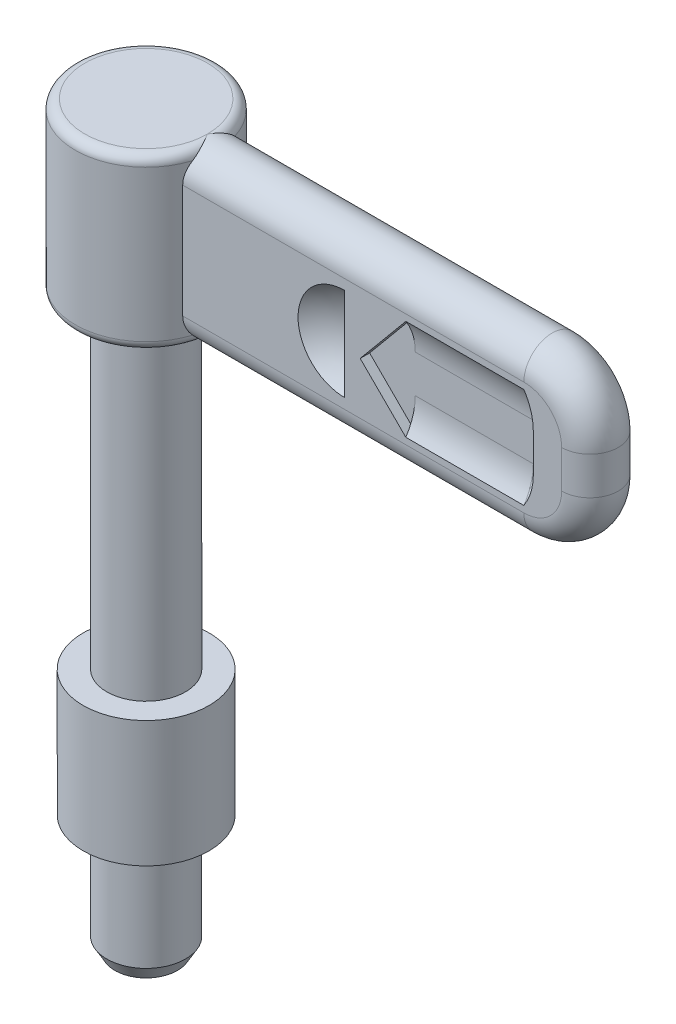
ISO-10303-21;
HEADER;
FILE_DESCRIPTION(('STEP AP214'),'2;1');
FILE_NAME('part.step','',(''),(''),'','','');
FILE_SCHEMA(('AUTOMOTIVE_DESIGN { 1 0 10303 214 1 1 1 1 }'));
ENDSEC;
DATA;
#1=APPLICATION_CONTEXT('core data for automotive mechanical design processes');
#2=APPLICATION_PROTOCOL_DEFINITION('international standard','automotive_design',2000,#1);
#3=PRODUCT_CONTEXT('',#1,'mechanical');
#4=PRODUCT('Part','Part','',(#3));
#5=PRODUCT_RELATED_PRODUCT_CATEGORY('part','',(#4));
#6=PRODUCT_DEFINITION_FORMATION('','',#4);
#7=PRODUCT_DEFINITION_CONTEXT('part definition',#1,'design');
#8=PRODUCT_DEFINITION('design','',#6,#7);
#9=PRODUCT_DEFINITION_SHAPE('','',#8);
#10=(LENGTH_UNIT() NAMED_UNIT(*) SI_UNIT(.MILLI.,.METRE.));
#11=(NAMED_UNIT(*) PLANE_ANGLE_UNIT() SI_UNIT($,.RADIAN.));
#12=(NAMED_UNIT(*) SI_UNIT($,.STERADIAN.) SOLID_ANGLE_UNIT());
#13=UNCERTAINTY_MEASURE_WITH_UNIT(LENGTH_MEASURE(1.E-05),#10,'distance_accuracy_value','');
#14=(GEOMETRIC_REPRESENTATION_CONTEXT(3) GLOBAL_UNCERTAINTY_ASSIGNED_CONTEXT((#13)) GLOBAL_UNIT_ASSIGNED_CONTEXT((#10,
#11,#12)) REPRESENTATION_CONTEXT('',''));
#15=CARTESIAN_POINT('',(0.,0.,0.));
#16=DIRECTION('',(0.,0.,1.));
#17=DIRECTION('',(1.,0.,0.));
#18=AXIS2_PLACEMENT_3D('',#15,#16,#17);
#19=CARTESIAN_POINT('',(-3.8267949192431,8.,3.8267949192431));
#20=DIRECTION('',(0.,1.,0.));
#21=DIRECTION('',(1.,0.,0.));
#22=AXIS2_PLACEMENT_3D('',#19,#20,#21);
#23=PLANE('',#22);
#24=CARTESIAN_POINT('',(0.,8.,0.));
#25=DIRECTION('',(0.,-1.,0.));
#26=DIRECTION('',(-1.42053902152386E-07,0.,1.));
#27=AXIS2_PLACEMENT_3D('',#24,#25,#26);
#28=CIRCLE('',#27,2.5);
#29=CARTESIAN_POINT('',(-3.55134755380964E-07,8.,2.5));
#30=VERTEX_POINT('',#29);
#31=EDGE_CURVE('E528',#30,#30,#28,.T.);
#32=ORIENTED_EDGE('',*,*,#31,.T.);
#33=EDGE_LOOP('',(#32));
#34=FACE_BOUND('',#33,.T.);
#35=CARTESIAN_POINT('',(0.,8.,0.));
#36=DIRECTION('',(0.,1.,0.));
#37=DIRECTION('',(0.,0.,1.));
#38=AXIS2_PLACEMENT_3D('',#35,#36,#37);
#39=CIRCLE('',#38,4.);
#40=CARTESIAN_POINT('',(0.,8.,4.));
#41=VERTEX_POINT('',#40);
#42=EDGE_CURVE('E22',#41,#41,#39,.T.);
#43=ORIENTED_EDGE('',*,*,#42,.T.);
#44=EDGE_LOOP('',(#43));
#45=FACE_BOUND('',#44,.T.);
#46=ADVANCED_FACE('F14',(#34,#45),#23,.T.);
#47=CARTESIAN_POINT('',(0.,-8.,0.));
#48=DIRECTION('',(0.,-1.,0.));
#49=DIRECTION('',(0.,0.,1.));
#50=AXIS2_PLACEMENT_3D('',#47,#48,#49);
#51=CYLINDRICAL_SURFACE('',#50,2.5);
#52=CARTESIAN_POINT('',(0.,28.6,0.));
#53=DIRECTION('',(0.,-1.,0.));
#54=DIRECTION('',(0.,0.,-1.));
#55=AXIS2_PLACEMENT_3D('',#52,#53,#54);
#56=CIRCLE('',#55,2.5);
#57=CARTESIAN_POINT('',(0.,28.6,-2.5));
#58=VERTEX_POINT('',#57);
#59=EDGE_CURVE('E9',#58,#58,#56,.F.);
#60=ORIENTED_EDGE('',*,*,#59,.F.);
#61=EDGE_LOOP('',(#60));
#62=FACE_BOUND('',#61,.T.);
#63=ORIENTED_EDGE('',*,*,#31,.F.);
#64=EDGE_LOOP('',(#63));
#65=FACE_BOUND('',#64,.T.);
#66=ADVANCED_FACE('F1039',(#62,#65),#51,.T.);
#67=CARTESIAN_POINT('',(0.,-8.,0.));
#68=DIRECTION('',(0.,-1.,0.));
#69=DIRECTION('',(1.92328497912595E-10,0.,1.));
#70=AXIS2_PLACEMENT_3D('',#67,#68,#69);
#71=CYLINDRICAL_SURFACE('',#70,4.);
#72=ORIENTED_EDGE('',*,*,#42,.F.);
#73=EDGE_LOOP('',(#72));
#74=FACE_BOUND('',#73,.T.);
#75=CARTESIAN_POINT('',(0.,0.,0.));
#76=DIRECTION('',(0.,-1.,0.));
#77=DIRECTION('',(0.,0.,-1.));
#78=AXIS2_PLACEMENT_3D('',#75,#76,#77);
#79=CIRCLE('',#78,4.);
#80=CARTESIAN_POINT('',(0.,0.,-4.));
#81=VERTEX_POINT('',#80);
#82=EDGE_CURVE('E521',#81,#81,#79,.F.);
#83=ORIENTED_EDGE('',*,*,#82,.T.);
#84=EDGE_LOOP('',(#83));
#85=FACE_BOUND('',#84,.T.);
#86=ADVANCED_FACE('F1036',(#74,#85),#71,.T.);
#87=CARTESIAN_POINT('',(-2.91867224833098E-13,-2.99999999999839,0.));
#88=DIRECTION('',(0.,-1.,0.));
#89=DIRECTION('',(-1.,0.,0.));
#90=AXIS2_PLACEMENT_3D('',#87,#88,#89);
#91=SPHERICAL_SURFACE('',#90,5.00000000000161);
#92=CARTESIAN_POINT('',(0.,-7.58812253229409,0.));
#93=DIRECTION('',(0.,1.,0.));
#94=DIRECTION('',(-1.,0.,0.));
#95=AXIS2_PLACEMENT_3D('',#92,#93,#94);
#96=CIRCLE('',#95,1.98724221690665);
#97=CARTESIAN_POINT('',(-1.98724221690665,-7.58812253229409,0.));
#98=VERTEX_POINT('',#97);
#99=EDGE_CURVE('E517',#98,#98,#96,.F.);
#100=ORIENTED_EDGE('',*,*,#99,.T.);
#101=EDGE_LOOP('',(#100));
#102=FACE_BOUND('',#101,.T.);
#103=ADVANCED_FACE('F1021',(#102),#91,.T.);
#104=CARTESIAN_POINT('',(0.,-6.7,0.));
#105=DIRECTION('',(0.,1.,0.));
#106=DIRECTION('',(0.,0.,-1.));
#107=AXIS2_PLACEMENT_3D('',#104,#105,#106);
#108=CONICAL_SURFACE('',#107,2.5,0.523598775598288);
#109=ORIENTED_EDGE('',*,*,#99,.F.);
#110=EDGE_LOOP('',(#109));
#111=FACE_BOUND('',#110,.T.);
#112=CARTESIAN_POINT('',(0.,-6.7,0.));
#113=DIRECTION('',(0.,1.,0.));
#114=DIRECTION('',(0.,0.,-1.));
#115=AXIS2_PLACEMENT_3D('',#112,#113,#114);
#116=CIRCLE('',#115,2.5);
#117=CARTESIAN_POINT('',(0.,-6.7,-2.5));
#118=VERTEX_POINT('',#117);
#119=EDGE_CURVE('E1014',#118,#118,#116,.F.);
#120=ORIENTED_EDGE('',*,*,#119,.T.);
#121=EDGE_LOOP('',(#120));
#122=FACE_BOUND('',#121,.T.);
#123=ADVANCED_FACE('F1023',(#111,#122),#108,.T.);
#124=CARTESIAN_POINT('',(0.,-8.,0.));
#125=DIRECTION('',(0.,-1.,0.));
#126=DIRECTION('',(7.69370911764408E-10,0.,1.));
#127=AXIS2_PLACEMENT_3D('',#124,#125,#126);
#128=CYLINDRICAL_SURFACE('',#127,2.5);
#129=ORIENTED_EDGE('',*,*,#119,.F.);
#130=EDGE_LOOP('',(#129));
#131=FACE_BOUND('',#130,.T.);
#132=CARTESIAN_POINT('',(0.,-0.5,0.));
#133=DIRECTION('',(0.,1.,0.));
#134=DIRECTION('',(0.,0.,-1.));
#135=AXIS2_PLACEMENT_3D('',#132,#133,#134);
#136=CIRCLE('',#135,2.5);
#137=CARTESIAN_POINT('',(0.,-0.5,-2.5));
#138=VERTEX_POINT('',#137);
#139=EDGE_CURVE('E1012',#138,#138,#136,.F.);
#140=ORIENTED_EDGE('',*,*,#139,.T.);
#141=EDGE_LOOP('',(#140));
#142=FACE_BOUND('',#141,.T.);
#143=ADVANCED_FACE('F1025',(#131,#142),#128,.T.);
#144=CARTESIAN_POINT('',(0.,-0.5,0.));
#145=DIRECTION('',(0.,-1.,0.));
#146=DIRECTION('',(1.92345373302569E-10,0.,1.));
#147=AXIS2_PLACEMENT_3D('',#144,#145,#146);
#148=CONICAL_SURFACE('',#147,2.5,0.349065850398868);
#149=ORIENTED_EDGE('',*,*,#139,.F.);
#150=EDGE_LOOP('',(#149));
#151=FACE_BOUND('',#150,.T.);
#152=CARTESIAN_POINT('',(0.,-0.225252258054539,0.));
#153=DIRECTION('',(0.,1.,0.));
#154=DIRECTION('',(0.,0.,-1.));
#155=AXIS2_PLACEMENT_3D('',#152,#153,#154);
#156=CIRCLE('',#155,2.4);
#157=CARTESIAN_POINT('',(0.,-0.225252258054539,-2.4));
#158=VERTEX_POINT('',#157);
#159=EDGE_CURVE('E1004',#158,#158,#156,.F.);
#160=ORIENTED_EDGE('',*,*,#159,.T.);
#161=EDGE_LOOP('',(#160));
#162=FACE_BOUND('',#161,.T.);
#163=ADVANCED_FACE('F1033',(#151,#162),#148,.T.);
#164=CARTESIAN_POINT('',(0.,-8.,0.));
#165=DIRECTION('',(0.,-1.,0.));
#166=DIRECTION('',(1.92345373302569E-10,0.,1.));
#167=AXIS2_PLACEMENT_3D('',#164,#165,#166);
#168=CYLINDRICAL_SURFACE('',#167,2.4);
#169=ORIENTED_EDGE('',*,*,#159,.F.);
#170=EDGE_LOOP('',(#169));
#171=FACE_BOUND('',#170,.T.);
#172=CARTESIAN_POINT('',(0.,0.,0.));
#173=DIRECTION('',(0.,-1.,0.));
#174=DIRECTION('',(0.,0.,-1.));
#175=AXIS2_PLACEMENT_3D('',#172,#173,#174);
#176=CIRCLE('',#175,2.4);
#177=CARTESIAN_POINT('',(0.,0.,-2.4));
#178=VERTEX_POINT('',#177);
#179=EDGE_CURVE('E525',#178,#178,#176,.T.);
#180=ORIENTED_EDGE('',*,*,#179,.T.);
#181=EDGE_LOOP('',(#180));
#182=FACE_BOUND('',#181,.T.);
#183=ADVANCED_FACE('F1050',(#171,#182),#168,.T.);
#184=CARTESIAN_POINT('',(-3.8267949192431,0.,-3.8267949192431));
#185=DIRECTION('',(0.,-1.,0.));
#186=DIRECTION('',(1.,0.,0.));
#187=AXIS2_PLACEMENT_3D('',#184,#185,#186);
#188=PLANE('',#187);
#189=ORIENTED_EDGE('',*,*,#82,.F.);
#190=EDGE_LOOP('',(#189));
#191=FACE_BOUND('',#190,.T.);
#192=ORIENTED_EDGE('',*,*,#179,.F.);
#193=EDGE_LOOP('',(#192));
#194=FACE_BOUND('',#193,.T.);
#195=ADVANCED_FACE('F16',(#191,#194),#188,.T.);
#196=CARTESIAN_POINT('',(18.3,30.810025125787,-1.8));
#197=DIRECTION('',(-1.,0.,0.));
#198=DIRECTION('',(0.,0.,1.));
#199=AXIS2_PLACEMENT_3D('',#196,#197,#198);
#200=PLANE('',#199);
#201=CARTESIAN_POINT('',(18.3,32.8000000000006,-4.80000000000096));
#202=DIRECTION('',(1.,0.,0.));
#203=DIRECTION('',(0.,-1.51977196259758E-13,1.));
#204=AXIS2_PLACEMENT_3D('',#201,#202,#203);
#205=CIRCLE('',#204,3.60000000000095);
#206=CARTESIAN_POINT('',(18.3,32.8,-1.2));
#207=VERTEX_POINT('',#206);
#208=CARTESIAN_POINT('',(18.3,30.810025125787,-1.8));
#209=VERTEX_POINT('',#208);
#210=EDGE_CURVE('E826',#207,#209,#205,.T.);
#211=ORIENTED_EDGE('',*,*,#210,.T.);
#212=DIRECTION('',(0.,0.,-1.));
#213=VECTOR('',#212,1.);
#214=CARTESIAN_POINT('',(18.3,30.810025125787,-1.2));
#215=LINE('',#214,#213);
#216=CARTESIAN_POINT('',(18.3,30.810025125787,-1.2));
#217=VERTEX_POINT('',#216);
#218=EDGE_CURVE('E821',#217,#209,#215,.T.);
#219=ORIENTED_EDGE('',*,*,#218,.F.);
#220=DIRECTION('',(0.,1.,0.));
#221=VECTOR('',#220,1.);
#222=CARTESIAN_POINT('',(18.3,30.810025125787,-1.2));
#223=LINE('',#222,#221);
#224=EDGE_CURVE('E193',#217,#207,#223,.T.);
#225=ORIENTED_EDGE('',*,*,#224,.T.);
#226=EDGE_LOOP('',(#211,#219,#225));
#227=FACE_BOUND('',#226,.T.);
#228=ADVANCED_FACE('F1058',(#227),#200,.T.);
#229=CARTESIAN_POINT('',(18.3,35.2,-1.8));
#230=DIRECTION('',(-1.,0.,0.));
#231=DIRECTION('',(0.,0.,1.));
#232=AXIS2_PLACEMENT_3D('',#229,#230,#231);
#233=PLANE('',#232);
#234=CARTESIAN_POINT('',(18.3,35.1999999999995,-4.80000000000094));
#235=DIRECTION('',(1.,0.,0.));
#236=DIRECTION('',(0.,0.552770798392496,0.83333333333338));
#237=AXIS2_PLACEMENT_3D('',#234,#235,#236);
#238=CIRCLE('',#237,3.60000000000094);
#239=CARTESIAN_POINT('',(18.3,37.189974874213,-1.8));
#240=VERTEX_POINT('',#239);
#241=CARTESIAN_POINT('',(18.3,35.2,-1.2));
#242=VERTEX_POINT('',#241);
#243=EDGE_CURVE('E188',#240,#242,#238,.T.);
#244=ORIENTED_EDGE('',*,*,#243,.T.);
#245=DIRECTION('',(0.,1.,0.));
#246=VECTOR('',#245,1.);
#247=CARTESIAN_POINT('',(18.3,35.2,-1.2));
#248=LINE('',#247,#246);
#249=CARTESIAN_POINT('',(18.3,37.189974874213,-1.2));
#250=VERTEX_POINT('',#249);
#251=EDGE_CURVE('E199',#242,#250,#248,.T.);
#252=ORIENTED_EDGE('',*,*,#251,.T.);
#253=DIRECTION('',(0.,0.,-1.));
#254=VECTOR('',#253,1.);
#255=CARTESIAN_POINT('',(18.3,37.189974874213,-1.2));
#256=LINE('',#255,#254);
#257=EDGE_CURVE('E201',#250,#240,#256,.T.);
#258=ORIENTED_EDGE('',*,*,#257,.T.);
#259=EDGE_LOOP('',(#244,#252,#258));
#260=FACE_BOUND('',#259,.T.);
#261=ADVANCED_FACE('F198',(#260),#233,.T.);
#262=CARTESIAN_POINT('',(15.4,30.810025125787,-1.2));
#263=DIRECTION('',(0.,0.,-1.));
#264=DIRECTION('',(0.,1.,0.));
#265=AXIS2_PLACEMENT_3D('',#262,#263,#264);
#266=PLANE('',#265);
#267=DIRECTION('',(-0.639102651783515,-0.769121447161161,0.));
#268=VECTOR('',#267,1.);
#269=CARTESIAN_POINT('',(18.3,37.189974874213,-1.2));
#270=LINE('',#269,#268);
#271=CARTESIAN_POINT('',(15.4,33.7,-1.2));
#272=VERTEX_POINT('',#271);
#273=EDGE_CURVE('E205',#250,#272,#270,.T.);
#274=ORIENTED_EDGE('',*,*,#273,.F.);
#275=ORIENTED_EDGE('',*,*,#251,.F.);
#276=DIRECTION('',(1.,0.,0.));
#277=VECTOR('',#276,1.);
#278=CARTESIAN_POINT('',(18.3,35.2,-1.2));
#279=LINE('',#278,#277);
#280=CARTESIAN_POINT('',(25.8,35.2,-1.2));
#281=VERTEX_POINT('',#280);
#282=EDGE_CURVE('E185',#242,#281,#279,.T.);
#283=ORIENTED_EDGE('',*,*,#282,.T.);
#284=DIRECTION('',(0.,-1.,0.));
#285=VECTOR('',#284,1.);
#286=CARTESIAN_POINT('',(25.8,35.2,-1.2));
#287=LINE('',#286,#285);
#288=CARTESIAN_POINT('',(25.8,32.8,-1.2));
#289=VERTEX_POINT('',#288);
#290=EDGE_CURVE('E192',#289,#281,#287,.F.);
#291=ORIENTED_EDGE('',*,*,#290,.F.);
#292=DIRECTION('',(-1.,0.,0.));
#293=VECTOR('',#292,1.);
#294=CARTESIAN_POINT('',(25.8,32.8,-1.2));
#295=LINE('',#294,#293);
#296=EDGE_CURVE('E840',#207,#289,#295,.F.);
#297=ORIENTED_EDGE('',*,*,#296,.F.);
#298=ORIENTED_EDGE('',*,*,#224,.F.);
#299=DIRECTION('',(0.708330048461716,-0.705881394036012,0.));
#300=VECTOR('',#299,1.);
#301=CARTESIAN_POINT('',(15.4,33.7,-1.2));
#302=LINE('',#301,#300);
#303=EDGE_CURVE('E816',#272,#217,#302,.T.);
#304=ORIENTED_EDGE('',*,*,#303,.F.);
#305=EDGE_LOOP('',(#274,#275,#283,#291,#297,#298,#304));
#306=FACE_BOUND('',#305,.T.);
#307=ADVANCED_FACE('F203',(#306),#266,.T.);
#308=CARTESIAN_POINT('',(18.3,30.810025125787,1.8));
#309=DIRECTION('',(-1.,0.,0.));
#310=DIRECTION('',(0.,1.,0.));
#311=AXIS2_PLACEMENT_3D('',#308,#309,#310);
#312=PLANE('',#311);
#313=DIRECTION('',(0.,1.,0.));
#314=VECTOR('',#313,1.);
#315=CARTESIAN_POINT('',(18.3,30.810025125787,1.2));
#316=LINE('',#315,#314);
#317=CARTESIAN_POINT('',(18.3,30.810025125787,1.2));
#318=VERTEX_POINT('',#317);
#319=CARTESIAN_POINT('',(18.3,32.8,1.2));
#320=VERTEX_POINT('',#319);
#321=EDGE_CURVE('E695',#318,#320,#316,.T.);
#322=ORIENTED_EDGE('',*,*,#321,.F.);
#323=DIRECTION('',(0.,0.,1.));
#324=VECTOR('',#323,1.);
#325=CARTESIAN_POINT('',(18.3,30.810025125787,1.2));
#326=LINE('',#325,#324);
#327=CARTESIAN_POINT('',(18.3,30.810025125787,1.8));
#328=VERTEX_POINT('',#327);
#329=EDGE_CURVE('E799',#318,#328,#326,.T.);
#330=ORIENTED_EDGE('',*,*,#329,.T.);
#331=CARTESIAN_POINT('',(18.3,32.8000000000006,4.80000000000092));
#332=DIRECTION('',(-1.,0.,0.));
#333=DIRECTION('',(0.,0.,-1.));
#334=AXIS2_PLACEMENT_3D('',#331,#332,#333);
#335=CIRCLE('',#334,3.60000000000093);
#336=EDGE_CURVE('E670',#328,#320,#335,.F.);
#337=ORIENTED_EDGE('',*,*,#336,.T.);
#338=EDGE_LOOP('',(#322,#330,#337));
#339=FACE_BOUND('',#338,.T.);
#340=ADVANCED_FACE('F1158',(#339),#312,.T.);
#341=CARTESIAN_POINT('',(18.3,35.1999999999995,1.8));
#342=DIRECTION('',(-1.,0.,0.));
#343=DIRECTION('',(0.,1.,0.));
#344=AXIS2_PLACEMENT_3D('',#341,#342,#343);
#345=PLANE('',#344);
#346=DIRECTION('',(0.,0.,-1.));
#347=VECTOR('',#346,1.);
#348=CARTESIAN_POINT('',(18.3,37.189974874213,1.8));
#349=LINE('',#348,#347);
#350=CARTESIAN_POINT('',(18.3,37.189974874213,1.2));
#351=VERTEX_POINT('',#350);
#352=CARTESIAN_POINT('',(18.3,37.189974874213,1.8));
#353=VERTEX_POINT('',#352);
#354=EDGE_CURVE('E792',#351,#353,#349,.F.);
#355=ORIENTED_EDGE('',*,*,#354,.F.);
#356=DIRECTION('',(0.,1.,0.));
#357=VECTOR('',#356,1.);
#358=CARTESIAN_POINT('',(18.3,35.1999999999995,1.2));
#359=LINE('',#358,#357);
#360=CARTESIAN_POINT('',(18.3,35.1999999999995,1.2));
#361=VERTEX_POINT('',#360);
#362=EDGE_CURVE('E680',#361,#351,#359,.T.);
#363=ORIENTED_EDGE('',*,*,#362,.F.);
#364=CARTESIAN_POINT('',(18.3,35.1999999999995,4.80000000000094));
#365=DIRECTION('',(-1.,0.,0.));
#366=DIRECTION('',(0.,0.552770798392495,-0.833333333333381));
#367=AXIS2_PLACEMENT_3D('',#364,#365,#366);
#368=CIRCLE('',#367,3.60000000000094);
#369=EDGE_CURVE('E634',#361,#353,#368,.F.);
#370=ORIENTED_EDGE('',*,*,#369,.T.);
#371=EDGE_LOOP('',(#355,#363,#370));
#372=FACE_BOUND('',#371,.T.);
#373=ADVANCED_FACE('F778',(#372),#345,.T.);
#374=CARTESIAN_POINT('',(25.8,30.810025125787,1.2));
#375=DIRECTION('',(0.,0.,1.));
#376=DIRECTION('',(0.,1.,0.));
#377=AXIS2_PLACEMENT_3D('',#374,#375,#376);
#378=PLANE('',#377);
#379=DIRECTION('',(0.,1.,0.));
#380=VECTOR('',#379,1.);
#381=CARTESIAN_POINT('',(25.8,32.8000000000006,1.2));
#382=LINE('',#381,#380);
#383=CARTESIAN_POINT('',(25.8,32.8000000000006,1.2));
#384=VERTEX_POINT('',#383);
#385=CARTESIAN_POINT('',(25.8,35.2,1.2));
#386=VERTEX_POINT('',#385);
#387=EDGE_CURVE('E675',#384,#386,#382,.T.);
#388=ORIENTED_EDGE('',*,*,#387,.T.);
#389=DIRECTION('',(1.,0.,0.));
#390=VECTOR('',#389,1.);
#391=CARTESIAN_POINT('',(18.3,35.1999999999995,1.2));
#392=LINE('',#391,#390);
#393=EDGE_CURVE('E1426',#361,#386,#392,.T.);
#394=ORIENTED_EDGE('',*,*,#393,.F.);
#395=ORIENTED_EDGE('',*,*,#362,.T.);
#396=DIRECTION('',(-0.639102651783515,-0.769121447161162,0.));
#397=VECTOR('',#396,1.);
#398=CARTESIAN_POINT('',(18.3,37.189974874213,1.2));
#399=LINE('',#398,#397);
#400=CARTESIAN_POINT('',(15.4,33.7,1.2));
#401=VERTEX_POINT('',#400);
#402=EDGE_CURVE('E685',#351,#401,#399,.T.);
#403=ORIENTED_EDGE('',*,*,#402,.T.);
#404=DIRECTION('',(0.708330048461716,-0.705881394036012,0.));
#405=VECTOR('',#404,1.);
#406=CARTESIAN_POINT('',(15.4,33.7,1.2));
#407=LINE('',#406,#405);
#408=EDGE_CURVE('E690',#401,#318,#407,.T.);
#409=ORIENTED_EDGE('',*,*,#408,.T.);
#410=ORIENTED_EDGE('',*,*,#321,.T.);
#411=DIRECTION('',(-1.,0.,0.));
#412=VECTOR('',#411,1.);
#413=CARTESIAN_POINT('',(25.8,32.8000000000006,1.2));
#414=LINE('',#413,#412);
#415=EDGE_CURVE('E662',#320,#384,#414,.F.);
#416=ORIENTED_EDGE('',*,*,#415,.T.);
#417=EDGE_LOOP('',(#388,#394,#395,#403,#409,#410,#416));
#418=FACE_BOUND('',#417,.T.);
#419=ADVANCED_FACE('F653',(#418),#378,.T.);
#420=CARTESIAN_POINT('',(-3.89996660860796,39.4,3.92955044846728));
#421=DIRECTION('',(0.,1.,0.));
#422=DIRECTION('',(1.,0.,0.));
#423=AXIS2_PLACEMENT_3D('',#420,#421,#422);
#424=PLANE('',#423);
#425=CARTESIAN_POINT('',(0.,39.4,0.));
#426=DIRECTION('',(0.,1.,0.));
#427=DIRECTION('',(-0.707106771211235,0.,0.70710679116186));
#428=AXIS2_PLACEMENT_3D('',#425,#426,#427);
#429=CIRCLE('',#428,3.90007497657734);
#430=CARTESIAN_POINT('',(3.90007497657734,39.4,0.));
#431=VERTEX_POINT('',#430);
#432=EDGE_CURVE('E504',#431,#431,#429,.F.);
#433=ORIENTED_EDGE('',*,*,#432,.F.);
#434=EDGE_LOOP('',(#433));
#435=FACE_BOUND('',#434,.T.);
#436=ADVANCED_FACE('F479',(#435),#424,.T.);
#437=CARTESIAN_POINT('',(14.4,34.,-5.2));
#438=DIRECTION('',(0.,1.,0.));
#439=DIRECTION('',(-0.682916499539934,0.,0.730496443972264));
#440=AXIS2_PLACEMENT_3D('',#437,#438,#439);
#441=SPHERICAL_SURFACE('',#440,4.5);
#442=CARTESIAN_POINT('',(14.4,36.9478805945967,-1.8));
#443=CARTESIAN_POINT('',(14.4,36.8972853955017,-1.75613134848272));
#444=CARTESIAN_POINT('',(14.4,36.8457096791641,-1.71339372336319));
#445=CARTESIAN_POINT('',(14.4,36.7407029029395,-1.63026200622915));
#446=CARTESIAN_POINT('',(14.4,36.6872718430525,-1.58986791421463));
#447=CARTESIAN_POINT('',(14.4,36.5786600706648,-1.51150474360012));
#448=CARTESIAN_POINT('',(14.4,36.523479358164,-1.47353566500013));
#449=CARTESIAN_POINT('',(14.4,36.4114784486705,-1.40009791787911));
#450=CARTESIAN_POINT('',(14.4,36.3546582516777,-1.36462924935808));
#451=CARTESIAN_POINT('',(14.4,36.2394915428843,-1.29626307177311));
#452=CARTESIAN_POINT('',(14.4,36.1811450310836,-1.26336556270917));
#453=CARTESIAN_POINT('',(14.4,36.0630419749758,-1.20020724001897));
#454=CARTESIAN_POINT('',(14.4,36.0032854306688,-1.16994642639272));
#455=CARTESIAN_POINT('',(14.4,35.8824813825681,-1.11212180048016));
#456=CARTESIAN_POINT('',(14.4,35.8214338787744,-1.08455798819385));
#457=CARTESIAN_POINT('',(14.4,35.6981695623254,-1.03218229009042));
#458=CARTESIAN_POINT('',(14.4,35.6359527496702,-1.00737040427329));
#459=CARTESIAN_POINT('',(14.4,35.5104737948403,-0.960548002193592));
#460=CARTESIAN_POINT('',(14.4,35.4472116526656,-0.938537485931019));
#461=CARTESIAN_POINT('',(14.4,35.3197681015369,-0.897361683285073));
#462=CARTESIAN_POINT('',(14.4,35.2555866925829,-0.878196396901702));
#463=CARTESIAN_POINT('',(14.4,35.126432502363,-0.842749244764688));
#464=CARTESIAN_POINT('',(14.4,35.0614597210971,-0.826467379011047));
#465=CARTESIAN_POINT('',(14.4,34.9308522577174,-0.79681951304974));
#466=CARTESIAN_POINT('',(14.4,34.8652175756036,-0.783453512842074));
#467=CARTESIAN_POINT('',(14.4,34.7334171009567,-0.759664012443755));
#468=CARTESIAN_POINT('',(14.4,34.6672513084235,-0.749240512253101));
#469=CARTESIAN_POINT('',(14.4,34.5345204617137,-0.731356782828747));
#470=CARTESIAN_POINT('',(14.4,34.4679554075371,-0.723896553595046));
#471=CARTESIAN_POINT('',(14.4,34.3345586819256,-0.711954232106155));
#472=CARTESIAN_POINT('',(14.4,34.2677270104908,-0.707472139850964));
#473=CARTESIAN_POINT('',(14.4,34.1339302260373,-0.701495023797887));
#474=CARTESIAN_POINT('',(14.4,34.0669651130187,-0.7));
#475=CARTESIAN_POINT('',(14.4,33.9330348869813,-0.7));
#476=CARTESIAN_POINT('',(14.4,33.8660697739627,-0.701495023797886));
#477=CARTESIAN_POINT('',(14.4,33.7322729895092,-0.707472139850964));
#478=CARTESIAN_POINT('',(14.4,33.6654413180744,-0.711954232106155));
#479=CARTESIAN_POINT('',(14.4,33.5320445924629,-0.723896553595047));
#480=CARTESIAN_POINT('',(14.4,33.4654795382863,-0.731356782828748));
#481=CARTESIAN_POINT('',(14.4,33.3327486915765,-0.749240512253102));
#482=CARTESIAN_POINT('',(14.4,33.2665828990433,-0.759664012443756));
#483=CARTESIAN_POINT('',(14.4,33.1347824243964,-0.783453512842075));
#484=CARTESIAN_POINT('',(14.4,33.0691477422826,-0.796819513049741));
#485=CARTESIAN_POINT('',(14.4,32.9385402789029,-0.826467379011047));
#486=CARTESIAN_POINT('',(14.4,32.873567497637,-0.842749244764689));
#487=CARTESIAN_POINT('',(14.4,32.7444133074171,-0.878196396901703));
#488=CARTESIAN_POINT('',(14.4,32.6802318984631,-0.897361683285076));
#489=CARTESIAN_POINT('',(14.4,32.5527883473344,-0.938537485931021));
#490=CARTESIAN_POINT('',(14.4,32.4895262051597,-0.960548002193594));
#491=CARTESIAN_POINT('',(14.4,32.3640472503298,-1.00737040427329));
#492=CARTESIAN_POINT('',(14.4,32.3018304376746,-1.03218229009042));
#493=CARTESIAN_POINT('',(14.4,32.1785661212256,-1.08455798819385));
#494=CARTESIAN_POINT('',(14.4,32.1175186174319,-1.11212180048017));
#495=CARTESIAN_POINT('',(14.4,31.9967145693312,-1.16994642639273));
#496=CARTESIAN_POINT('',(14.4,31.9369580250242,-1.20020724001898));
#497=CARTESIAN_POINT('',(14.4,31.8188549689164,-1.26336556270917));
#498=CARTESIAN_POINT('',(14.4,31.7605084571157,-1.29626307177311));
#499=CARTESIAN_POINT('',(14.4,31.6453417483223,-1.36462924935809));
#500=CARTESIAN_POINT('',(14.4,31.5885215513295,-1.40009791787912));
#501=CARTESIAN_POINT('',(14.4,31.476520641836,-1.47353566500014));
#502=CARTESIAN_POINT('',(14.4,31.4213399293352,-1.51150474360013));
#503=CARTESIAN_POINT('',(14.4,31.3127281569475,-1.58986791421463));
#504=CARTESIAN_POINT('',(14.4,31.2592970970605,-1.63026200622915));
#505=CARTESIAN_POINT('',(14.4,31.1542903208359,-1.7133937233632));
#506=CARTESIAN_POINT('',(14.4,31.1027146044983,-1.75613134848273));
#507=CARTESIAN_POINT('',(14.4,31.0521194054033,-1.80000000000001));
#508=B_SPLINE_CURVE_WITH_KNOTS('',3,(#442,#443,#444,#445,#446,#447,#448,#449,#450,#451,#452,
#453,#454,#455,#456,#457,#458,#459,#460,#461,#462,#463,#464,#465,#466,#467,#468,#469,#470,#471,
#472,#473,#474,#475,#476,#477,#478,#479,#480,#481,#482,#483,#484,#485,#486,#487,#488,#489,#490,
#491,#492,#493,#494,#495,#496,#497,#498,#499,#500,#501,#502,#503,#504,#505,#506,#507),
.UNSPECIFIED.,.F.,.F.,(4,2,2,2,2,2,2,2,2,2,2,2,2,2,2,2,2,2,2,2,2,2,2,2,2,2,2,2,2,2,2,2,4),(0.,
0.200878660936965,0.401757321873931,0.602635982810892,0.803514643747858,1.00439330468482,
1.20527196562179,1.40615062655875,1.60702928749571,1.80790794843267,2.00878660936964,
2.20966527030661,2.41054393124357,2.61142259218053,2.8123012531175,3.01317991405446,
3.21405857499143,3.4149372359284,3.61581589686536,3.81669455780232,4.01757321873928,
4.21845187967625,4.41933054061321,4.62020920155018,4.82108786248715,5.02196652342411,
5.22284518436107,5.42372384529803,5.624602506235,5.82548116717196,6.02635982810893,
6.22723848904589,6.42811714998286),.UNSPECIFIED.);
#509=CARTESIAN_POINT('',(14.4,36.9478805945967,-1.8));
#510=VERTEX_POINT('',#509);
#511=CARTESIAN_POINT('',(14.4,31.0521194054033,-1.8));
#512=VERTEX_POINT('',#511);
#513=EDGE_CURVE('E532',#510,#512,#508,.T.);
#514=ORIENTED_EDGE('',*,*,#513,.T.);
#515=CARTESIAN_POINT('',(14.4,36.9478805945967,-1.8));
#516=CARTESIAN_POINT('',(14.2398904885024,36.9478805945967,-1.8));
#517=CARTESIAN_POINT('',(14.0846401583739,36.9355003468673,-1.8));
#518=CARTESIAN_POINT('',(13.7820381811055,36.8872170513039,-1.8));
#519=CARTESIAN_POINT('',(13.6346865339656,36.8513140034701,-1.8));
#520=CARTESIAN_POINT('',(13.1585202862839,36.6960843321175,-1.8));
#521=CARTESIAN_POINT('',(12.879750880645,36.5446981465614,-1.8));
#522=CARTESIAN_POINT('',(12.3261882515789,36.1307866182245,-1.8));
#523=CARTESIAN_POINT('',(12.0616323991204,35.836506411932,-1.8));
#524=CARTESIAN_POINT('',(11.17567755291,34.3452001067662,-1.8));
#525=CARTESIAN_POINT('',(11.3625860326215,32.8684812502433,-1.8));
#526=CARTESIAN_POINT('',(12.5316546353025,31.6994126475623,-1.8));
#527=CARTESIAN_POINT('',(12.7765109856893,31.5175928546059,-1.8));
#528=CARTESIAN_POINT('',(13.2599373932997,31.272763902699,-1.8));
#529=CARTESIAN_POINT('',(13.4705186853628,31.1928165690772,-1.8));
#530=CARTESIAN_POINT('',(13.9228638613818,31.0806441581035,-1.8));
#531=CARTESIAN_POINT('',(14.1585949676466,31.0521194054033,-1.8));
#532=CARTESIAN_POINT('',(14.4,31.0521194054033,-1.8));
#533=B_SPLINE_CURVE_WITH_KNOTS('',3,(#515,#516,#517,#518,#519,#520,#521,#522,#523,#524,#525,
#526,#527,#528,#529,#530,#531,#532),.UNSPECIFIED.,.F.,.F.,(4,2,2,2,2,2,2,2,4),(0.,
0.0429619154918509,0.0859238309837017,0.184717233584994,0.310914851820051,0.758114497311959,
0.859535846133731,0.928561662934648,1.),.UNSPECIFIED.);
#534=EDGE_CURVE('E289',#510,#512,#533,.T.);
#535=ORIENTED_EDGE('',*,*,#534,.F.);
#536=EDGE_LOOP('',(#514,#535));
#537=FACE_BOUND('',#536,.T.);
#538=ADVANCED_FACE('F592',(#537),#441,.F.);
#539=CARTESIAN_POINT('',(14.4,31.0521194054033,-0.697595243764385));
#540=DIRECTION('',(-1.,0.,0.));
#541=DIRECTION('',(0.,1.,0.));
#542=AXIS2_PLACEMENT_3D('',#539,#540,#541);
#543=PLANE('',#542);
#544=ORIENTED_EDGE('',*,*,#513,.F.);
#545=DIRECTION('',(0.,1.,0.));
#546=VECTOR('',#545,1.);
#547=CARTESIAN_POINT('',(14.4,31.0521194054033,-1.8));
#548=LINE('',#547,#546);
#549=EDGE_CURVE('E1471',#512,#510,#548,.T.);
#550=ORIENTED_EDGE('',*,*,#549,.F.);
#551=EDGE_LOOP('',(#544,#550));
#552=FACE_BOUND('',#551,.T.);
#553=ADVANCED_FACE('F601',(#552),#543,.T.);
#554=CARTESIAN_POINT('',(25.8,37.189974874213,-1.8));
#555=DIRECTION('',(0.,1.,0.));
#556=DIRECTION('',(0.,0.,1.));
#557=AXIS2_PLACEMENT_3D('',#554,#555,#556);
#558=CYLINDRICAL_SURFACE('',#557,0.6);
#559=CARTESIAN_POINT('',(26.4,35.1999999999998,-1.8));
#560=CARTESIAN_POINT('',(26.400000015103,35.1999999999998,-1.79017706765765));
#561=CARTESIAN_POINT('',(26.3997542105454,35.1999999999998,-1.78035435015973));
#562=CARTESIAN_POINT('',(26.3987755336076,35.1999999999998,-1.76072482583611));
#563=CARTESIAN_POINT('',(26.3980422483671,35.1999999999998,-1.75091803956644));
#564=CARTESIAN_POINT('',(26.3960927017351,35.1999999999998,-1.73134761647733));
#565=CARTESIAN_POINT('',(26.3948761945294,35.1999999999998,-1.72158400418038));
#566=CARTESIAN_POINT('',(26.3919651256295,35.1999999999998,-1.70212624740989));
#567=CARTESIAN_POINT('',(26.3902704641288,35.1999999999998,-1.69243211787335));
#568=CARTESIAN_POINT('',(26.3864088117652,35.1999999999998,-1.67313891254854));
#569=CARTESIAN_POINT('',(26.3842418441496,35.1999999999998,-1.66353983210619));
#570=CARTESIAN_POINT('',(26.3794421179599,35.1999999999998,-1.64446152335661));
#571=CARTESIAN_POINT('',(26.37680948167,35.1999999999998,-1.63498226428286));
#572=CARTESIAN_POINT('',(26.371085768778,35.1999999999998,-1.61616761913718));
#573=CARTESIAN_POINT('',(26.3679948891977,35.1999999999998,-1.60683217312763));
#574=CARTESIAN_POINT('',(26.361362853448,35.1999999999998,-1.58832839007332));
#575=CARTESIAN_POINT('',(26.3578219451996,35.1999999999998,-1.57915996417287));
#576=CARTESIAN_POINT('',(26.3502988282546,35.1999999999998,-1.56101266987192));
#577=CARTESIAN_POINT('',(26.3463168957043,35.1999999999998,-1.55203368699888));
#578=CARTESIAN_POINT('',(26.3379215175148,35.1999999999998,-1.53428693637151));
#579=CARTESIAN_POINT('',(26.33350835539,35.1999999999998,-1.52551903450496));
#580=CARTESIAN_POINT('',(26.3242611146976,35.1999999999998,-1.50821530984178));
#581=CARTESIAN_POINT('',(26.3194273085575,35.1999999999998,-1.49967934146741));
#582=CARTESIAN_POINT('',(26.3093501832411,35.1999999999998,-1.4828595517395));
#583=CARTESIAN_POINT('',(26.3041071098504,35.1999999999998,-1.47457558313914));
#584=CARTESIAN_POINT('',(26.2932236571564,35.1999999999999,-1.45827906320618));
#585=CARTESIAN_POINT('',(26.287583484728,35.1999999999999,-1.45026637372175));
#586=CARTESIAN_POINT('',(26.2759188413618,35.1999999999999,-1.4345308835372));
#587=CARTESIAN_POINT('',(26.2698945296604,35.1999999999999,-1.42680796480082));
#588=CARTESIAN_POINT('',(26.2574754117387,35.1999999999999,-1.41166968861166));
#589=CARTESIAN_POINT('',(26.2510807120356,35.1999999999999,-1.40425424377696));
#590=CARTESIAN_POINT('',(26.237935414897,35.1999999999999,-1.3897477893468));
#591=CARTESIAN_POINT('',(26.2311848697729,35.1999999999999,-1.38265673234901));
#592=CARTESIAN_POINT('',(26.217343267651,35.1999999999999,-1.36881513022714));
#593=CARTESIAN_POINT('',(26.2102522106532,35.1999999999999,-1.36206458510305));
#594=CARTESIAN_POINT('',(26.195745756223,35.1999999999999,-1.34891928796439));
#595=CARTESIAN_POINT('',(26.1883303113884,35.1999999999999,-1.34252458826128));
#596=CARTESIAN_POINT('',(26.1731920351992,35.1999999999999,-1.3301054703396));
#597=CARTESIAN_POINT('',(26.1654691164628,35.1999999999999,-1.32408115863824));
#598=CARTESIAN_POINT('',(26.1497336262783,35.1999999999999,-1.31241651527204));
#599=CARTESIAN_POINT('',(26.1417209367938,35.1999999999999,-1.30677634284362));
#600=CARTESIAN_POINT('',(26.1254244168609,35.1999999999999,-1.29589289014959));
#601=CARTESIAN_POINT('',(26.1171404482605,35.1999999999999,-1.2906498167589));
#602=CARTESIAN_POINT('',(26.1003206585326,35.1999999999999,-1.28057269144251));
#603=CARTESIAN_POINT('',(26.0917846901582,35.1999999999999,-1.27573888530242));
#604=CARTESIAN_POINT('',(26.074480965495,35.1999999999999,-1.26649164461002));
#605=CARTESIAN_POINT('',(26.0657130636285,35.1999999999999,-1.26207848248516));
#606=CARTESIAN_POINT('',(26.0479663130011,35.1999999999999,-1.25368310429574));
#607=CARTESIAN_POINT('',(26.0389873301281,35.1999999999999,-1.2497011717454));
#608=CARTESIAN_POINT('',(26.0208400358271,35.1999999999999,-1.24217805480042));
#609=CARTESIAN_POINT('',(26.0116716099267,35.1999999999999,-1.23863714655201));
#610=CARTESIAN_POINT('',(25.9931678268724,35.2,-1.23200511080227));
#611=CARTESIAN_POINT('',(25.9838323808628,35.2,-1.22891423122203));
#612=CARTESIAN_POINT('',(25.9650177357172,35.2,-1.22319051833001));
#613=CARTESIAN_POINT('',(25.9555384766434,35.2,-1.22055788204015));
#614=CARTESIAN_POINT('',(25.9364601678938,35.2,-1.21575815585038));
#615=CARTESIAN_POINT('',(25.9268610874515,35.2,-1.21359118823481));
#616=CARTESIAN_POINT('',(25.9075678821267,35.2,-1.20972953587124));
#617=CARTESIAN_POINT('',(25.8978737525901,35.2,-1.20803487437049));
#618=CARTESIAN_POINT('',(25.8784159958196,35.2,-1.20512380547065));
#619=CARTESIAN_POINT('',(25.8686523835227,35.2,-1.20390729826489));
#620=CARTESIAN_POINT('',(25.8490819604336,35.2,-1.20195775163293));
#621=CARTESIAN_POINT('',(25.8392751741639,35.2,-1.20122446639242));
#622=CARTESIAN_POINT('',(25.8196456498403,35.2,-1.20024578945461));
#623=CARTESIAN_POINT('',(25.8098229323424,35.2,-1.19999998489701));
#624=CARTESIAN_POINT('',(25.8,35.2,-1.2));
#625=B_SPLINE_CURVE_WITH_KNOTS('',3,(#559,#560,#561,#562,#563,#564,#565,#566,#567,#568,#569,
#570,#571,#572,#573,#574,#575,#576,#577,#578,#579,#580,#581,#582,#583,#584,#585,#586,#587,#588,
#589,#590,#591,#592,#593,#594,#595,#596,#597,#598,#599,#600,#601,#602,#603,#604,#605,#606,#607,
#608,#609,#610,#611,#612,#613,#614,#615,#616,#617,#618,#619,#620,#621,#622,#623,#624),
.UNSPECIFIED.,.F.,.F.,(4,2,2,2,2,2,2,2,2,2,2,2,2,2,2,2,2,2,2,2,2,2,2,2,2,2,2,2,2,2,2,2,4),(0.,
0.0294654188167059,0.0589558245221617,0.088461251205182,0.117972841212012,0.147482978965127,
0.176985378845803,0.20647513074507,0.235948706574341,0.265403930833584,0.294839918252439,
0.324256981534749,0.353656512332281,0.38304083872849,0.412413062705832,0.441776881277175,
0.471136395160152,0.500495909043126,0.529859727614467,0.559231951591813,0.588616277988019,
0.618015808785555,0.647432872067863,0.676868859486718,0.706324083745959,0.735797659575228,
0.76528741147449,0.794789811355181,0.824299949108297,0.853811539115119,0.883316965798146,
0.9128073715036,0.94227279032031),.UNSPECIFIED.);
#626=CARTESIAN_POINT('',(26.4,35.2,-1.8));
#627=VERTEX_POINT('',#626);
#628=EDGE_CURVE('E894',#281,#627,#625,.F.);
#629=ORIENTED_EDGE('',*,*,#628,.T.);
#630=DIRECTION('',(0.,1.,0.));
#631=VECTOR('',#630,1.);
#632=CARTESIAN_POINT('',(26.4,32.8,-1.8));
#633=LINE('',#632,#631);
#634=CARTESIAN_POINT('',(26.4,32.8,-1.8));
#635=VERTEX_POINT('',#634);
#636=EDGE_CURVE('E1464',#635,#627,#633,.T.);
#637=ORIENTED_EDGE('',*,*,#636,.F.);
#638=CARTESIAN_POINT('',(25.8,32.8,-1.2));
#639=CARTESIAN_POINT('',(25.8098229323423,32.8,-1.19999998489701));
#640=CARTESIAN_POINT('',(25.8196456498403,32.8,-1.20024578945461));
#641=CARTESIAN_POINT('',(25.8392751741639,32.8,-1.20122446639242));
#642=CARTESIAN_POINT('',(25.8490819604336,32.8,-1.20195775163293));
#643=CARTESIAN_POINT('',(25.8686523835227,32.8,-1.20390729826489));
#644=CARTESIAN_POINT('',(25.8784159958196,32.8,-1.20512380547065));
#645=CARTESIAN_POINT('',(25.8978737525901,32.8,-1.20803487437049));
#646=CARTESIAN_POINT('',(25.9075678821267,32.8,-1.20972953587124));
#647=CARTESIAN_POINT('',(25.9268610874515,32.8,-1.21359118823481));
#648=CARTESIAN_POINT('',(25.9364601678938,32.8,-1.21575815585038));
#649=CARTESIAN_POINT('',(25.9555384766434,32.8,-1.22055788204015));
#650=CARTESIAN_POINT('',(25.9650177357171,32.8,-1.22319051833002));
#651=CARTESIAN_POINT('',(25.9838323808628,32.8,-1.22891423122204));
#652=CARTESIAN_POINT('',(25.9931678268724,32.8,-1.23200511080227));
#653=CARTESIAN_POINT('',(26.0116716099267,32.8,-1.23863714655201));
#654=CARTESIAN_POINT('',(26.0208400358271,32.8,-1.24217805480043));
#655=CARTESIAN_POINT('',(26.0389873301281,32.8,-1.2497011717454));
#656=CARTESIAN_POINT('',(26.0479663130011,32.8,-1.25368310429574));
#657=CARTESIAN_POINT('',(26.0657130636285,32.8,-1.26207848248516));
#658=CARTESIAN_POINT('',(26.074480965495,32.8,-1.26649164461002));
#659=CARTESIAN_POINT('',(26.0917846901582,32.8,-1.27573888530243));
#660=CARTESIAN_POINT('',(26.1003206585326,32.8,-1.28057269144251));
#661=CARTESIAN_POINT('',(26.1171404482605,32.8,-1.2906498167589));
#662=CARTESIAN_POINT('',(26.1254244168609,32.8,-1.29589289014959));
#663=CARTESIAN_POINT('',(26.1417209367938,32.8,-1.30677634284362));
#664=CARTESIAN_POINT('',(26.1497336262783,32.8,-1.31241651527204));
#665=CARTESIAN_POINT('',(26.1654691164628,32.8,-1.32408115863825));
#666=CARTESIAN_POINT('',(26.1731920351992,32.8,-1.3301054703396));
#667=CARTESIAN_POINT('',(26.1883303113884,32.8,-1.34252458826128));
#668=CARTESIAN_POINT('',(26.195745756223,32.8,-1.34891928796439));
#669=CARTESIAN_POINT('',(26.2102522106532,32.8,-1.36206458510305));
#670=CARTESIAN_POINT('',(26.217343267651,32.8,-1.36881513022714));
#671=CARTESIAN_POINT('',(26.2311848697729,32.8,-1.38265673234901));
#672=CARTESIAN_POINT('',(26.237935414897,32.8,-1.3897477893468));
#673=CARTESIAN_POINT('',(26.2510807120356,32.8,-1.40425424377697));
#674=CARTESIAN_POINT('',(26.2574754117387,32.8,-1.41166968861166));
#675=CARTESIAN_POINT('',(26.2698945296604,32.8,-1.42680796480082));
#676=CARTESIAN_POINT('',(26.2759188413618,32.8,-1.4345308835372));
#677=CARTESIAN_POINT('',(26.287583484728,32.8,-1.45026637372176));
#678=CARTESIAN_POINT('',(26.2932236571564,32.8,-1.45827906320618));
#679=CARTESIAN_POINT('',(26.3041071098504,32.8,-1.47457558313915));
#680=CARTESIAN_POINT('',(26.3093501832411,32.8,-1.4828595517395));
#681=CARTESIAN_POINT('',(26.3194273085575,32.8,-1.49967934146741));
#682=CARTESIAN_POINT('',(26.3242611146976,32.8,-1.50821530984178));
#683=CARTESIAN_POINT('',(26.33350835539,32.8,-1.52551903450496));
#684=CARTESIAN_POINT('',(26.3379215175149,32.8,-1.53428693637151));
#685=CARTESIAN_POINT('',(26.3463168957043,32.8,-1.55203368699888));
#686=CARTESIAN_POINT('',(26.3502988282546,32.8,-1.56101266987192));
#687=CARTESIAN_POINT('',(26.3578219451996,32.8,-1.57915996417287));
#688=CARTESIAN_POINT('',(26.361362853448,32.8,-1.58832839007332));
#689=CARTESIAN_POINT('',(26.3679948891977,32.8,-1.60683217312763));
#690=CARTESIAN_POINT('',(26.371085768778,32.8,-1.61616761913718));
#691=CARTESIAN_POINT('',(26.37680948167,32.8,-1.63498226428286));
#692=CARTESIAN_POINT('',(26.3794421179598,32.8,-1.64446152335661));
#693=CARTESIAN_POINT('',(26.3842418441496,32.8,-1.66353983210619));
#694=CARTESIAN_POINT('',(26.3864088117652,32.8,-1.67313891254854));
#695=CARTESIAN_POINT('',(26.3902704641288,32.8,-1.69243211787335));
#696=CARTESIAN_POINT('',(26.3919651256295,32.8,-1.70212624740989));
#697=CARTESIAN_POINT('',(26.3948761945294,32.8,-1.72158400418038));
#698=CARTESIAN_POINT('',(26.3960927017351,32.8,-1.73134761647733));
#699=CARTESIAN_POINT('',(26.3980422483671,32.8,-1.75091803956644));
#700=CARTESIAN_POINT('',(26.3987755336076,32.8,-1.7607248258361));
#701=CARTESIAN_POINT('',(26.3997542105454,32.8,-1.78035435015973));
#702=CARTESIAN_POINT('',(26.400000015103,32.8,-1.79017706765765));
#703=CARTESIAN_POINT('',(26.4,32.8,-1.8));
#704=B_SPLINE_CURVE_WITH_KNOTS('',3,(#638,#639,#640,#641,#642,#643,#644,#645,#646,#647,#648,
#649,#650,#651,#652,#653,#654,#655,#656,#657,#658,#659,#660,#661,#662,#663,#664,#665,#666,#667,
#668,#669,#670,#671,#672,#673,#674,#675,#676,#677,#678,#679,#680,#681,#682,#683,#684,#685,#686,
#687,#688,#689,#690,#691,#692,#693,#694,#695,#696,#697,#698,#699,#700,#701,#702,#703),
.UNSPECIFIED.,.F.,.F.,(4,2,2,2,2,2,2,2,2,2,2,2,2,2,2,2,2,2,2,2,2,2,2,2,2,2,2,2,2,2,2,2,4),(0.,
0.0294654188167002,0.0589558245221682,0.0884612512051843,0.11797284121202,0.147482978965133,
0.176985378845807,0.206475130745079,0.235948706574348,0.265403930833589,0.294839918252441,
0.324256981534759,0.353656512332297,0.383040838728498,0.412413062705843,0.441776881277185,
0.471136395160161,0.500495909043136,0.529859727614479,0.559231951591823,0.588616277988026,
0.618015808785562,0.647432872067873,0.676868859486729,0.706324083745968,0.73579765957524,
0.765287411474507,0.794789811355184,0.8242999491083,0.853811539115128,0.883316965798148,
0.912807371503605,0.94227279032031),.UNSPECIFIED.);
#705=EDGE_CURVE('E29',#289,#635,#704,.T.);
#706=ORIENTED_EDGE('',*,*,#705,.F.);
#707=ORIENTED_EDGE('',*,*,#290,.T.);
#708=EDGE_LOOP('',(#629,#637,#706,#707));
#709=FACE_BOUND('',#708,.T.);
#710=ADVANCED_FACE('F870',(#709),#558,.F.);
#711=CARTESIAN_POINT('',(25.8,32.8000000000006,-1.2));
#712=CARTESIAN_POINT('',(25.8,31.7165264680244,-1.20652482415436));
#713=CARTESIAN_POINT('',(25.8,30.810025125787,-1.8));
#714=CARTESIAN_POINT('',(26.0356194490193,32.8000000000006,-1.2));
#715=CARTESIAN_POINT('',(26.0330571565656,31.7165264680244,-1.20652482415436));
#716=CARTESIAN_POINT('',(25.8,30.810025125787,-1.8));
#717=CARTESIAN_POINT('',(26.274291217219,32.8000000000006,-1.32570878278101));
#718=CARTESIAN_POINT('',(26.2691334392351,31.7165264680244,-1.33086656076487));
#719=CARTESIAN_POINT('',(25.8,30.810025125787,-1.8));
#720=CARTESIAN_POINT('',(26.4,32.8000000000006,-1.56438055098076));
#721=CARTESIAN_POINT('',(26.3934751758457,31.7165264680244,-1.56694284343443));
#722=CARTESIAN_POINT('',(25.8,30.810025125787,-1.8));
#723=CARTESIAN_POINT('',(26.4,32.8000000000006,-1.8));
#724=CARTESIAN_POINT('',(26.3934751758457,31.7165264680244,-1.8));
#725=CARTESIAN_POINT('',(25.8,30.810025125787,-1.8));
#726=B_SPLINE_SURFACE_WITH_KNOTS('',4,2,((#711,#712,#713),(#714,#715,#716),(#717,#718,#719),
(#720,#721,#722),(#723,#724,#725)),.UNSPECIFIED.,.F.,.F.,.F.,(5,5),(3,3),(0.,1.),(0.,1.),.UNSPECIFIED.);
#727=CARTESIAN_POINT('',(26.4,32.8,-1.8));
#728=CARTESIAN_POINT('',(26.3997363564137,32.7560644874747,-1.8));
#729=CARTESIAN_POINT('',(26.3987457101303,32.7121319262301,-1.8));
#730=CARTESIAN_POINT('',(26.3952743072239,32.6243151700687,-1.8));
#731=CARTESIAN_POINT('',(26.3927931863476,32.5804309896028,-1.8));
#732=CARTESIAN_POINT('',(26.3863050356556,32.4927778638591,-1.8));
#733=CARTESIAN_POINT('',(26.3822981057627,32.4490089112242,-1.8));
#734=CARTESIAN_POINT('',(26.3727315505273,32.3616519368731,-1.8));
#735=CARTESIAN_POINT('',(26.3671723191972,32.3180638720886,-1.8));
#736=CARTESIAN_POINT('',(26.3544817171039,32.2311318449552,-1.8));
#737=CARTESIAN_POINT('',(26.3473508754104,32.1877878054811,-1.8));
#738=CARTESIAN_POINT('',(26.331505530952,32.1014047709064,-1.8));
#739=CARTESIAN_POINT('',(26.3227915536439,32.0583656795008,-1.8));
#740=CARTESIAN_POINT('',(26.3037762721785,31.9726511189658,-1.8));
#741=CARTESIAN_POINT('',(26.2934753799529,31.9299755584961,-1.8));
#742=CARTESIAN_POINT('',(26.2712905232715,31.84504426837,-1.8));
#743=CARTESIAN_POINT('',(26.2594067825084,31.8027884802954,-1.8));
#744=CARTESIAN_POINT('',(26.2340683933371,31.7187505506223,-1.8));
#745=CARTESIAN_POINT('',(26.220613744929,31.6769684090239,-1.8));
#746=CARTESIAN_POINT('',(26.1921535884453,31.5939291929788,-1.8));
#747=CARTESIAN_POINT('',(26.1771478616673,31.552672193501,-1.8));
#748=CARTESIAN_POINT('',(26.1456134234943,31.4707323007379,-1.8));
#749=CARTESIAN_POINT('',(26.1290843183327,31.4300495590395,-1.8));
#750=CARTESIAN_POINT('',(26.0945387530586,31.3493048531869,-1.8));
#751=CARTESIAN_POINT('',(26.0765218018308,31.3092430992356,-1.8));
#752=CARTESIAN_POINT('',(26.0390438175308,31.2297847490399,-1.8));
#753=CARTESIAN_POINT('',(26.0195823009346,31.1903883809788,-1.8));
#754=CARTESIAN_POINT('',(25.9792660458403,31.1123027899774,-1.8));
#755=CARTESIAN_POINT('',(25.9584109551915,31.0736137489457,-1.8));
#756=CARTESIAN_POINT('',(25.9153656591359,30.9969830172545,-1.8));
#757=CARTESIAN_POINT('',(25.8931753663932,30.9590413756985,-1.8));
#758=CARTESIAN_POINT('',(25.8475256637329,30.883941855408,-1.8));
#759=CARTESIAN_POINT('',(25.8240665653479,30.8467837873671,-1.8));
#760=CARTESIAN_POINT('',(25.8,30.810025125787,-1.8));
#761=B_SPLINE_CURVE_WITH_KNOTS('',3,(#727,#728,#729,#730,#731,#732,#733,#734,#735,#736,#737,
#738,#739,#740,#741,#742,#743,#744,#745,#746,#747,#748,#749,#750,#751,#752,#753,#754,#755,#756,
#757,#758,#759,#760),.UNSPECIFIED.,.F.,.F.,(4,2,2,2,2,2,2,2,2,2,2,2,2,2,2,2,4),(0.,
0.131804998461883,0.26364222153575,0.395470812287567,0.527265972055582,0.659016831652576,
0.79072404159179,0.922397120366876,1.05405161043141,1.18570610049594,1.31737917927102,
1.44908638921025,1.58083724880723,1.71263240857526,1.84446099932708,1.97629822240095,
2.10810322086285),.UNSPECIFIED.);
#762=CARTESIAN_POINT('',(25.8,30.810025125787,-1.8));
#763=VERTEX_POINT('',#762);
#764=EDGE_CURVE('E1451',#635,#763,#761,.T.);
#765=CARTESIAN_POINT('',(25.8,30.810025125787,-1.8));
#766=CARTESIAN_POINT('',(25.8,30.8467837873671,-1.77593343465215));
#767=CARTESIAN_POINT('',(25.8,30.883941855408,-1.75247433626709));
#768=CARTESIAN_POINT('',(25.8,30.9590413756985,-1.70682463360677));
#769=CARTESIAN_POINT('',(25.8,30.9969830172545,-1.68463434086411));
#770=CARTESIAN_POINT('',(25.8,31.0736137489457,-1.64158904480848));
#771=CARTESIAN_POINT('',(25.8,31.1123027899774,-1.62073395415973));
#772=CARTESIAN_POINT('',(25.8,31.1903883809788,-1.5804176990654));
#773=CARTESIAN_POINT('',(25.8,31.2297847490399,-1.56095618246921));
#774=CARTESIAN_POINT('',(25.8,31.3092430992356,-1.5234781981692));
#775=CARTESIAN_POINT('',(25.8,31.3493048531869,-1.5054612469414));
#776=CARTESIAN_POINT('',(25.8,31.4300495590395,-1.47091568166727));
#777=CARTESIAN_POINT('',(25.8,31.4707323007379,-1.45438657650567));
#778=CARTESIAN_POINT('',(25.8,31.552672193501,-1.42285213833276));
#779=CARTESIAN_POINT('',(25.8,31.5939291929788,-1.40784641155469));
#780=CARTESIAN_POINT('',(25.8,31.6769684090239,-1.37938625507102));
#781=CARTESIAN_POINT('',(25.8,31.7187505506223,-1.36593160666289));
#782=CARTESIAN_POINT('',(25.8,31.8027884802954,-1.34059321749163));
#783=CARTESIAN_POINT('',(25.8,31.84504426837,-1.32870947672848));
#784=CARTESIAN_POINT('',(25.8,31.9299755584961,-1.30652462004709));
#785=CARTESIAN_POINT('',(25.8,31.9726511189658,-1.29622372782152));
#786=CARTESIAN_POINT('',(25.8,32.0583656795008,-1.27720844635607));
#787=CARTESIAN_POINT('',(25.8,32.1014047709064,-1.26849446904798));
#788=CARTESIAN_POINT('',(25.8,32.1877878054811,-1.25264912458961));
#789=CARTESIAN_POINT('',(25.8,32.2311318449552,-1.24551828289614));
#790=CARTESIAN_POINT('',(25.8,32.3180638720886,-1.23282768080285));
#791=CARTESIAN_POINT('',(25.8,32.3616519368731,-1.22726844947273));
#792=CARTESIAN_POINT('',(25.8,32.4490089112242,-1.21770189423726));
#793=CARTESIAN_POINT('',(25.8,32.4927778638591,-1.21369496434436));
#794=CARTESIAN_POINT('',(25.8,32.5804309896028,-1.20720681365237));
#795=CARTESIAN_POINT('',(25.8,32.6243151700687,-1.20472569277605));
#796=CARTESIAN_POINT('',(25.8,32.7121319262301,-1.20125428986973));
#797=CARTESIAN_POINT('',(25.8,32.7560644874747,-1.2002636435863));
#798=CARTESIAN_POINT('',(25.8,32.8,-1.2));
#799=B_SPLINE_CURVE_WITH_KNOTS('',3,(#765,#766,#767,#768,#769,#770,#771,#772,#773,#774,#775,
#776,#777,#778,#779,#780,#781,#782,#783,#784,#785,#786,#787,#788,#789,#790,#791,#792,#793,#794,
#795,#796,#797,#798),.UNSPECIFIED.,.F.,.F.,(4,2,2,2,2,2,2,2,2,2,2,2,2,2,2,2,4),(0.,
0.1318049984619,0.263642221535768,0.395470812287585,0.527265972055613,0.659016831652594,
0.790724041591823,0.922397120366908,1.05405161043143,1.18570610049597,1.31737917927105,
1.44908638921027,1.58083724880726,1.71263240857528,1.84446099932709,1.97629822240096,
2.10810322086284),.UNSPECIFIED.);
#800=EDGE_CURVE('E956',#289,#763,#799,.F.);
#801=ORIENTED_EDGE('',*,*,#705,.T.);
#802=ORIENTED_EDGE('',*,*,#764,.T.);
#803=ORIENTED_EDGE('',*,*,#800,.F.);
#804=EDGE_LOOP('',(#801,#802,#803));
#805=FACE_BOUND('',#804,.T.);
#806=ADVANCED_FACE('F857',(#805),#726,.T.);
#807=CARTESIAN_POINT('',(18.3,32.8000000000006,-4.80000000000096));
#808=DIRECTION('',(1.,0.,0.));
#809=DIRECTION('',(0.,-1.51756045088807E-13,1.));
#810=AXIS2_PLACEMENT_3D('',#807,#808,#809);
#811=CYLINDRICAL_SURFACE('',#810,3.60000000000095);
#812=ORIENTED_EDGE('',*,*,#800,.T.);
#813=DIRECTION('',(1.,0.,0.));
#814=VECTOR('',#813,1.);
#815=CARTESIAN_POINT('',(18.3,30.810025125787,-1.8));
#816=LINE('',#815,#814);
#817=EDGE_CURVE('E1448',#209,#763,#816,.T.);
#818=ORIENTED_EDGE('',*,*,#817,.F.);
#819=ORIENTED_EDGE('',*,*,#210,.F.);
#820=ORIENTED_EDGE('',*,*,#296,.T.);
#821=EDGE_LOOP('',(#812,#818,#819,#820));
#822=FACE_BOUND('',#821,.T.);
#823=ADVANCED_FACE('F869',(#822),#811,.F.);
#824=CARTESIAN_POINT('',(18.3,30.810025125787,-1.8));
#825=DIRECTION('',(0.705881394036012,0.708330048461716,0.));
#826=DIRECTION('',(-0.708330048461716,0.705881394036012,0.));
#827=AXIS2_PLACEMENT_3D('',#824,#825,#826);
#828=PLANE('',#827);
#829=DIRECTION('',(0.708330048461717,-0.705881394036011,0.));
#830=VECTOR('',#829,1.);
#831=CARTESIAN_POINT('',(15.4,33.7,-1.8));
#832=LINE('',#831,#830);
#833=CARTESIAN_POINT('',(15.4,33.7,-1.8));
#834=VERTEX_POINT('',#833);
#835=EDGE_CURVE('E1445',#834,#209,#832,.T.);
#836=ORIENTED_EDGE('',*,*,#835,.F.);
#837=DIRECTION('',(0.,0.,-1.));
#838=VECTOR('',#837,1.);
#839=CARTESIAN_POINT('',(15.4,33.7,-1.2));
#840=LINE('',#839,#838);
#841=EDGE_CURVE('E811',#272,#834,#840,.T.);
#842=ORIENTED_EDGE('',*,*,#841,.F.);
#843=ORIENTED_EDGE('',*,*,#303,.T.);
#844=ORIENTED_EDGE('',*,*,#218,.T.);
#845=EDGE_LOOP('',(#836,#842,#843,#844));
#846=FACE_BOUND('',#845,.T.);
#847=ADVANCED_FACE('F968',(#846),#828,.T.);
#848=CARTESIAN_POINT('',(15.4,33.7,-1.8));
#849=DIRECTION('',(0.769121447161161,-0.639102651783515,0.));
#850=DIRECTION('',(0.639102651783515,0.769121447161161,0.));
#851=AXIS2_PLACEMENT_3D('',#848,#849,#850);
#852=PLANE('',#851);
#853=DIRECTION('',(-0.639102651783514,-0.769121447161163,0.));
#854=VECTOR('',#853,1.);
#855=CARTESIAN_POINT('',(18.3,37.189974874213,-1.8));
#856=LINE('',#855,#854);
#857=EDGE_CURVE('E1449',#240,#834,#856,.T.);
#858=ORIENTED_EDGE('',*,*,#857,.F.);
#859=ORIENTED_EDGE('',*,*,#257,.F.);
#860=ORIENTED_EDGE('',*,*,#273,.T.);
#861=ORIENTED_EDGE('',*,*,#841,.T.);
#862=EDGE_LOOP('',(#858,#859,#860,#861));
#863=FACE_BOUND('',#862,.T.);
#864=ADVANCED_FACE('F1185',(#863),#852,.T.);
#865=CARTESIAN_POINT('',(18.3,35.1999999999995,-4.80000000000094));
#866=DIRECTION('',(1.,0.,0.));
#867=DIRECTION('',(0.,0.552770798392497,0.83333333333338));
#868=AXIS2_PLACEMENT_3D('',#865,#866,#867);
#869=CYLINDRICAL_SURFACE('',#868,3.60000000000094);
#870=CARTESIAN_POINT('',(25.8,35.2,-1.2));
#871=CARTESIAN_POINT('',(25.8,35.2439355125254,-1.20026364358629));
#872=CARTESIAN_POINT('',(25.8,35.2878680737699,-1.20125428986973));
#873=CARTESIAN_POINT('',(25.8,35.3756848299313,-1.20472569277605));
#874=CARTESIAN_POINT('',(25.8,35.4195690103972,-1.20720681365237));
#875=CARTESIAN_POINT('',(25.8,35.5072221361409,-1.21369496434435));
#876=CARTESIAN_POINT('',(25.8,35.5509910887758,-1.21770189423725));
#877=CARTESIAN_POINT('',(25.8,35.638348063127,-1.22726844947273));
#878=CARTESIAN_POINT('',(25.8,35.6819361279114,-1.23282768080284));
#879=CARTESIAN_POINT('',(25.8,35.7688681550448,-1.24551828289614));
#880=CARTESIAN_POINT('',(25.8,35.812212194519,-1.25264912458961));
#881=CARTESIAN_POINT('',(25.8,35.8985952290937,-1.26849446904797));
#882=CARTESIAN_POINT('',(25.8,35.9416343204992,-1.27720844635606));
#883=CARTESIAN_POINT('',(25.8,36.0273488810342,-1.29622372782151));
#884=CARTESIAN_POINT('',(25.8,36.0700244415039,-1.30652462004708));
#885=CARTESIAN_POINT('',(25.8,36.15495573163,-1.32870947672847));
#886=CARTESIAN_POINT('',(25.8,36.1972115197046,-1.34059321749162));
#887=CARTESIAN_POINT('',(25.8,36.2812494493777,-1.36593160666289));
#888=CARTESIAN_POINT('',(25.8,36.3230315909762,-1.37938625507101));
#889=CARTESIAN_POINT('',(25.8,36.4060708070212,-1.40784641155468));
#890=CARTESIAN_POINT('',(25.8,36.447327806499,-1.42285213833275));
#891=CARTESIAN_POINT('',(25.8,36.5292676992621,-1.45438657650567));
#892=CARTESIAN_POINT('',(25.8,36.5699504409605,-1.47091568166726));
#893=CARTESIAN_POINT('',(25.8,36.6506951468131,-1.50546124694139));
#894=CARTESIAN_POINT('',(25.8,36.6907569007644,-1.52347819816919));
#895=CARTESIAN_POINT('',(25.8,36.7702152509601,-1.56095618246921));
#896=CARTESIAN_POINT('',(25.8,36.8096116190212,-1.58041769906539));
#897=CARTESIAN_POINT('',(25.8,36.8876972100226,-1.62073395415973));
#898=CARTESIAN_POINT('',(25.8,36.9263862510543,-1.64158904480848));
#899=CARTESIAN_POINT('',(25.8,37.0030169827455,-1.68463434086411));
#900=CARTESIAN_POINT('',(25.8,37.0409586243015,-1.70682463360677));
#901=CARTESIAN_POINT('',(25.8,37.116058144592,-1.75247433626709));
#902=CARTESIAN_POINT('',(25.8,37.1532162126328,-1.77593343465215));
#903=CARTESIAN_POINT('',(25.8,37.189974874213,-1.8));
#904=B_SPLINE_CURVE_WITH_KNOTS('',3,(#870,#871,#872,#873,#874,#875,#876,#877,#878,#879,#880,
#881,#882,#883,#884,#885,#886,#887,#888,#889,#890,#891,#892,#893,#894,#895,#896,#897,#898,#899,
#900,#901,#902,#903),.UNSPECIFIED.,.F.,.F.,(4,2,2,2,2,2,2,2,2,2,2,2,2,2,2,2,4),(0.,
0.131804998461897,0.263642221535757,0.39547081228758,0.527265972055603,0.659016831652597,
0.790724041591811,0.922397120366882,1.05405161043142,1.18570610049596,1.31737917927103,
1.44908638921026,1.58083724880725,1.71263240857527,1.84446099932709,1.97629822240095,
2.10810322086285),.UNSPECIFIED.);
#905=CARTESIAN_POINT('',(25.8,37.189974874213,-1.8));
#906=VERTEX_POINT('',#905);
#907=EDGE_CURVE('E38',#906,#281,#904,.F.);
#908=ORIENTED_EDGE('',*,*,#907,.T.);
#909=ORIENTED_EDGE('',*,*,#282,.F.);
#910=ORIENTED_EDGE('',*,*,#243,.F.);
#911=DIRECTION('',(-1.,0.,0.));
#912=VECTOR('',#911,1.);
#913=CARTESIAN_POINT('',(25.8,37.189974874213,-1.8));
#914=LINE('',#913,#912);
#915=EDGE_CURVE('E253',#240,#906,#914,.F.);
#916=ORIENTED_EDGE('',*,*,#915,.T.);
#917=EDGE_LOOP('',(#908,#909,#910,#916));
#918=FACE_BOUND('',#917,.T.);
#919=ADVANCED_FACE('F187',(#918),#869,.F.);
#920=CARTESIAN_POINT('',(25.8,37.189974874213,-1.8));
#921=CARTESIAN_POINT('',(25.8,36.2834735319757,-1.20652482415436));
#922=CARTESIAN_POINT('',(25.8,35.1999999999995,-1.2));
#923=CARTESIAN_POINT('',(25.8,37.189974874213,-1.8));
#924=CARTESIAN_POINT('',(26.0330571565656,36.2834735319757,-1.20652482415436));
#925=CARTESIAN_POINT('',(26.0356194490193,35.1999999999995,-1.2));
#926=CARTESIAN_POINT('',(25.8,37.189974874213,-1.8));
#927=CARTESIAN_POINT('',(26.2691334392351,36.2834735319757,-1.33086656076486));
#928=CARTESIAN_POINT('',(26.274291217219,35.1999999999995,-1.32570878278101));
#929=CARTESIAN_POINT('',(25.8,37.189974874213,-1.8));
#930=CARTESIAN_POINT('',(26.3934751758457,36.2834735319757,-1.56694284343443));
#931=CARTESIAN_POINT('',(26.4,35.1999999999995,-1.56438055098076));
#932=CARTESIAN_POINT('',(25.8,37.189974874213,-1.8));
#933=CARTESIAN_POINT('',(26.3934751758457,36.2834735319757,-1.8));
#934=CARTESIAN_POINT('',(26.4,35.1999999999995,-1.8));
#935=B_SPLINE_SURFACE_WITH_KNOTS('',4,2,((#920,#921,#922),(#923,#924,#925),(#926,#927,#928),
(#929,#930,#931),(#932,#933,#934)),.UNSPECIFIED.,.F.,.F.,.F.,(5,5),(3,3),(0.,1.),(0.,1.),.UNSPECIFIED.);
#936=CARTESIAN_POINT('',(25.8,37.189974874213,-1.8));
#937=CARTESIAN_POINT('',(25.8240665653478,37.1532162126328,-1.8));
#938=CARTESIAN_POINT('',(25.8475256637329,37.116058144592,-1.8));
#939=CARTESIAN_POINT('',(25.8931753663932,37.0409586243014,-1.8));
#940=CARTESIAN_POINT('',(25.9153656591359,37.0030169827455,-1.8));
#941=CARTESIAN_POINT('',(25.9584109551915,36.9263862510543,-1.8));
#942=CARTESIAN_POINT('',(25.9792660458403,36.8876972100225,-1.8));
#943=CARTESIAN_POINT('',(26.0195823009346,36.8096116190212,-1.8));
#944=CARTESIAN_POINT('',(26.0390438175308,36.77021525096,-1.8));
#945=CARTESIAN_POINT('',(26.0765218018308,36.6907569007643,-1.8));
#946=CARTESIAN_POINT('',(26.0945387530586,36.6506951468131,-1.8));
#947=CARTESIAN_POINT('',(26.1290843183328,36.5699504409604,-1.8));
#948=CARTESIAN_POINT('',(26.1456134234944,36.5292676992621,-1.8));
#949=CARTESIAN_POINT('',(26.1771478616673,36.4473278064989,-1.8));
#950=CARTESIAN_POINT('',(26.1921535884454,36.4060708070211,-1.8));
#951=CARTESIAN_POINT('',(26.220613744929,36.3230315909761,-1.8));
#952=CARTESIAN_POINT('',(26.2340683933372,36.2812494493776,-1.8));
#953=CARTESIAN_POINT('',(26.2594067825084,36.1972115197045,-1.8));
#954=CARTESIAN_POINT('',(26.2712905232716,36.1549557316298,-1.8));
#955=CARTESIAN_POINT('',(26.293475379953,36.0700244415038,-1.8));
#956=CARTESIAN_POINT('',(26.3037762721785,36.027348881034,-1.8));
#957=CARTESIAN_POINT('',(26.322791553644,35.941634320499,-1.8));
#958=CARTESIAN_POINT('',(26.3315055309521,35.8985952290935,-1.8));
#959=CARTESIAN_POINT('',(26.3473508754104,35.8122121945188,-1.8));
#960=CARTESIAN_POINT('',(26.3544817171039,35.7688681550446,-1.8));
#961=CARTESIAN_POINT('',(26.3671723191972,35.6819361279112,-1.8));
#962=CARTESIAN_POINT('',(26.3727315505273,35.6383480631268,-1.8));
#963=CARTESIAN_POINT('',(26.3822981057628,35.5509910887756,-1.8));
#964=CARTESIAN_POINT('',(26.3863050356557,35.5072221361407,-1.8));
#965=CARTESIAN_POINT('',(26.3927931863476,35.419569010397,-1.8));
#966=CARTESIAN_POINT('',(26.395274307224,35.3756848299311,-1.8));
#967=CARTESIAN_POINT('',(26.3987457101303,35.2878680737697,-1.8));
#968=CARTESIAN_POINT('',(26.3997363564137,35.2439355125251,-1.8));
#969=CARTESIAN_POINT('',(26.4,35.1999999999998,-1.8));
#970=B_SPLINE_CURVE_WITH_KNOTS('',3,(#936,#937,#938,#939,#940,#941,#942,#943,#944,#945,#946,
#947,#948,#949,#950,#951,#952,#953,#954,#955,#956,#957,#958,#959,#960,#961,#962,#963,#964,#965,
#966,#967,#968,#969),.UNSPECIFIED.,.F.,.F.,(4,2,2,2,2,2,2,2,2,2,2,2,2,2,2,2,4),(0.,
0.131804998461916,0.263642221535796,0.395470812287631,0.527265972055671,0.659016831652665,
0.790724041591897,0.922397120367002,1.05405161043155,1.1857061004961,1.31737917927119,
1.44908638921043,1.58083724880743,1.71263240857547,1.84446099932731,1.97629822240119,
2.1081032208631),.UNSPECIFIED.);
#971=EDGE_CURVE('E242',#906,#627,#970,.T.);
#972=ORIENTED_EDGE('',*,*,#907,.F.);
#973=ORIENTED_EDGE('',*,*,#971,.T.);
#974=ORIENTED_EDGE('',*,*,#628,.F.);
#975=EDGE_LOOP('',(#972,#973,#974));
#976=FACE_BOUND('',#975,.T.);
#977=ADVANCED_FACE('F917',(#976),#935,.T.);
#978=CARTESIAN_POINT('',(14.4,31.0521194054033,1.8));
#979=DIRECTION('',(-1.,0.,0.));
#980=DIRECTION('',(0.,1.,0.));
#981=AXIS2_PLACEMENT_3D('',#978,#979,#980);
#982=PLANE('',#981);
#983=DIRECTION('',(0.,-1.,0.));
#984=VECTOR('',#983,1.);
#985=CARTESIAN_POINT('',(14.4,36.9478805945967,1.8));
#986=LINE('',#985,#984);
#987=CARTESIAN_POINT('',(14.4,31.0521194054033,1.8));
#988=VERTEX_POINT('',#987);
#989=CARTESIAN_POINT('',(14.4,36.9478805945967,1.8));
#990=VERTEX_POINT('',#989);
#991=EDGE_CURVE('E373',#988,#990,#986,.F.);
#992=ORIENTED_EDGE('',*,*,#991,.T.);
#993=CARTESIAN_POINT('',(14.4,31.0521194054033,1.8));
#994=CARTESIAN_POINT('',(14.4,31.1027146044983,1.75613134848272));
#995=CARTESIAN_POINT('',(14.4,31.1542903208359,1.71339372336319));
#996=CARTESIAN_POINT('',(14.4,31.2592970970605,1.63026200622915));
#997=CARTESIAN_POINT('',(14.4,31.3127281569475,1.58986791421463));
#998=CARTESIAN_POINT('',(14.4,31.4213399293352,1.51150474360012));
#999=CARTESIAN_POINT('',(14.4,31.476520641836,1.47353566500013));
#1000=CARTESIAN_POINT('',(14.4,31.5885215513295,1.40009791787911));
#1001=CARTESIAN_POINT('',(14.4,31.6453417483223,1.36462924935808));
#1002=CARTESIAN_POINT('',(14.4,31.7605084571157,1.29626307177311));
#1003=CARTESIAN_POINT('',(14.4,31.8188549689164,1.26336556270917));
#1004=CARTESIAN_POINT('',(14.4,31.9369580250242,1.20020724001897));
#1005=CARTESIAN_POINT('',(14.4,31.9967145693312,1.16994642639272));
#1006=CARTESIAN_POINT('',(14.4,32.1175186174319,1.11212180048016));
#1007=CARTESIAN_POINT('',(14.4,32.1785661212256,1.08455798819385));
#1008=CARTESIAN_POINT('',(14.4,32.3018304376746,1.03218229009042));
#1009=CARTESIAN_POINT('',(14.4,32.3640472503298,1.00737040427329));
#1010=CARTESIAN_POINT('',(14.4,32.4895262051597,0.960548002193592));
#1011=CARTESIAN_POINT('',(14.4,32.5527883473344,0.938537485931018));
#1012=CARTESIAN_POINT('',(14.4,32.6802318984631,0.897361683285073));
#1013=CARTESIAN_POINT('',(14.4,32.7444133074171,0.878196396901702));
#1014=CARTESIAN_POINT('',(14.4,32.873567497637,0.842749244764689));
#1015=CARTESIAN_POINT('',(14.4,32.9385402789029,0.826467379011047));
#1016=CARTESIAN_POINT('',(14.4,33.0691477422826,0.79681951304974));
#1017=CARTESIAN_POINT('',(14.4,33.1347824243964,0.783453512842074));
#1018=CARTESIAN_POINT('',(14.4,33.2665828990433,0.759664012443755));
#1019=CARTESIAN_POINT('',(14.4,33.3327486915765,0.749240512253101));
#1020=CARTESIAN_POINT('',(14.4,33.4654795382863,0.731356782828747));
#1021=CARTESIAN_POINT('',(14.4,33.5320445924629,0.723896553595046));
#1022=CARTESIAN_POINT('',(14.4,33.6654413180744,0.711954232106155));
#1023=CARTESIAN_POINT('',(14.4,33.7322729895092,0.707472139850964));
#1024=CARTESIAN_POINT('',(14.4,33.8660697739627,0.701495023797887));
#1025=CARTESIAN_POINT('',(14.4,33.9330348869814,0.7));
#1026=CARTESIAN_POINT('',(14.4,34.0669651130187,0.7));
#1027=CARTESIAN_POINT('',(14.4,34.1339302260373,0.701495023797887));
#1028=CARTESIAN_POINT('',(14.4,34.2677270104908,0.707472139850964));
#1029=CARTESIAN_POINT('',(14.4,34.3345586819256,0.711954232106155));
#1030=CARTESIAN_POINT('',(14.4,34.4679554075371,0.723896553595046));
#1031=CARTESIAN_POINT('',(14.4,34.5345204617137,0.731356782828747));
#1032=CARTESIAN_POINT('',(14.4,34.6672513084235,0.749240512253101));
#1033=CARTESIAN_POINT('',(14.4,34.7334171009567,0.759664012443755));
#1034=CARTESIAN_POINT('',(14.4,34.8652175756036,0.783453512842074));
#1035=CARTESIAN_POINT('',(14.4,34.9308522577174,0.79681951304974));
#1036=CARTESIAN_POINT('',(14.4,35.0614597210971,0.826467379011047));
#1037=CARTESIAN_POINT('',(14.4,35.126432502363,0.842749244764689));
#1038=CARTESIAN_POINT('',(14.4,35.2555866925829,0.878196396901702));
#1039=CARTESIAN_POINT('',(14.4,35.3197681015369,0.897361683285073));
#1040=CARTESIAN_POINT('',(14.4,35.4472116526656,0.938537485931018));
#1041=CARTESIAN_POINT('',(14.4,35.5104737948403,0.960548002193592));
#1042=CARTESIAN_POINT('',(14.4,35.6359527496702,1.00737040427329));
#1043=CARTESIAN_POINT('',(14.4,35.6981695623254,1.03218229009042));
#1044=CARTESIAN_POINT('',(14.4,35.8214338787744,1.08455798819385));
#1045=CARTESIAN_POINT('',(14.4,35.8824813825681,1.11212180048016));
#1046=CARTESIAN_POINT('',(14.4,36.0032854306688,1.16994642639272));
#1047=CARTESIAN_POINT('',(14.4,36.0630419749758,1.20020724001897));
#1048=CARTESIAN_POINT('',(14.4,36.1811450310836,1.26336556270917));
#1049=CARTESIAN_POINT('',(14.4,36.2394915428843,1.29626307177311));
#1050=CARTESIAN_POINT('',(14.4,36.3546582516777,1.36462924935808));
#1051=CARTESIAN_POINT('',(14.4,36.4114784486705,1.40009791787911));
#1052=CARTESIAN_POINT('',(14.4,36.523479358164,1.47353566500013));
#1053=CARTESIAN_POINT('',(14.4,36.5786600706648,1.51150474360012));
#1054=CARTESIAN_POINT('',(14.4,36.6872718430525,1.58986791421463));
#1055=CARTESIAN_POINT('',(14.4,36.7407029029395,1.63026200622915));
#1056=CARTESIAN_POINT('',(14.4,36.8457096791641,1.71339372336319));
#1057=CARTESIAN_POINT('',(14.4,36.8972853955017,1.75613134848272));
#1058=CARTESIAN_POINT('',(14.4,36.9478805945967,1.8));
#1059=B_SPLINE_CURVE_WITH_KNOTS('',3,(#993,#994,#995,#996,#997,#998,#999,#1000,#1001,#1002,
#1003,#1004,#1005,#1006,#1007,#1008,#1009,#1010,#1011,#1012,#1013,#1014,#1015,#1016,#1017,#1018,
#1019,#1020,#1021,#1022,#1023,#1024,#1025,#1026,#1027,#1028,#1029,#1030,#1031,#1032,#1033,#1034,
#1035,#1036,#1037,#1038,#1039,#1040,#1041,#1042,#1043,#1044,#1045,#1046,#1047,#1048,#1049,#1050,
#1051,#1052,#1053,#1054,#1055,#1056,#1057,#1058),.UNSPECIFIED.,.F.,.F.,(4,2,2,2,2,2,2,2,2,2,2,2,
2,2,2,2,2,2,2,2,2,2,2,2,2,2,2,2,2,2,2,2,4),(0.,0.200878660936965,0.401757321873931,
0.602635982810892,0.803514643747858,1.00439330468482,1.20527196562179,1.40615062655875,
1.60702928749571,1.80790794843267,2.00878660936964,2.2096652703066,2.41054393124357,
2.61142259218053,2.8123012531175,3.01317991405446,3.21405857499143,3.41493723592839,
3.61581589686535,3.81669455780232,4.01757321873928,4.21845187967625,4.41933054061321,
4.62020920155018,4.82108786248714,5.0219665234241,5.22284518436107,5.42372384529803,
5.62460250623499,5.82548116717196,6.02635982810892,6.22723848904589,6.42811714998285),.UNSPECIFIED.);
#1060=EDGE_CURVE('E527',#988,#990,#1059,.T.);
#1061=ORIENTED_EDGE('',*,*,#1060,.F.);
#1062=EDGE_LOOP('',(#992,#1061));
#1063=FACE_BOUND('',#1062,.T.);
#1064=ADVANCED_FACE('F561',(#1063),#982,.T.);
#1065=CARTESIAN_POINT('',(14.4,34.,5.2));
#1066=DIRECTION('',(0.,-1.,0.));
#1067=DIRECTION('',(-0.682916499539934,0.,-0.730496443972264));
#1068=AXIS2_PLACEMENT_3D('',#1065,#1066,#1067);
#1069=SPHERICAL_SURFACE('',#1068,4.5);
#1070=CARTESIAN_POINT('',(14.4,36.9478805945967,1.8));
#1071=CARTESIAN_POINT('',(14.351193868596,36.9478835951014,1.80000166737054));
#1072=CARTESIAN_POINT('',(14.3023873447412,36.9466764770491,1.80000687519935));
#1073=CARTESIAN_POINT('',(14.2052390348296,36.9418585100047,1.80001713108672));
#1074=CARTESIAN_POINT('',(14.1568964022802,36.9382647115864,1.80002218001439));
#1075=CARTESIAN_POINT('',(14.0606501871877,36.9287098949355,1.80002509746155));
#1076=CARTESIAN_POINT('',(14.0127456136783,36.9227588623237,1.80002299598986));
#1077=CARTESIAN_POINT('',(13.9173654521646,36.908518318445,1.80001379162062));
#1078=CARTESIAN_POINT('',(13.8698892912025,36.9002326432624,1.80000669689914));
#1079=CARTESIAN_POINT('',(13.7753745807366,36.8813393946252,1.7999926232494));
#1080=CARTESIAN_POINT('',(13.7283362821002,36.8707305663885,1.79998564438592));
#1081=CARTESIAN_POINT('',(13.6347277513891,36.8471974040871,1.79997650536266));
#1082=CARTESIAN_POINT('',(13.5881588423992,36.8342678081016,1.79997435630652));
#1083=CARTESIAN_POINT('',(13.4955422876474,36.8060931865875,1.79997813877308));
#1084=CARTESIAN_POINT('',(13.4494971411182,36.790839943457,1.79998409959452));
#1085=CARTESIAN_POINT('',(13.3580100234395,36.7580027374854,1.79999257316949));
#1086=CARTESIAN_POINT('',(13.3125717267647,36.740408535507,1.79999507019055));
#1087=CARTESIAN_POINT('',(13.2227080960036,36.7030318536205,1.80000498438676));
#1088=CARTESIAN_POINT('',(13.178280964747,36.6832536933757,1.80001239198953));
#1089=CARTESIAN_POINT('',(13.0907340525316,36.6416646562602,1.80003469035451));
#1090=CARTESIAN_POINT('',(13.04760776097,36.6198674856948,1.80004953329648));
#1091=CARTESIAN_POINT('',(12.9626637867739,36.5742723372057,1.80007350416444));
#1092=CARTESIAN_POINT('',(12.9208412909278,36.5504833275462,1.80008265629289));
#1093=CARTESIAN_POINT('',(12.8385224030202,36.5009454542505,1.80009395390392));
#1094=CARTESIAN_POINT('',(12.7980228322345,36.4752018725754,1.80009611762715));
#1095=CARTESIAN_POINT('',(12.7183849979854,36.4217976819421,1.80009375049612));
#1096=CARTESIAN_POINT('',(12.6792450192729,36.3941396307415,1.8000892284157));
#1097=CARTESIAN_POINT('',(12.6023758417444,36.3369547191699,1.80007588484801));
#1098=CARTESIAN_POINT('',(12.5646461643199,36.3074285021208,1.80006706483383));
#1099=CARTESIAN_POINT('',(12.4906590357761,36.2465613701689,1.80004785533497));
#1100=CARTESIAN_POINT('',(12.4544020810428,36.2152198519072,1.8000374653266));
#1101=CARTESIAN_POINT('',(12.3834311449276,36.150783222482,1.80001756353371));
#1102=CARTESIAN_POINT('',(12.3487183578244,36.1176867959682,1.80000805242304));
#1103=CARTESIAN_POINT('',(12.2809132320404,36.0498091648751,1.79999159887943));
#1104=CARTESIAN_POINT('',(12.2478225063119,36.015026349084,1.79998465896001));
#1105=CARTESIAN_POINT('',(12.1833431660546,35.9438530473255,1.79997412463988));
#1106=CARTESIAN_POINT('',(12.1519563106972,35.9074609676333,1.79997053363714));
#1107=CARTESIAN_POINT('',(12.0909681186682,35.8331549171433,1.79996659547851));
#1108=CARTESIAN_POINT('',(12.0613684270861,35.7952395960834,1.7999662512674));
#1109=CARTESIAN_POINT('',(12.0040373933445,35.7179817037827,1.79996800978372));
#1110=CARTESIAN_POINT('',(11.9763073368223,35.6786381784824,1.79997011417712));
#1111=CARTESIAN_POINT('',(11.9227956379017,35.5986273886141,1.79997556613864));
#1112=CARTESIAN_POINT('',(11.8970146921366,35.5579596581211,1.79997891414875));
#1113=CARTESIAN_POINT('',(11.8474765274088,35.4754126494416,1.79998554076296));
#1114=CARTESIAN_POINT('',(11.8237192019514,35.4335334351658,1.79998881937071));
#1115=CARTESIAN_POINT('',(11.7782968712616,35.3486840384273,1.79999434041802));
#1116=CARTESIAN_POINT('',(11.7566307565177,35.305714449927,1.79999658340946));
#1117=CARTESIAN_POINT('',(11.7154515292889,35.218812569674,1.79999928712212));
#1118=CARTESIAN_POINT('',(11.6959361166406,35.1748813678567,1.79999974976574));
#1119=CARTESIAN_POINT('',(11.6589969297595,35.085925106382,1.80000025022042));
#1120=CARTESIAN_POINT('',(11.6415825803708,35.0408961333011,1.80000028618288));
#1121=CARTESIAN_POINT('',(11.6088193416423,34.9495960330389,1.80000689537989));
#1122=CARTESIAN_POINT('',(11.5934922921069,34.9033170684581,1.80001353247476));
#1123=CARTESIAN_POINT('',(11.5650210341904,34.8096599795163,1.80003515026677));
#1124=CARTESIAN_POINT('',(11.5518966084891,34.7622758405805,1.80005020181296));
#1125=CARTESIAN_POINT('',(11.5279365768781,34.666559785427,1.80008799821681));
#1126=CARTESIAN_POINT('',(11.5171186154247,34.6182234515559,1.80011079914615));
#1127=CARTESIAN_POINT('',(11.4978649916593,34.5207615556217,1.80016136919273));
#1128=CARTESIAN_POINT('',(11.489444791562,34.4716329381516,1.80018916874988));
#1129=CARTESIAN_POINT('',(11.4750661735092,34.3727511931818,1.80024590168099));
#1130=CARTESIAN_POINT('',(11.4691210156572,34.3229961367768,1.80027484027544));
#1131=CARTESIAN_POINT('',(11.4597568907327,34.2230312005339,1.80032963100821));
#1132=CARTESIAN_POINT('',(11.4563489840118,34.1728202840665,1.80035546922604));
#1133=CARTESIAN_POINT('',(11.4521078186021,34.0721170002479,1.80040012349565));
#1134=CARTESIAN_POINT('',(11.4512834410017,34.0216242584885,1.80041891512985));
#1135=CARTESIAN_POINT('',(11.4522412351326,33.9205330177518,1.80044636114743));
#1136=CARTESIAN_POINT('',(11.4540301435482,33.8699345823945,1.80045498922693));
#1137=CARTESIAN_POINT('',(11.4602295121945,33.7688085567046,1.80046021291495));
#1138=CARTESIAN_POINT('',(11.4646446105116,33.7182812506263,1.80045678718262));
#1139=CARTESIAN_POINT('',(11.4760943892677,33.617473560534,1.80043747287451));
#1140=CARTESIAN_POINT('',(11.4831316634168,33.5671934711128,1.80042157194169));
#1141=CARTESIAN_POINT('',(11.4998070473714,33.4670543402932,1.80037842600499));
#1142=CARTESIAN_POINT('',(11.5094457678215,33.4171954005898,1.80035117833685));
#1143=CARTESIAN_POINT('',(11.5312889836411,33.3180693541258,1.80028792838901));
#1144=CARTESIAN_POINT('',(11.5434921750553,33.2688019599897,1.80025193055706));
#1145=CARTESIAN_POINT('',(11.5704136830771,33.1710251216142,1.80017500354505));
#1146=CARTESIAN_POINT('',(11.5851288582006,33.1225148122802,1.80013408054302));
#1147=CARTESIAN_POINT('',(11.6170090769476,33.0264123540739,1.80005197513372));
#1148=CARTESIAN_POINT('',(11.6341692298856,32.9788185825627,1.80001079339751));
#1149=CARTESIAN_POINT('',(11.6708607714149,32.8847023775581,1.79993317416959));
#1150=CARTESIAN_POINT('',(11.6903856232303,32.8381773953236,1.7998967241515));
#1151=CARTESIAN_POINT('',(11.7317160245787,32.7463439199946,1.79983327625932));
#1152=CARTESIAN_POINT('',(11.7535135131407,32.7010317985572,1.79980624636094));
#1153=CARTESIAN_POINT('',(11.7992884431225,32.6117603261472,1.79976534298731));
#1154=CARTESIAN_POINT('',(11.823256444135,32.5677961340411,1.79975141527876));
#1155=CARTESIAN_POINT('',(11.873263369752,32.4813472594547,1.79973865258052));
#1156=CARTESIAN_POINT('',(11.8992916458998,32.4388564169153,1.79973974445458));
#1157=CARTESIAN_POINT('',(11.9533039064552,32.355470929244,1.79975644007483));
#1158=CARTESIAN_POINT('',(11.9812762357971,32.3145687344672,1.79977196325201));
#1159=CARTESIAN_POINT('',(12.0390575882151,32.2344669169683,1.79981360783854));
#1160=CARTESIAN_POINT('',(12.0688541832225,32.1952583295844,1.79983966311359));
#1161=CARTESIAN_POINT('',(12.13016343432,32.1186395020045,1.79989475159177));
#1162=CARTESIAN_POINT('',(12.1616631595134,32.081218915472,1.79992376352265));
#1163=CARTESIAN_POINT('',(12.2262601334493,32.0082619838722,1.79997185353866));
#1164=CARTESIAN_POINT('',(12.2593442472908,31.9727140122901,1.79999100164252));
#1165=CARTESIAN_POINT('',(12.3269685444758,31.9036005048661,1.80000471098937));
#1166=CARTESIAN_POINT('',(12.3614945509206,31.8700210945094,1.79999947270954));
#1167=CARTESIAN_POINT('',(12.431804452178,31.8049075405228,1.7999928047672));
#1168=CARTESIAN_POINT('',(12.467572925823,31.7733567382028,1.79999133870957));
#1169=CARTESIAN_POINT('',(12.5402517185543,31.7123099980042,1.79999384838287));
#1170=CARTESIAN_POINT('',(12.5771481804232,31.6827975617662,1.7999977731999));
#1171=CARTESIAN_POINT('',(12.6519765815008,31.6258257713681,1.80001434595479));
#1172=CARTESIAN_POINT('',(12.6898964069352,31.5983505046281,1.80002691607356));
#1173=CARTESIAN_POINT('',(12.7666800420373,31.5454481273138,1.80005930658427));
#1174=CARTESIAN_POINT('',(12.8055335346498,31.5200060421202,1.80007906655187));
#1175=CARTESIAN_POINT('',(12.8841077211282,31.4711614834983,1.80012197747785));
#1176=CARTESIAN_POINT('',(12.9238199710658,31.4477454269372,1.80014510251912));
#1177=CARTESIAN_POINT('',(13.0040512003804,31.4029420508,1.80018897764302));
#1178=CARTESIAN_POINT('',(13.0445636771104,31.3815430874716,1.80020974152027));
#1179=CARTESIAN_POINT('',(13.1263521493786,31.3407615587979,1.80024261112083));
#1180=CARTESIAN_POINT('',(13.1676236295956,31.321369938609,1.80025475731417));
#1181=CARTESIAN_POINT('',(13.2509050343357,31.2845902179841,1.80026522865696));
#1182=CARTESIAN_POINT('',(13.2929124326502,31.2671963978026,1.80026359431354));
#1183=CARTESIAN_POINT('',(13.3776594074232,31.234400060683,1.80024420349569));
#1184=CARTESIAN_POINT('',(13.4203983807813,31.2189959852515,1.80022645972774));
#1185=CARTESIAN_POINT('',(13.5066212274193,31.1901677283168,1.8001783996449));
#1186=CARTESIAN_POINT('',(13.5501062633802,31.1767470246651,1.80014806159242));
#1187=CARTESIAN_POINT('',(13.6378536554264,31.151879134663,1.8000838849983));
#1188=CARTESIAN_POINT('',(13.6821186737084,31.1404413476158,1.80005003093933));
#1189=CARTESIAN_POINT('',(13.7714297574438,31.1195376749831,1.80000677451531));
#1190=CARTESIAN_POINT('',(13.8164790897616,31.1100857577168,1.79999754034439));
#1191=CARTESIAN_POINT('',(13.906578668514,31.0933380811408,1.80000978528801));
#1192=CARTESIAN_POINT('',(13.9516256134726,31.0860245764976,1.80003100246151));
#1193=CARTESIAN_POINT('',(14.041517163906,31.073580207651,1.8000597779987));
#1194=CARTESIAN_POINT('',(14.0863585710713,31.0684262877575,1.8000674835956));
#1195=CARTESIAN_POINT('',(14.1759695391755,31.0602314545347,1.8000612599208));
#1196=CARTESIAN_POINT('',(14.2207379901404,31.0571783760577,1.80004745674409));
#1197=CARTESIAN_POINT('',(14.3103381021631,31.0531199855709,1.80001912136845));
#1198=CARTESIAN_POINT('',(14.35516970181,31.052113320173,1.80000458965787));
#1199=CARTESIAN_POINT('',(14.4,31.0521194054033,1.8));
#1200=B_SPLINE_CURVE_WITH_KNOTS('',3,(#1070,#1071,#1072,#1073,#1074,#1075,#1076,#1077,#1078,
#1079,#1080,#1081,#1082,#1083,#1084,#1085,#1086,#1087,#1088,#1089,#1090,#1091,#1092,#1093,#1094,
#1095,#1096,#1097,#1098,#1099,#1100,#1101,#1102,#1103,#1104,#1105,#1106,#1107,#1108,#1109,#1110,
#1111,#1112,#1113,#1114,#1115,#1116,#1117,#1118,#1119,#1120,#1121,#1122,#1123,#1124,#1125,#1126,
#1127,#1128,#1129,#1130,#1131,#1132,#1133,#1134,#1135,#1136,#1137,#1138,#1139,#1140,#1141,#1142,
#1143,#1144,#1145,#1146,#1147,#1148,#1149,#1150,#1151,#1152,#1153,#1154,#1155,#1156,#1157,#1158,
#1159,#1160,#1161,#1162,#1163,#1164,#1165,#1166,#1167,#1168,#1169,#1170,#1171,#1172,#1173,#1174,
#1175,#1176,#1177,#1178,#1179,#1180,#1181,#1182,#1183,#1184,#1185,#1186,#1187,#1188,#1189,#1190,
#1191,#1192,#1193,#1194,#1195,#1196,#1197,#1198,#1199),.UNSPECIFIED.,.F.,.F.,(4,2,2,2,2,2,2,2,2,
2,2,2,2,2,2,2,2,2,2,2,2,2,2,2,2,2,2,2,2,2,2,2,2,2,2,2,2,2,2,2,2,2,2,2,2,2,2,2,2,2,2,2,2,2,2,2,2,
2,2,2,2,2,2,2,4),(0.,0.146403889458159,0.291772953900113,0.436532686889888,0.581055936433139,
0.725657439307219,0.870591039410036,1.01604963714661,1.16216676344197,1.30799989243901,
1.45290691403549,1.59719336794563,1.74110290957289,1.88482376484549,2.02849539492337,
2.17221505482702,2.31604400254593,2.46001318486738,2.60412828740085,2.74837408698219,
2.89271808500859,3.03711343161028,3.1815011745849,3.32581188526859,3.46996672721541,
3.61474589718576,3.76093943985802,3.90838287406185,4.05691670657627,4.2063877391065,
4.35664956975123,4.5075626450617,4.65899393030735,4.81081627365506,4.962907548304,
5.11514966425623,5.26742754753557,5.41962818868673,5.57163986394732,5.72335163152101,
5.87465320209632,6.02543527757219,6.17559044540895,6.32501470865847,6.47360972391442,
6.62128581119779,6.76796579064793,6.91358968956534,7.05801855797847,7.20104863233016,
7.3427371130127,7.4831666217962,7.622442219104,7.76069694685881,7.89809722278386,
8.03484789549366,8.17119673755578,8.30743812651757,8.44391565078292,8.58102338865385,
8.71906542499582,8.8559271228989,8.99128797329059,9.12585825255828,9.26033950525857),.UNSPECIFIED.);
#1201=EDGE_CURVE('E362',#990,#988,#1200,.T.);
#1202=ORIENTED_EDGE('',*,*,#1201,.T.);
#1203=ORIENTED_EDGE('',*,*,#1060,.T.);
#1204=EDGE_LOOP('',(#1202,#1203));
#1205=FACE_BOUND('',#1204,.T.);
#1206=ADVANCED_FACE('F550',(#1205),#1069,.F.);
#1207=CARTESIAN_POINT('',(15.4,33.7,1.2));
#1208=DIRECTION('',(0.705881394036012,0.708330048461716,0.));
#1209=DIRECTION('',(0.,0.,1.));
#1210=AXIS2_PLACEMENT_3D('',#1207,#1208,#1209);
#1211=PLANE('',#1210);
#1212=DIRECTION('',(-0.708330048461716,0.705881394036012,0.));
#1213=VECTOR('',#1212,1.);
#1214=CARTESIAN_POINT('',(18.3,30.810025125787,1.8));
#1215=LINE('',#1214,#1213);
#1216=CARTESIAN_POINT('',(15.4,33.7,1.8));
#1217=VERTEX_POINT('',#1216);
#1218=EDGE_CURVE('E358',#1217,#328,#1215,.F.);
#1219=ORIENTED_EDGE('',*,*,#1218,.T.);
#1220=ORIENTED_EDGE('',*,*,#329,.F.);
#1221=ORIENTED_EDGE('',*,*,#408,.F.);
#1222=DIRECTION('',(0.,0.,-1.));
#1223=VECTOR('',#1222,1.);
#1224=CARTESIAN_POINT('',(15.4,33.7,1.8));
#1225=LINE('',#1224,#1223);
#1226=EDGE_CURVE('E804',#401,#1217,#1225,.F.);
#1227=ORIENTED_EDGE('',*,*,#1226,.T.);
#1228=EDGE_LOOP('',(#1219,#1220,#1221,#1227));
#1229=FACE_BOUND('',#1228,.T.);
#1230=ADVANCED_FACE('F560',(#1229),#1211,.T.);
#1231=CARTESIAN_POINT('',(18.3,32.8000000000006,4.80000000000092));
#1232=DIRECTION('',(1.,0.,0.));
#1233=DIRECTION('',(0.,-0.552770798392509,-0.833333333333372));
#1234=AXIS2_PLACEMENT_3D('',#1231,#1232,#1233);
#1235=CYLINDRICAL_SURFACE('',#1234,3.60000000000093);
#1236=CARTESIAN_POINT('',(25.8,32.8000000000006,1.2));
#1237=CARTESIAN_POINT('',(25.8,32.7560644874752,1.20026364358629));
#1238=CARTESIAN_POINT('',(25.8,32.7121319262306,1.20125428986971));
#1239=CARTESIAN_POINT('',(25.8,32.6243151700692,1.20472569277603));
#1240=CARTESIAN_POINT('',(25.8,32.5804309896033,1.20720681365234));
#1241=CARTESIAN_POINT('',(25.8,32.4927778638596,1.21369496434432));
#1242=CARTESIAN_POINT('',(25.8,32.4490089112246,1.21770189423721));
#1243=CARTESIAN_POINT('',(25.8,32.3616519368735,1.22726844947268));
#1244=CARTESIAN_POINT('',(25.8,32.318063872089,1.2328276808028));
#1245=CARTESIAN_POINT('',(25.8,32.2311318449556,1.24551828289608));
#1246=CARTESIAN_POINT('',(25.8,32.1877878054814,1.25264912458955));
#1247=CARTESIAN_POINT('',(25.8,32.1014047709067,1.26849446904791));
#1248=CARTESIAN_POINT('',(25.8,32.0583656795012,1.277208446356));
#1249=CARTESIAN_POINT('',(25.8,31.9726511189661,1.29622372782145));
#1250=CARTESIAN_POINT('',(25.8,31.9299755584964,1.30652462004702));
#1251=CARTESIAN_POINT('',(25.8,31.8450442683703,1.3287094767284));
#1252=CARTESIAN_POINT('',(25.8,31.8027884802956,1.34059321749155));
#1253=CARTESIAN_POINT('',(25.8,31.7187505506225,1.36593160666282));
#1254=CARTESIAN_POINT('',(25.8,31.6769684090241,1.37938625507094));
#1255=CARTESIAN_POINT('',(25.8,31.593929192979,1.40784641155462));
#1256=CARTESIAN_POINT('',(25.8,31.5526721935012,1.42285213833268));
#1257=CARTESIAN_POINT('',(25.8,31.4707323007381,1.4543865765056));
#1258=CARTESIAN_POINT('',(25.8,31.4300495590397,1.4709156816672));
#1259=CARTESIAN_POINT('',(25.8,31.349304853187,1.50546124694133));
#1260=CARTESIAN_POINT('',(25.8,31.3092430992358,1.52347819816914));
#1261=CARTESIAN_POINT('',(25.8,31.22978474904,1.56095618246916));
#1262=CARTESIAN_POINT('',(25.8,31.1903883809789,1.58041769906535));
#1263=CARTESIAN_POINT('',(25.8,31.1123027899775,1.62073395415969));
#1264=CARTESIAN_POINT('',(25.8,31.0736137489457,1.64158904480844));
#1265=CARTESIAN_POINT('',(25.8,30.9969830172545,1.68463434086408));
#1266=CARTESIAN_POINT('',(25.8,30.9590413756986,1.70682463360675));
#1267=CARTESIAN_POINT('',(25.8,30.883941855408,1.75247433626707));
#1268=CARTESIAN_POINT('',(25.8,30.8467837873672,1.77593343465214));
#1269=CARTESIAN_POINT('',(25.8,30.810025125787,1.8));
#1270=B_SPLINE_CURVE_WITH_KNOTS('',3,(#1236,#1237,#1238,#1239,#1240,#1241,#1242,#1243,#1244,
#1245,#1246,#1247,#1248,#1249,#1250,#1251,#1252,#1253,#1254,#1255,#1256,#1257,#1258,#1259,#1260,
#1261,#1262,#1263,#1264,#1265,#1266,#1267,#1268,#1269),.UNSPECIFIED.,.F.,.F.,(4,2,2,2,2,2,2,2,2,
2,2,2,2,2,2,2,4),(0.,0.131804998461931,0.263642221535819,0.395470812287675,0.527265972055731,
0.659016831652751,0.790724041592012,0.922397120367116,1.05405161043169,1.18570610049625,
1.31737917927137,1.44908638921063,1.58083724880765,1.71263240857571,1.84446099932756,
1.97629822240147,2.1081032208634),.UNSPECIFIED.);
#1271=CARTESIAN_POINT('',(25.8,30.810025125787,1.8));
#1272=VERTEX_POINT('',#1271);
#1273=EDGE_CURVE('E671',#1272,#384,#1270,.F.);
#1274=ORIENTED_EDGE('',*,*,#1273,.T.);
#1275=ORIENTED_EDGE('',*,*,#415,.F.);
#1276=ORIENTED_EDGE('',*,*,#336,.F.);
#1277=DIRECTION('',(-1.,0.,0.));
#1278=VECTOR('',#1277,1.);
#1279=CARTESIAN_POINT('',(25.8,30.810025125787,1.8));
#1280=LINE('',#1279,#1278);
#1281=EDGE_CURVE('E351',#328,#1272,#1280,.F.);
#1282=ORIENTED_EDGE('',*,*,#1281,.T.);
#1283=EDGE_LOOP('',(#1274,#1275,#1276,#1282));
#1284=FACE_BOUND('',#1283,.T.);
#1285=ADVANCED_FACE('F647',(#1284),#1235,.F.);
#1286=CARTESIAN_POINT('',(25.8,30.810025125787,1.8));
#1287=CARTESIAN_POINT('',(25.8,31.7165264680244,1.20652482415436));
#1288=CARTESIAN_POINT('',(25.8,32.8000000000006,1.2));
#1289=CARTESIAN_POINT('',(25.8,30.810025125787,1.8));
#1290=CARTESIAN_POINT('',(26.0330571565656,31.7165264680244,1.20652482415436));
#1291=CARTESIAN_POINT('',(26.0356194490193,32.8000000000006,1.2));
#1292=CARTESIAN_POINT('',(25.8,30.810025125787,1.8));
#1293=CARTESIAN_POINT('',(26.2691334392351,31.7165264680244,1.33086656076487));
#1294=CARTESIAN_POINT('',(26.274291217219,32.8000000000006,1.32570878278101));
#1295=CARTESIAN_POINT('',(25.8,30.810025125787,1.8));
#1296=CARTESIAN_POINT('',(26.3934751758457,31.7165264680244,1.56694284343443));
#1297=CARTESIAN_POINT('',(26.4,32.8000000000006,1.56438055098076));
#1298=CARTESIAN_POINT('',(25.8,30.810025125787,1.8));
#1299=CARTESIAN_POINT('',(26.3934751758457,31.7165264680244,1.8));
#1300=CARTESIAN_POINT('',(26.4,32.8000000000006,1.8));
#1301=B_SPLINE_SURFACE_WITH_KNOTS('',4,2,((#1286,#1287,#1288),(#1289,#1290,#1291),(#1292,#1293,
#1294),(#1295,#1296,#1297),(#1298,#1299,#1300)),.UNSPECIFIED.,.F.,.F.,.F.,(5,5),(3,3),(0.,1.),
(0.,1.),.UNSPECIFIED.);
#1302=CARTESIAN_POINT('',(25.8,30.810025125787,1.8));
#1303=CARTESIAN_POINT('',(25.8240665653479,30.8467837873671,1.8));
#1304=CARTESIAN_POINT('',(25.8475256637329,30.883941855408,1.8));
#1305=CARTESIAN_POINT('',(25.8931753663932,30.9590413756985,1.8));
#1306=CARTESIAN_POINT('',(25.9153656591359,30.9969830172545,1.8));
#1307=CARTESIAN_POINT('',(25.9584109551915,31.0736137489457,1.8));
#1308=CARTESIAN_POINT('',(25.9792660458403,31.1123027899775,1.8));
#1309=CARTESIAN_POINT('',(26.0195823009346,31.1903883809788,1.8));
#1310=CARTESIAN_POINT('',(26.0390438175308,31.2297847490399,1.8));
#1311=CARTESIAN_POINT('',(26.0765218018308,31.3092430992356,1.8));
#1312=CARTESIAN_POINT('',(26.0945387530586,31.3493048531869,1.8));
#1313=CARTESIAN_POINT('',(26.1290843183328,31.4300495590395,1.8));
#1314=CARTESIAN_POINT('',(26.1456134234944,31.4707323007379,1.8));
#1315=CARTESIAN_POINT('',(26.1771478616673,31.5526721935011,1.8));
#1316=CARTESIAN_POINT('',(26.1921535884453,31.5939291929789,1.8));
#1317=CARTESIAN_POINT('',(26.220613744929,31.6769684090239,1.8));
#1318=CARTESIAN_POINT('',(26.2340683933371,31.7187505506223,1.8));
#1319=CARTESIAN_POINT('',(26.2594067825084,31.8027884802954,1.8));
#1320=CARTESIAN_POINT('',(26.2712905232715,31.8450442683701,1.8));
#1321=CARTESIAN_POINT('',(26.2934753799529,31.9299755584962,1.8));
#1322=CARTESIAN_POINT('',(26.3037762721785,31.9726511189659,1.8));
#1323=CARTESIAN_POINT('',(26.322791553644,32.0583656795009,1.8));
#1324=CARTESIAN_POINT('',(26.331505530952,32.1014047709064,1.8));
#1325=CARTESIAN_POINT('',(26.3473508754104,32.1877878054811,1.8));
#1326=CARTESIAN_POINT('',(26.3544817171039,32.2311318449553,1.8));
#1327=CARTESIAN_POINT('',(26.3671723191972,32.3180638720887,1.8));
#1328=CARTESIAN_POINT('',(26.3727315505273,32.3616519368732,1.8));
#1329=CARTESIAN_POINT('',(26.3822981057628,32.4490089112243,1.8));
#1330=CARTESIAN_POINT('',(26.3863050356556,32.4927778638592,1.8));
#1331=CARTESIAN_POINT('',(26.3927931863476,32.5804309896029,1.8));
#1332=CARTESIAN_POINT('',(26.395274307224,32.6243151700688,1.8));
#1333=CARTESIAN_POINT('',(26.3987457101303,32.7121319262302,1.8));
#1334=CARTESIAN_POINT('',(26.3997363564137,32.7560644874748,1.8));
#1335=CARTESIAN_POINT('',(26.4,32.8000000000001,1.8));
#1336=B_SPLINE_CURVE_WITH_KNOTS('',3,(#1302,#1303,#1304,#1305,#1306,#1307,#1308,#1309,#1310,
#1311,#1312,#1313,#1314,#1315,#1316,#1317,#1318,#1319,#1320,#1321,#1322,#1323,#1324,#1325,#1326,
#1327,#1328,#1329,#1330,#1331,#1332,#1333,#1334,#1335),.UNSPECIFIED.,.F.,.F.,(4,2,2,2,2,2,2,2,2,
2,2,2,2,2,2,2,4),(0.,0.131804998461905,0.263642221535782,0.395470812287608,0.527265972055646,
0.659016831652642,0.790724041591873,0.922397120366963,1.0540516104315,1.18570610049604,
1.31737917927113,1.44908638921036,1.58083724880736,1.71263240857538,1.84446099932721,
1.97629822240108,2.10810322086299),.UNSPECIFIED.);
#1337=CARTESIAN_POINT('',(26.4,32.8,1.8));
#1338=VERTEX_POINT('',#1337);
#1339=EDGE_CURVE('E341',#1272,#1338,#1336,.T.);
#1340=CARTESIAN_POINT('',(26.4,32.8000000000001,1.8));
#1341=CARTESIAN_POINT('',(26.400000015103,32.8000000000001,1.79017706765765));
#1342=CARTESIAN_POINT('',(26.3997542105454,32.8000000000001,1.78035435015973));
#1343=CARTESIAN_POINT('',(26.3987755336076,32.8000000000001,1.7607248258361));
#1344=CARTESIAN_POINT('',(26.3980422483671,32.8000000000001,1.75091803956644));
#1345=CARTESIAN_POINT('',(26.3960927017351,32.8000000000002,1.73134761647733));
#1346=CARTESIAN_POINT('',(26.3948761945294,32.8000000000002,1.72158400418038));
#1347=CARTESIAN_POINT('',(26.3919651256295,32.8000000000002,1.70212624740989));
#1348=CARTESIAN_POINT('',(26.3902704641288,32.8000000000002,1.69243211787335));
#1349=CARTESIAN_POINT('',(26.3864088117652,32.8000000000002,1.67313891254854));
#1350=CARTESIAN_POINT('',(26.3842418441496,32.8000000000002,1.66353983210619));
#1351=CARTESIAN_POINT('',(26.3794421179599,32.8000000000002,1.64446152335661));
#1352=CARTESIAN_POINT('',(26.37680948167,32.8000000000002,1.63498226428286));
#1353=CARTESIAN_POINT('',(26.371085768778,32.8000000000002,1.61616761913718));
#1354=CARTESIAN_POINT('',(26.3679948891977,32.8000000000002,1.60683217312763));
#1355=CARTESIAN_POINT('',(26.361362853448,32.8000000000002,1.58832839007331));
#1356=CARTESIAN_POINT('',(26.3578219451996,32.8000000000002,1.57915996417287));
#1357=CARTESIAN_POINT('',(26.3502988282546,32.8000000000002,1.56101266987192));
#1358=CARTESIAN_POINT('',(26.3463168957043,32.8000000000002,1.55203368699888));
#1359=CARTESIAN_POINT('',(26.3379215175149,32.8000000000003,1.53428693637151));
#1360=CARTESIAN_POINT('',(26.33350835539,32.8000000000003,1.52551903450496));
#1361=CARTESIAN_POINT('',(26.3242611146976,32.8000000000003,1.50821530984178));
#1362=CARTESIAN_POINT('',(26.3194273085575,32.8000000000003,1.49967934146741));
#1363=CARTESIAN_POINT('',(26.3093501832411,32.8000000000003,1.4828595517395));
#1364=CARTESIAN_POINT('',(26.3041071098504,32.8000000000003,1.47457558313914));
#1365=CARTESIAN_POINT('',(26.2932236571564,32.8000000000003,1.45827906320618));
#1366=CARTESIAN_POINT('',(26.287583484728,32.8000000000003,1.45026637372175));
#1367=CARTESIAN_POINT('',(26.2759188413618,32.8000000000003,1.43453088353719));
#1368=CARTESIAN_POINT('',(26.2698945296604,32.8000000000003,1.42680796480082));
#1369=CARTESIAN_POINT('',(26.2574754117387,32.8000000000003,1.41166968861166));
#1370=CARTESIAN_POINT('',(26.2510807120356,32.8000000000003,1.40425424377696));
#1371=CARTESIAN_POINT('',(26.237935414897,32.8000000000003,1.3897477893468));
#1372=CARTESIAN_POINT('',(26.2311848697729,32.8000000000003,1.38265673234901));
#1373=CARTESIAN_POINT('',(26.217343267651,32.8000000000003,1.36881513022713));
#1374=CARTESIAN_POINT('',(26.2102522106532,32.8000000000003,1.36206458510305));
#1375=CARTESIAN_POINT('',(26.195745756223,32.8000000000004,1.34891928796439));
#1376=CARTESIAN_POINT('',(26.1883303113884,32.8000000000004,1.34252458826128));
#1377=CARTESIAN_POINT('',(26.1731920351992,32.8000000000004,1.33010547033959));
#1378=CARTESIAN_POINT('',(26.1654691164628,32.8000000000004,1.32408115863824));
#1379=CARTESIAN_POINT('',(26.1497336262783,32.8000000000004,1.31241651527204));
#1380=CARTESIAN_POINT('',(26.1417209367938,32.8000000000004,1.30677634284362));
#1381=CARTESIAN_POINT('',(26.1254244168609,32.8000000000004,1.29589289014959));
#1382=CARTESIAN_POINT('',(26.1171404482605,32.8000000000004,1.2906498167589));
#1383=CARTESIAN_POINT('',(26.1003206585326,32.8000000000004,1.28057269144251));
#1384=CARTESIAN_POINT('',(26.0917846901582,32.8000000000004,1.27573888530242));
#1385=CARTESIAN_POINT('',(26.074480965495,32.8000000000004,1.26649164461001));
#1386=CARTESIAN_POINT('',(26.0657130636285,32.8000000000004,1.26207848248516));
#1387=CARTESIAN_POINT('',(26.0479663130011,32.8000000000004,1.25368310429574));
#1388=CARTESIAN_POINT('',(26.0389873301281,32.8000000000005,1.24970117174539));
#1389=CARTESIAN_POINT('',(26.0208400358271,32.8000000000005,1.24217805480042));
#1390=CARTESIAN_POINT('',(26.0116716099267,32.8000000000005,1.23863714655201));
#1391=CARTESIAN_POINT('',(25.9931678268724,32.8000000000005,1.23200511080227));
#1392=CARTESIAN_POINT('',(25.9838323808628,32.8000000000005,1.22891423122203));
#1393=CARTESIAN_POINT('',(25.9650177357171,32.8000000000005,1.22319051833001));
#1394=CARTESIAN_POINT('',(25.9555384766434,32.8000000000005,1.22055788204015));
#1395=CARTESIAN_POINT('',(25.9364601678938,32.8000000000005,1.21575815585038));
#1396=CARTESIAN_POINT('',(25.9268610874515,32.8000000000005,1.21359118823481));
#1397=CARTESIAN_POINT('',(25.9075678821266,32.8000000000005,1.20972953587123));
#1398=CARTESIAN_POINT('',(25.8978737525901,32.8000000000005,1.20803487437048));
#1399=CARTESIAN_POINT('',(25.8784159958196,32.8000000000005,1.20512380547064));
#1400=CARTESIAN_POINT('',(25.8686523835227,32.8000000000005,1.20390729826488));
#1401=CARTESIAN_POINT('',(25.8490819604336,32.8000000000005,1.20195775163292));
#1402=CARTESIAN_POINT('',(25.8392751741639,32.8000000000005,1.20122446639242));
#1403=CARTESIAN_POINT('',(25.8196456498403,32.8000000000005,1.2002457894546));
#1404=CARTESIAN_POINT('',(25.8098229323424,32.8000000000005,1.19999998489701));
#1405=CARTESIAN_POINT('',(25.8,32.8000000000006,1.2));
#1406=B_SPLINE_CURVE_WITH_KNOTS('',3,(#1340,#1341,#1342,#1343,#1344,#1345,#1346,#1347,#1348,
#1349,#1350,#1351,#1352,#1353,#1354,#1355,#1356,#1357,#1358,#1359,#1360,#1361,#1362,#1363,#1364,
#1365,#1366,#1367,#1368,#1369,#1370,#1371,#1372,#1373,#1374,#1375,#1376,#1377,#1378,#1379,#1380,
#1381,#1382,#1383,#1384,#1385,#1386,#1387,#1388,#1389,#1390,#1391,#1392,#1393,#1394,#1395,#1396,
#1397,#1398,#1399,#1400,#1401,#1402,#1403,#1404,#1405),.UNSPECIFIED.,.F.,.F.,(4,2,2,2,2,2,2,2,2,
2,2,2,2,2,2,2,2,2,2,2,2,2,2,2,2,2,2,2,2,2,2,2,4),(0.,0.0294654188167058,0.0589558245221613,
0.0884612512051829,0.117972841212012,0.147482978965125,0.176985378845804,0.206475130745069,
0.23594870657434,0.265403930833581,0.294839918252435,0.324256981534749,0.353656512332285,
0.38304083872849,0.412413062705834,0.441776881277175,0.47113639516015,0.500495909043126,
0.52985972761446,0.559231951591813,0.588616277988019,0.618015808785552,0.647432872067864,
0.676868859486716,0.706324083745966,0.735797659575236,0.765287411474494,0.794789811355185,
0.824299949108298,0.853811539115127,0.883316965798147,0.912807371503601,0.942272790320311),.UNSPECIFIED.);
#1407=EDGE_CURVE('E744',#384,#1338,#1406,.F.);
#1408=ORIENTED_EDGE('',*,*,#1273,.F.);
#1409=ORIENTED_EDGE('',*,*,#1339,.T.);
#1410=ORIENTED_EDGE('',*,*,#1407,.F.);
#1411=EDGE_LOOP('',(#1408,#1409,#1410));
#1412=FACE_BOUND('',#1411,.T.);
#1413=ADVANCED_FACE('F651',(#1412),#1301,.T.);
#1414=CARTESIAN_POINT('',(25.8,30.810025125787,1.8));
#1415=DIRECTION('',(0.,-1.,0.));
#1416=DIRECTION('',(0.,0.,-1.));
#1417=AXIS2_PLACEMENT_3D('',#1414,#1415,#1416);
#1418=CYLINDRICAL_SURFACE('',#1417,0.6);
#1419=ORIENTED_EDGE('',*,*,#1407,.T.);
#1420=DIRECTION('',(0.,-1.,0.));
#1421=VECTOR('',#1420,1.);
#1422=CARTESIAN_POINT('',(26.4,35.2,1.8));
#1423=LINE('',#1422,#1421);
#1424=CARTESIAN_POINT('',(26.4,35.2,1.8));
#1425=VERTEX_POINT('',#1424);
#1426=EDGE_CURVE('E334',#1425,#1338,#1423,.T.);
#1427=ORIENTED_EDGE('',*,*,#1426,.F.);
#1428=CARTESIAN_POINT('',(25.8,35.1999999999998,1.2));
#1429=CARTESIAN_POINT('',(25.8098229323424,35.1999999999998,1.19999998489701));
#1430=CARTESIAN_POINT('',(25.8196456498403,35.1999999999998,1.20024578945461));
#1431=CARTESIAN_POINT('',(25.8392751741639,35.1999999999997,1.20122446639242));
#1432=CARTESIAN_POINT('',(25.8490819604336,35.1999999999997,1.20195775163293));
#1433=CARTESIAN_POINT('',(25.8686523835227,35.1999999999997,1.20390729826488));
#1434=CARTESIAN_POINT('',(25.8784159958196,35.1999999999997,1.20512380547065));
#1435=CARTESIAN_POINT('',(25.8978737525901,35.1999999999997,1.20803487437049));
#1436=CARTESIAN_POINT('',(25.9075678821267,35.1999999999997,1.20972953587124));
#1437=CARTESIAN_POINT('',(25.9268610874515,35.1999999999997,1.21359118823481));
#1438=CARTESIAN_POINT('',(25.9364601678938,35.1999999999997,1.21575815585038));
#1439=CARTESIAN_POINT('',(25.9555384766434,35.1999999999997,1.22055788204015));
#1440=CARTESIAN_POINT('',(25.9650177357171,35.1999999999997,1.22319051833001));
#1441=CARTESIAN_POINT('',(25.9838323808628,35.1999999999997,1.22891423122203));
#1442=CARTESIAN_POINT('',(25.9931678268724,35.1999999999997,1.23200511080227));
#1443=CARTESIAN_POINT('',(26.0116716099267,35.1999999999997,1.23863714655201));
#1444=CARTESIAN_POINT('',(26.0208400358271,35.1999999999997,1.24217805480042));
#1445=CARTESIAN_POINT('',(26.0389873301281,35.1999999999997,1.2497011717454));
#1446=CARTESIAN_POINT('',(26.0479663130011,35.1999999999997,1.25368310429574));
#1447=CARTESIAN_POINT('',(26.0657130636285,35.1999999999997,1.26207848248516));
#1448=CARTESIAN_POINT('',(26.074480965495,35.1999999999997,1.26649164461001));
#1449=CARTESIAN_POINT('',(26.0917846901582,35.1999999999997,1.27573888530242));
#1450=CARTESIAN_POINT('',(26.1003206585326,35.1999999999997,1.28057269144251));
#1451=CARTESIAN_POINT('',(26.1171404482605,35.1999999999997,1.2906498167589));
#1452=CARTESIAN_POINT('',(26.1254244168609,35.1999999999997,1.29589289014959));
#1453=CARTESIAN_POINT('',(26.1417209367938,35.1999999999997,1.30677634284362));
#1454=CARTESIAN_POINT('',(26.1497336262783,35.1999999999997,1.31241651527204));
#1455=CARTESIAN_POINT('',(26.1654691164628,35.1999999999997,1.32408115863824));
#1456=CARTESIAN_POINT('',(26.1731920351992,35.1999999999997,1.3301054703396));
#1457=CARTESIAN_POINT('',(26.1883303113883,35.1999999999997,1.34252458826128));
#1458=CARTESIAN_POINT('',(26.195745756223,35.1999999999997,1.34891928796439));
#1459=CARTESIAN_POINT('',(26.2102522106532,35.1999999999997,1.36206458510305));
#1460=CARTESIAN_POINT('',(26.217343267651,35.1999999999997,1.36881513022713));
#1461=CARTESIAN_POINT('',(26.2311848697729,35.1999999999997,1.38265673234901));
#1462=CARTESIAN_POINT('',(26.237935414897,35.1999999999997,1.3897477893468));
#1463=CARTESIAN_POINT('',(26.2510807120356,35.1999999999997,1.40425424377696));
#1464=CARTESIAN_POINT('',(26.2574754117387,35.1999999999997,1.41166968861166));
#1465=CARTESIAN_POINT('',(26.2698945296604,35.1999999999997,1.42680796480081));
#1466=CARTESIAN_POINT('',(26.2759188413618,35.1999999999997,1.43453088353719));
#1467=CARTESIAN_POINT('',(26.287583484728,35.1999999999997,1.45026637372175));
#1468=CARTESIAN_POINT('',(26.2932236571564,35.1999999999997,1.45827906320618));
#1469=CARTESIAN_POINT('',(26.3041071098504,35.1999999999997,1.47457558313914));
#1470=CARTESIAN_POINT('',(26.3093501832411,35.1999999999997,1.4828595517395));
#1471=CARTESIAN_POINT('',(26.3194273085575,35.1999999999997,1.49967934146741));
#1472=CARTESIAN_POINT('',(26.3242611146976,35.1999999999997,1.50821530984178));
#1473=CARTESIAN_POINT('',(26.33350835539,35.1999999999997,1.52551903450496));
#1474=CARTESIAN_POINT('',(26.3379215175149,35.1999999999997,1.53428693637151));
#1475=CARTESIAN_POINT('',(26.3463168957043,35.1999999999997,1.55203368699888));
#1476=CARTESIAN_POINT('',(26.3502988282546,35.1999999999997,1.56101266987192));
#1477=CARTESIAN_POINT('',(26.3578219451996,35.1999999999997,1.57915996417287));
#1478=CARTESIAN_POINT('',(26.361362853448,35.1999999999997,1.58832839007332));
#1479=CARTESIAN_POINT('',(26.3679948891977,35.1999999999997,1.60683217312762));
#1480=CARTESIAN_POINT('',(26.371085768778,35.1999999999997,1.61616761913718));
#1481=CARTESIAN_POINT('',(26.37680948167,35.1999999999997,1.63498226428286));
#1482=CARTESIAN_POINT('',(26.3794421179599,35.1999999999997,1.64446152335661));
#1483=CARTESIAN_POINT('',(26.3842418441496,35.1999999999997,1.66353983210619));
#1484=CARTESIAN_POINT('',(26.3864088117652,35.1999999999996,1.67313891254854));
#1485=CARTESIAN_POINT('',(26.3902704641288,35.1999999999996,1.69243211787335));
#1486=CARTESIAN_POINT('',(26.3919651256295,35.1999999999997,1.70212624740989));
#1487=CARTESIAN_POINT('',(26.3948761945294,35.1999999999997,1.72158400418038));
#1488=CARTESIAN_POINT('',(26.3960927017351,35.1999999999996,1.73134761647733));
#1489=CARTESIAN_POINT('',(26.3980422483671,35.1999999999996,1.75091803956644));
#1490=CARTESIAN_POINT('',(26.3987755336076,35.1999999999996,1.7607248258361));
#1491=CARTESIAN_POINT('',(26.3997542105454,35.1999999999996,1.78035435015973));
#1492=CARTESIAN_POINT('',(26.400000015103,35.1999999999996,1.79017706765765));
#1493=CARTESIAN_POINT('',(26.4,35.1999999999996,1.8));
#1494=B_SPLINE_CURVE_WITH_KNOTS('',3,(#1428,#1429,#1430,#1431,#1432,#1433,#1434,#1435,#1436,
#1437,#1438,#1439,#1440,#1441,#1442,#1443,#1444,#1445,#1446,#1447,#1448,#1449,#1450,#1451,#1452,
#1453,#1454,#1455,#1456,#1457,#1458,#1459,#1460,#1461,#1462,#1463,#1464,#1465,#1466,#1467,#1468,
#1469,#1470,#1471,#1472,#1473,#1474,#1475,#1476,#1477,#1478,#1479,#1480,#1481,#1482,#1483,#1484,
#1485,#1486,#1487,#1488,#1489,#1490,#1491,#1492,#1493),.UNSPECIFIED.,.F.,.F.,(4,2,2,2,2,2,2,2,2,
2,2,2,2,2,2,2,2,2,2,2,2,2,2,2,2,2,2,2,2,2,2,2,4),(0.,0.0294654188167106,0.0589558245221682,
0.0884612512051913,0.117972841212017,0.14748297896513,0.176985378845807,0.206475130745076,
0.235948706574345,0.265403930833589,0.294839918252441,0.324256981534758,0.353656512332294,
0.383040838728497,0.412413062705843,0.441776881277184,0.471136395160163,0.500495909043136,
0.529859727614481,0.559231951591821,0.588616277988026,0.618015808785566,0.647432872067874,
0.67686885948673,0.706324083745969,0.735797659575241,0.765287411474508,0.794789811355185,
0.824299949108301,0.85381153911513,0.88331696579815,0.912807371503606,0.942272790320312),.UNSPECIFIED.);
#1495=EDGE_CURVE('E700',#386,#1425,#1494,.T.);
#1496=ORIENTED_EDGE('',*,*,#1495,.F.);
#1497=ORIENTED_EDGE('',*,*,#387,.F.);
#1498=EDGE_LOOP('',(#1419,#1427,#1496,#1497));
#1499=FACE_BOUND('',#1498,.T.);
#1500=ADVANCED_FACE('F720',(#1499),#1418,.F.);
#1501=CARTESIAN_POINT('',(25.8,35.1999999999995,1.2));
#1502=CARTESIAN_POINT('',(25.8,36.2834735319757,1.20652482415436));
#1503=CARTESIAN_POINT('',(25.8,37.189974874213,1.8));
#1504=CARTESIAN_POINT('',(26.0356194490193,35.1999999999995,1.2));
#1505=CARTESIAN_POINT('',(26.0330571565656,36.2834735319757,1.20652482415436));
#1506=CARTESIAN_POINT('',(25.8,37.189974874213,1.8));
#1507=CARTESIAN_POINT('',(26.274291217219,35.1999999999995,1.32570878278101));
#1508=CARTESIAN_POINT('',(26.2691334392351,36.2834735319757,1.33086656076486));
#1509=CARTESIAN_POINT('',(25.8,37.189974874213,1.8));
#1510=CARTESIAN_POINT('',(26.4,35.1999999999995,1.56438055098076));
#1511=CARTESIAN_POINT('',(26.3934751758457,36.2834735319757,1.56694284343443));
#1512=CARTESIAN_POINT('',(25.8,37.189974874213,1.8));
#1513=CARTESIAN_POINT('',(26.4,35.1999999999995,1.8));
#1514=CARTESIAN_POINT('',(26.3934751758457,36.2834735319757,1.8));
#1515=CARTESIAN_POINT('',(25.8,37.189974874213,1.8));
#1516=B_SPLINE_SURFACE_WITH_KNOTS('',4,2,((#1501,#1502,#1503),(#1504,#1505,#1506),(#1507,#1508,
#1509),(#1510,#1511,#1512),(#1513,#1514,#1515)),.UNSPECIFIED.,.F.,.F.,.F.,(5,5),(3,3),(0.,1.),
(0.,1.),.UNSPECIFIED.);
#1517=CARTESIAN_POINT('',(26.4,35.1999999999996,1.8));
#1518=CARTESIAN_POINT('',(26.3997363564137,35.243935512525,1.8));
#1519=CARTESIAN_POINT('',(26.3987457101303,35.2878680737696,1.8));
#1520=CARTESIAN_POINT('',(26.395274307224,35.375684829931,1.8));
#1521=CARTESIAN_POINT('',(26.3927931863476,35.4195690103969,1.8));
#1522=CARTESIAN_POINT('',(26.3863050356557,35.5072221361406,1.8));
#1523=CARTESIAN_POINT('',(26.3822981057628,35.5509910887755,1.8));
#1524=CARTESIAN_POINT('',(26.3727315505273,35.6383480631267,1.8));
#1525=CARTESIAN_POINT('',(26.3671723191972,35.6819361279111,1.8));
#1526=CARTESIAN_POINT('',(26.3544817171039,35.7688681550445,1.8));
#1527=CARTESIAN_POINT('',(26.3473508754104,35.8122121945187,1.8));
#1528=CARTESIAN_POINT('',(26.3315055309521,35.8985952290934,1.8));
#1529=CARTESIAN_POINT('',(26.322791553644,35.941634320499,1.8));
#1530=CARTESIAN_POINT('',(26.3037762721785,36.027348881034,1.8));
#1531=CARTESIAN_POINT('',(26.293475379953,36.0700244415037,1.8));
#1532=CARTESIAN_POINT('',(26.2712905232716,36.1549557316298,1.8));
#1533=CARTESIAN_POINT('',(26.2594067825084,36.1972115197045,1.8));
#1534=CARTESIAN_POINT('',(26.2340683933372,36.2812494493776,1.8));
#1535=CARTESIAN_POINT('',(26.220613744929,36.323031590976,1.8));
#1536=CARTESIAN_POINT('',(26.1921535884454,36.4060708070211,1.8));
#1537=CARTESIAN_POINT('',(26.1771478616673,36.4473278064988,1.8));
#1538=CARTESIAN_POINT('',(26.1456134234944,36.529267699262,1.8));
#1539=CARTESIAN_POINT('',(26.1290843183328,36.5699504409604,1.8));
#1540=CARTESIAN_POINT('',(26.0945387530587,36.650695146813,1.8));
#1541=CARTESIAN_POINT('',(26.0765218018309,36.6907569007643,1.8));
#1542=CARTESIAN_POINT('',(26.0390438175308,36.77021525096,1.8));
#1543=CARTESIAN_POINT('',(26.0195823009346,36.8096116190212,1.8));
#1544=CARTESIAN_POINT('',(25.9792660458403,36.8876972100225,1.8));
#1545=CARTESIAN_POINT('',(25.9584109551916,36.9263862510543,1.8));
#1546=CARTESIAN_POINT('',(25.9153656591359,37.0030169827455,1.8));
#1547=CARTESIAN_POINT('',(25.8931753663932,37.0409586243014,1.8));
#1548=CARTESIAN_POINT('',(25.8475256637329,37.116058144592,1.8));
#1549=CARTESIAN_POINT('',(25.8240665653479,37.1532162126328,1.8));
#1550=CARTESIAN_POINT('',(25.8,37.189974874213,1.8));
#1551=B_SPLINE_CURVE_WITH_KNOTS('',3,(#1517,#1518,#1519,#1520,#1521,#1522,#1523,#1524,#1525,
#1526,#1527,#1528,#1529,#1530,#1531,#1532,#1533,#1534,#1535,#1536,#1537,#1538,#1539,#1540,#1541,
#1542,#1543,#1544,#1545,#1546,#1547,#1548,#1549,#1550),.UNSPECIFIED.,.F.,.F.,(4,2,2,2,2,2,2,2,2,
2,2,2,2,2,2,2,4),(0.,0.131804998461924,0.263642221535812,0.395470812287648,0.527265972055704,
0.659016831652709,0.790724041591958,0.922397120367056,1.05405161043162,1.18570610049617,
1.31737917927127,1.44908638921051,1.58083724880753,1.71263240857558,1.84446099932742,
1.9762982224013,2.10810322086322),.UNSPECIFIED.);
#1552=CARTESIAN_POINT('',(25.8,37.189974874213,1.8));
#1553=VERTEX_POINT('',#1552);
#1554=EDGE_CURVE('E324',#1425,#1553,#1551,.T.);
#1555=CARTESIAN_POINT('',(25.8,37.189974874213,1.8));
#1556=CARTESIAN_POINT('',(25.8,37.1532162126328,1.77593343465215));
#1557=CARTESIAN_POINT('',(25.8,37.116058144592,1.75247433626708));
#1558=CARTESIAN_POINT('',(25.8,37.0409586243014,1.70682463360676));
#1559=CARTESIAN_POINT('',(25.8,37.0030169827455,1.68463434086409));
#1560=CARTESIAN_POINT('',(25.8,36.9263862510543,1.64158904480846));
#1561=CARTESIAN_POINT('',(25.8,36.8876972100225,1.62073395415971));
#1562=CARTESIAN_POINT('',(25.8,36.8096116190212,1.58041769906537));
#1563=CARTESIAN_POINT('',(25.8,36.77021525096,1.56095618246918));
#1564=CARTESIAN_POINT('',(25.8,36.6907569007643,1.52347819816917));
#1565=CARTESIAN_POINT('',(25.8,36.6506951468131,1.50546124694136));
#1566=CARTESIAN_POINT('',(25.8,36.5699504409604,1.47091568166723));
#1567=CARTESIAN_POINT('',(25.8,36.529267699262,1.45438657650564));
#1568=CARTESIAN_POINT('',(25.8,36.4473278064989,1.42285213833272));
#1569=CARTESIAN_POINT('',(25.8,36.4060708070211,1.40784641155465));
#1570=CARTESIAN_POINT('',(25.8,36.3230315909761,1.37938625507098));
#1571=CARTESIAN_POINT('',(25.8,36.2812494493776,1.36593160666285));
#1572=CARTESIAN_POINT('',(25.8,36.1972115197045,1.34059321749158));
#1573=CARTESIAN_POINT('',(25.8,36.1549557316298,1.32870947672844));
#1574=CARTESIAN_POINT('',(25.8,36.0700244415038,1.30652462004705));
#1575=CARTESIAN_POINT('',(25.8,36.027348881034,1.29622372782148));
#1576=CARTESIAN_POINT('',(25.8,35.941634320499,1.27720844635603));
#1577=CARTESIAN_POINT('',(25.8,35.8985952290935,1.26849446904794));
#1578=CARTESIAN_POINT('',(25.8,35.8122121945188,1.25264912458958));
#1579=CARTESIAN_POINT('',(25.8,35.7688681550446,1.24551828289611));
#1580=CARTESIAN_POINT('',(25.8,35.6819361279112,1.23282768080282));
#1581=CARTESIAN_POINT('',(25.8,35.6383480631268,1.2272684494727));
#1582=CARTESIAN_POINT('',(25.8,35.5509910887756,1.21770189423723));
#1583=CARTESIAN_POINT('',(25.8,35.5072221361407,1.21369496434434));
#1584=CARTESIAN_POINT('',(25.8,35.419569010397,1.20720681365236));
#1585=CARTESIAN_POINT('',(25.8,35.3756848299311,1.20472569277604));
#1586=CARTESIAN_POINT('',(25.8,35.2878680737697,1.20125428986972));
#1587=CARTESIAN_POINT('',(25.8,35.2439355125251,1.20026364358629));
#1588=CARTESIAN_POINT('',(25.8,35.1999999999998,1.2));
#1589=B_SPLINE_CURVE_WITH_KNOTS('',3,(#1555,#1556,#1557,#1558,#1559,#1560,#1561,#1562,#1563,
#1564,#1565,#1566,#1567,#1568,#1569,#1570,#1571,#1572,#1573,#1574,#1575,#1576,#1577,#1578,#1579,
#1580,#1581,#1582,#1583,#1584,#1585,#1586,#1587,#1588),.UNSPECIFIED.,.F.,.F.,(4,2,2,2,2,2,2,2,2,
2,2,2,2,2,2,2,4),(0.,0.131804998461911,0.263642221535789,0.395470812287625,0.527265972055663,
0.659016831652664,0.790724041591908,0.922397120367,1.05405161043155,1.18570610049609,
1.31737917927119,1.44908638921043,1.58083724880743,1.71263240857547,1.84446099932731,
1.97629822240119,2.1081032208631),.UNSPECIFIED.);
#1590=EDGE_CURVE('E630',#386,#1553,#1589,.F.);
#1591=ORIENTED_EDGE('',*,*,#1495,.T.);
#1592=ORIENTED_EDGE('',*,*,#1554,.T.);
#1593=ORIENTED_EDGE('',*,*,#1590,.F.);
#1594=EDGE_LOOP('',(#1591,#1592,#1593));
#1595=FACE_BOUND('',#1594,.T.);
#1596=ADVANCED_FACE('F646',(#1595),#1516,.T.);
#1597=CARTESIAN_POINT('',(18.3,35.1999999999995,4.80000000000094));
#1598=DIRECTION('',(1.,0.,0.));
#1599=DIRECTION('',(0.,0.,-1.));
#1600=AXIS2_PLACEMENT_3D('',#1597,#1598,#1599);
#1601=CYLINDRICAL_SURFACE('',#1600,3.60000000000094);
#1602=ORIENTED_EDGE('',*,*,#1590,.T.);
#1603=DIRECTION('',(1.,0.,0.));
#1604=VECTOR('',#1603,1.);
#1605=CARTESIAN_POINT('',(18.3,37.189974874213,1.8));
#1606=LINE('',#1605,#1604);
#1607=EDGE_CURVE('E319',#353,#1553,#1606,.T.);
#1608=ORIENTED_EDGE('',*,*,#1607,.F.);
#1609=ORIENTED_EDGE('',*,*,#369,.F.);
#1610=ORIENTED_EDGE('',*,*,#393,.T.);
#1611=EDGE_LOOP('',(#1602,#1608,#1609,#1610));
#1612=FACE_BOUND('',#1611,.T.);
#1613=ADVANCED_FACE('F636',(#1612),#1601,.F.);
#1614=CARTESIAN_POINT('',(18.3,37.189974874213,1.2));
#1615=DIRECTION('',(0.769121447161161,-0.639102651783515,0.));
#1616=DIRECTION('',(0.,0.,1.));
#1617=AXIS2_PLACEMENT_3D('',#1614,#1615,#1616);
#1618=PLANE('',#1617);
#1619=DIRECTION('',(0.639102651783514,0.769121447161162,0.));
#1620=VECTOR('',#1619,1.);
#1621=CARTESIAN_POINT('',(15.4,33.7,1.8));
#1622=LINE('',#1621,#1620);
#1623=EDGE_CURVE('E314',#353,#1217,#1622,.F.);
#1624=ORIENTED_EDGE('',*,*,#1623,.T.);
#1625=ORIENTED_EDGE('',*,*,#1226,.F.);
#1626=ORIENTED_EDGE('',*,*,#402,.F.);
#1627=ORIENTED_EDGE('',*,*,#354,.T.);
#1628=EDGE_LOOP('',(#1624,#1625,#1626,#1627));
#1629=FACE_BOUND('',#1628,.T.);
#1630=ADVANCED_FACE('F645',(#1629),#1618,.T.);
#1631=CARTESIAN_POINT('',(25.8,35.2,0.));
#1632=DIRECTION('',(0.,0.,1.));
#1633=DIRECTION('',(1.,0.,0.));
#1634=AXIS2_PLACEMENT_3D('',#1631,#1632,#1633);
#1635=TOROIDAL_SURFACE('',#1634,2.4,1.8);
#1636=CARTESIAN_POINT('',(28.2,35.2,0.));
#1637=DIRECTION('',(0.,-1.,0.));
#1638=DIRECTION('',(0.,0.,-1.));
#1639=AXIS2_PLACEMENT_3D('',#1636,#1637,#1638);
#1640=CIRCLE('',#1639,1.8);
#1641=CARTESIAN_POINT('',(28.2,35.2,1.8));
#1642=VERTEX_POINT('',#1641);
#1643=CARTESIAN_POINT('',(28.2,35.2,-1.8));
#1644=VERTEX_POINT('',#1643);
#1645=EDGE_CURVE('E440',#1642,#1644,#1640,.F.);
#1646=ORIENTED_EDGE('',*,*,#1645,.T.);
#1647=CARTESIAN_POINT('',(25.8,35.2,-1.8));
#1648=DIRECTION('',(0.,0.,-1.));
#1649=DIRECTION('',(0.,1.,0.));
#1650=AXIS2_PLACEMENT_3D('',#1647,#1648,#1649);
#1651=CIRCLE('',#1650,2.4);
#1652=CARTESIAN_POINT('',(25.8,37.6,-1.8));
#1653=VERTEX_POINT('',#1652);
#1654=EDGE_CURVE('E222',#1653,#1644,#1651,.T.);
#1655=ORIENTED_EDGE('',*,*,#1654,.F.);
#1656=CARTESIAN_POINT('',(25.8,37.6,0.));
#1657=DIRECTION('',(1.,0.,0.));
#1658=DIRECTION('',(0.,0.,-1.));
#1659=AXIS2_PLACEMENT_3D('',#1656,#1657,#1658);
#1660=CIRCLE('',#1659,1.8);
#1661=CARTESIAN_POINT('',(25.8,37.6,1.8));
#1662=VERTEX_POINT('',#1661);
#1663=EDGE_CURVE('E448',#1662,#1653,#1660,.F.);
#1664=ORIENTED_EDGE('',*,*,#1663,.F.);
#1665=CARTESIAN_POINT('',(25.8,35.2,1.8));
#1666=DIRECTION('',(0.,0.,1.));
#1667=DIRECTION('',(1.,0.,0.));
#1668=AXIS2_PLACEMENT_3D('',#1665,#1666,#1667);
#1669=CIRCLE('',#1668,2.4);
#1670=EDGE_CURVE('E309',#1642,#1662,#1669,.T.);
#1671=ORIENTED_EDGE('',*,*,#1670,.F.);
#1672=EDGE_LOOP('',(#1646,#1655,#1664,#1671));
#1673=FACE_BOUND('',#1672,.T.);
#1674=ADVANCED_FACE('F478',(#1673),#1635,.T.);
#1675=CARTESIAN_POINT('',(28.2,32.8,0.));
#1676=DIRECTION('',(0.,-1.,0.));
#1677=DIRECTION('',(0.,0.,-1.));
#1678=AXIS2_PLACEMENT_3D('',#1675,#1676,#1677);
#1679=CYLINDRICAL_SURFACE('',#1678,1.8);
#1680=CARTESIAN_POINT('',(28.2,32.8,0.));
#1681=DIRECTION('',(0.,-1.,0.));
#1682=DIRECTION('',(0.,0.,-1.));
#1683=AXIS2_PLACEMENT_3D('',#1680,#1681,#1682);
#1684=CIRCLE('',#1683,1.8);
#1685=CARTESIAN_POINT('',(28.2,32.8,1.8));
#1686=VERTEX_POINT('',#1685);
#1687=CARTESIAN_POINT('',(28.2,32.8,-1.8));
#1688=VERTEX_POINT('',#1687);
#1689=EDGE_CURVE('E439',#1686,#1688,#1684,.F.);
#1690=ORIENTED_EDGE('',*,*,#1689,.T.);
#1691=DIRECTION('',(0.,-1.,0.));
#1692=VECTOR('',#1691,1.);
#1693=CARTESIAN_POINT('',(28.2,35.2,-1.8));
#1694=LINE('',#1693,#1692);
#1695=EDGE_CURVE('E227',#1644,#1688,#1694,.T.);
#1696=ORIENTED_EDGE('',*,*,#1695,.F.);
#1697=ORIENTED_EDGE('',*,*,#1645,.F.);
#1698=DIRECTION('',(0.,1.,0.));
#1699=VECTOR('',#1698,1.);
#1700=CARTESIAN_POINT('',(28.2,32.8,1.8));
#1701=LINE('',#1700,#1699);
#1702=EDGE_CURVE('E304',#1686,#1642,#1701,.T.);
#1703=ORIENTED_EDGE('',*,*,#1702,.F.);
#1704=EDGE_LOOP('',(#1690,#1696,#1697,#1703));
#1705=FACE_BOUND('',#1704,.T.);
#1706=ADVANCED_FACE('F972',(#1705),#1679,.T.);
#1707=CARTESIAN_POINT('',(0.,38.8,0.));
#1708=DIRECTION('',(0.,-1.,0.));
#1709=DIRECTION('',(0.,0.,-1.));
#1710=AXIS2_PLACEMENT_3D('',#1707,#1708,#1709);
#1711=TOROIDAL_SURFACE('',#1710,3.90000000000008,0.599999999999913);
#1712=CARTESIAN_POINT('',(0.,38.8000002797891,0.));
#1713=DIRECTION('',(0.,-1.,0.));
#1714=DIRECTION('',(0.954521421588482,0.,0.298142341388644));
#1715=AXIS2_PLACEMENT_3D('',#1712,#1713,#1714);
#1716=CIRCLE('',#1715,4.5);
#1717=CARTESIAN_POINT('',(4.29534639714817,38.8000002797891,1.3416405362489));
#1718=VERTEX_POINT('',#1717);
#1719=CARTESIAN_POINT('',(4.29534632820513,38.8,-1.34164075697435));
#1720=VERTEX_POINT('',#1719);
#1721=EDGE_CURVE('E507',#1718,#1720,#1716,.T.);
#1722=ORIENTED_EDGE('',*,*,#1721,.F.);
#1723=CARTESIAN_POINT('',(4.2953463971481,38.8000002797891,1.34164053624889));
#1724=CARTESIAN_POINT('',(4.2986545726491,38.811841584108,1.3310499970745));
#1725=CARTESIAN_POINT('',(4.3016171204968,38.8235914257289,1.32025113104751));
#1726=CARTESIAN_POINT('',(4.30687448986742,38.8468772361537,1.29826000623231));
#1727=CARTESIAN_POINT('',(4.30916911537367,38.858413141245,1.28706763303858));
#1728=CARTESIAN_POINT('',(4.31311330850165,38.8812392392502,1.2643129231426));
#1729=CARTESIAN_POINT('',(4.31476253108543,38.892529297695,1.25275039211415));
#1730=CARTESIAN_POINT('',(4.31743942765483,38.9148363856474,1.22927842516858));
#1731=CARTESIAN_POINT('',(4.31846663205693,38.9258532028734,1.21736873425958));
#1732=CARTESIAN_POINT('',(4.31992314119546,38.9475894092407,1.19322505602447));
#1733=CARTESIAN_POINT('',(4.3203518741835,38.9583085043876,1.18099076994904));
#1734=CARTESIAN_POINT('',(4.32063516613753,38.9794279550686,1.15621996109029));
#1735=CARTESIAN_POINT('',(4.32048907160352,38.9898279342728,1.14368311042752));
#1736=CARTESIAN_POINT('',(4.31964630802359,39.0102906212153,1.11832861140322));
#1737=CARTESIAN_POINT('',(4.31894892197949,39.0203528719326,1.1055106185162));
#1738=CARTESIAN_POINT('',(4.3170269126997,39.0401241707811,1.07961459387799));
#1739=CARTESIAN_POINT('',(4.3158015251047,39.0498326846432,1.06653621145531));
#1740=CARTESIAN_POINT('',(4.31284646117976,39.0688829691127,1.04013944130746));
#1741=CARTESIAN_POINT('',(4.31111598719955,39.0782241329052,1.02682070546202));
#1742=CARTESIAN_POINT('',(4.30717320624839,39.0965283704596,0.999962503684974));
#1743=CARTESIAN_POINT('',(4.30496008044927,39.1054907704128,0.986422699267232));
#1744=CARTESIAN_POINT('',(4.30007387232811,39.1230281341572,0.959140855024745));
#1745=CARTESIAN_POINT('',(4.29739996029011,39.1316023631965,0.945398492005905));
#1746=CARTESIAN_POINT('',(4.29161340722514,39.1483558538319,0.917729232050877));
#1747=CARTESIAN_POINT('',(4.28849993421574,39.1565343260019,0.903802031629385));
#1748=CARTESIAN_POINT('',(4.28185478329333,39.1724904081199,0.875780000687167));
#1749=CARTESIAN_POINT('',(4.27832227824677,39.1802671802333,0.861684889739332));
#1750=CARTESIAN_POINT('',(4.27085884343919,39.1954154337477,0.833343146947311));
#1751=CARTESIAN_POINT('',(4.26692709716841,39.2027860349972,0.819096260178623));
#1752=CARTESIAN_POINT('',(4.25868418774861,39.2171188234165,0.790466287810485));
#1753=CARTESIAN_POINT('',(4.25437222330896,39.2240800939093,0.776082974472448));
#1754=CARTESIAN_POINT('',(4.24538709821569,39.2375922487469,0.747194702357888));
#1755=CARTESIAN_POINT('',(4.24071315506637,39.2441421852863,0.732689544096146));
#1756=CARTESIAN_POINT('',(4.23102149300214,39.2568307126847,0.703571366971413));
#1757=CARTESIAN_POINT('',(4.22600301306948,39.2629683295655,0.688958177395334));
#1758=CARTESIAN_POINT('',(4.21563892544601,39.2748321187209,0.659637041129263));
#1759=CARTESIAN_POINT('',(4.21029258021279,39.280557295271,0.644928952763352));
#1760=CARTESIAN_POINT('',(4.19928855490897,39.2915969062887,0.615430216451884));
#1761=CARTESIAN_POINT('',(4.1936301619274,39.2969103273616,0.600639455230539));
#1762=CARTESIAN_POINT('',(4.18201734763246,39.3071275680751,0.570987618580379));
#1763=CARTESIAN_POINT('',(4.17606223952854,39.3120303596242,0.556126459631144));
#1764=CARTESIAN_POINT('',(4.15775157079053,39.3261445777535,0.511398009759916));
#1765=CARTESIAN_POINT('',(4.14499098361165,39.3347216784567,0.481493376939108));
#1766=CARTESIAN_POINT('',(4.11845297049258,39.3502677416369,0.421528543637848));
#1767=CARTESIAN_POINT('',(4.10467067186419,39.3572282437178,0.391468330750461));
#1768=CARTESIAN_POINT('',(4.07618409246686,39.3695657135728,0.331260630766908));
#1769=CARTESIAN_POINT('',(4.06147533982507,39.3749341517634,0.30111351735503));
#1770=CARTESIAN_POINT('',(4.03122333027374,39.384112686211,0.240795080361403));
#1771=CARTESIAN_POINT('',(4.01567599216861,39.3879142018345,0.210624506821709));
#1772=CARTESIAN_POINT('',(3.98382714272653,39.3939846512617,0.150313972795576));
#1773=CARTESIAN_POINT('',(3.96752192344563,39.3962449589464,0.120175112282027));
#1774=CARTESIAN_POINT('',(3.93423067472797,39.3992567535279,0.0599734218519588));
#1775=CARTESIAN_POINT('',(3.91724128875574,39.3999995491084,0.0299120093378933));
#1776=CARTESIAN_POINT('',(3.90000000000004,39.3999999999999,0.));
#1777=B_SPLINE_CURVE_WITH_KNOTS('',3,(#1723,#1724,#1725,#1726,#1727,#1728,#1729,#1730,#1731,
#1732,#1733,#1734,#1735,#1736,#1737,#1738,#1739,#1740,#1741,#1742,#1743,#1744,#1745,#1746,#1747,
#1748,#1749,#1750,#1751,#1752,#1753,#1754,#1755,#1756,#1757,#1758,#1759,#1760,#1761,#1762,#1763,
#1764,#1765,#1766,#1767,#1768,#1769,#1770,#1771,#1772,#1773,#1774,#1775,#1776),.UNSPECIFIED.,
.F.,.F.,(4,2,2,2,2,2,2,2,2,2,2,2,2,2,2,2,2,2,2,2,2,2,2,2,2,2,4),(0.,0.0486743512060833,
0.0973629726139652,0.14607758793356,0.194828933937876,0.243626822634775,0.292480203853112,
0.341397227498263,0.39038530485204,0.439451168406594,0.488600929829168,0.537840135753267,
0.587173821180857,0.636606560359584,0.686142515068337,0.735785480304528,0.785538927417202,
0.835406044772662,0.885389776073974,0.935492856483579,0.985717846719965,1.08653248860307,
1.18786341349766,1.28972780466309,1.39214283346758,1.4951264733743,1.598698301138),.UNSPECIFIED.);
#1778=EDGE_CURVE('E452',#1718,#431,#1777,.T.);
#1779=ORIENTED_EDGE('',*,*,#1778,.T.);
#1780=ORIENTED_EDGE('',*,*,#432,.T.);
#1781=CARTESIAN_POINT('',(3.90000000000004,39.3999999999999,0.));
#1782=CARTESIAN_POINT('',(3.91724064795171,39.3999995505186,-0.0299108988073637));
#1783=CARTESIAN_POINT('',(3.93422945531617,39.3992568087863,-0.0599711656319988));
#1784=CARTESIAN_POINT('',(3.96751988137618,39.3962451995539,-0.120170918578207));
#1785=CARTESIAN_POINT('',(3.98382484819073,39.3939850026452,-0.150308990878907));
#1786=CARTESIAN_POINT('',(4.01567346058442,39.3879147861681,-0.210618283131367));
#1787=CARTESIAN_POINT('',(4.03122080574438,39.3841133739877,-0.240788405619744));
#1788=CARTESIAN_POINT('',(4.06147302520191,39.374935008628,-0.301106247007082));
#1789=CARTESIAN_POINT('',(4.07618197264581,39.36956661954,-0.331253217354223));
#1790=CARTESIAN_POINT('',(4.10466906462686,39.3572291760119,-0.391460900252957));
#1791=CARTESIAN_POINT('',(4.11845167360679,39.3502686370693,-0.421521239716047));
#1792=CARTESIAN_POINT('',(4.14499036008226,39.3347224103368,-0.48148654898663));
#1793=CARTESIAN_POINT('',(4.15775130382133,39.3261451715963,-0.511391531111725));
#1794=CARTESIAN_POINT('',(4.17606247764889,39.3120306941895,-0.556120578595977));
#1795=CARTESIAN_POINT('',(4.18201776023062,39.3071277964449,-0.570981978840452));
#1796=CARTESIAN_POINT('',(4.1936309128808,39.2969103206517,-0.600634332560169));
#1797=CARTESIAN_POINT('',(4.19928946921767,39.2915967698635,-0.615425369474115));
#1798=CARTESIAN_POINT('',(4.21029380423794,39.2805568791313,-0.644924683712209));
#1799=CARTESIAN_POINT('',(4.21564029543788,39.2748315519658,-0.659633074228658));
#1800=CARTESIAN_POINT('',(4.22600465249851,39.2629674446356,-0.688954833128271));
#1801=CARTESIAN_POINT('',(4.23102325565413,39.2568296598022,-0.703568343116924));
#1802=CARTESIAN_POINT('',(4.24071513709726,39.2441407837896,-0.732687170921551));
#1803=CARTESIAN_POINT('',(4.2453891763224,39.2375906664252,-0.747192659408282));
#1804=CARTESIAN_POINT('',(4.25437446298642,39.2240781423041,-0.776081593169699));
#1805=CARTESIAN_POINT('',(4.25868649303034,39.2171166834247,-0.790465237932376));
#1806=CARTESIAN_POINT('',(4.26692950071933,39.2027835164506,-0.819095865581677));
#1807=CARTESIAN_POINT('',(4.27086127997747,39.1954127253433,-0.833343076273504));
#1808=CARTESIAN_POINT('',(4.27832474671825,39.1802640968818,-0.861685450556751));
#1809=CARTESIAN_POINT('',(4.28185725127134,39.1724871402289,-0.875780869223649));
#1810=CARTESIAN_POINT('',(4.28850236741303,39.1565307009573,-0.903803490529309));
#1811=CARTESIAN_POINT('',(4.29161580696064,39.14835205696,-0.917730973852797));
#1812=CARTESIAN_POINT('',(4.29740226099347,39.1315982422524,-0.945400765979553));
#1813=CARTESIAN_POINT('',(4.30007610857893,39.123023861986,-0.959143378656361));
#1814=CARTESIAN_POINT('',(4.30496215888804,39.105486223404,-0.986425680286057));
#1815=CARTESIAN_POINT('',(4.30717519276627,39.096523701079,-0.99996569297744));
#1816=CARTESIAN_POINT('',(4.31111776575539,39.0782192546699,-1.02682426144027));
#1817=CARTESIAN_POINT('',(4.31284812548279,39.0688780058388,-1.04014315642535));
#1818=CARTESIAN_POINT('',(4.3158029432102,39.049827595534,-1.06654018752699));
#1819=CARTESIAN_POINT('',(4.31702820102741,39.0401190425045,-1.07961867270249));
#1820=CARTESIAN_POINT('',(4.3189499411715,39.0203477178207,-1.1055148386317));
#1821=CARTESIAN_POINT('',(4.3196471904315,39.0102854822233,-1.11833287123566));
#1822=CARTESIAN_POINT('',(4.32048968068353,38.989822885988,-1.14368737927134));
#1823=CARTESIAN_POINT('',(4.32063564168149,38.9794229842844,-1.15622420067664));
#1824=CARTESIAN_POINT('',(4.32035209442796,38.9583037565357,-1.18099487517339));
#1825=CARTESIAN_POINT('',(4.31992324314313,38.9475848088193,-1.1932290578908));
#1826=CARTESIAN_POINT('',(4.31846652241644,38.925848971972,-1.21737244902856));
#1827=CARTESIAN_POINT('',(4.31743922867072,38.9148323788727,-1.22928195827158));
#1828=CARTESIAN_POINT('',(4.31476219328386,38.8925258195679,-1.25275347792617));
#1829=CARTESIAN_POINT('',(4.31311292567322,38.8812360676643,-1.26431574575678));
#1830=CARTESIAN_POINT('',(4.3091686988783,38.8584106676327,-1.28706984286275));
#1831=CARTESIAN_POINT('',(4.30687408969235,38.8468751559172,-1.29826186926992));
#1832=CARTESIAN_POINT('',(4.30161682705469,38.8235902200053,-1.32025221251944));
#1833=CARTESIAN_POINT('',(4.29865437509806,38.8118408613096,-1.33105064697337));
#1834=CARTESIAN_POINT('',(4.29534632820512,38.8000000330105,-1.34164075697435));
#1835=B_SPLINE_CURVE_WITH_KNOTS('',3,(#1781,#1782,#1783,#1784,#1785,#1786,#1787,#1788,#1789,
#1790,#1791,#1792,#1793,#1794,#1795,#1796,#1797,#1798,#1799,#1800,#1801,#1802,#1803,#1804,#1805,
#1806,#1807,#1808,#1809,#1810,#1811,#1812,#1813,#1814,#1815,#1816,#1817,#1818,#1819,#1820,#1821,
#1822,#1823,#1824,#1825,#1826,#1827,#1828,#1829,#1830,#1831,#1832,#1833,#1834),.UNSPECIFIED.,
.F.,.F.,(4,2,2,2,2,2,2,2,2,2,2,2,2,2,2,2,2,2,2,2,2,2,2,2,2,2,4),(0.,0.103567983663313,
0.206549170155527,0.308962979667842,0.410827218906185,0.512158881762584,0.612974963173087,
0.663200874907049,0.71330497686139,0.763289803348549,0.813158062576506,0.86291267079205,
0.912556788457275,0.962093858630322,1.0115276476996,1.06086228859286,1.11010232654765,
1.15925276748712,1.20831912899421,1.25730749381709,1.30622456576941,1.35507772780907,
1.40387510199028,1.45262561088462,1.50133903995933,1.5500261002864,1.59869849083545),.UNSPECIFIED.);
#1836=EDGE_CURVE('E499',#431,#1720,#1835,.T.);
#1837=ORIENTED_EDGE('',*,*,#1836,.T.);
#1838=EDGE_LOOP('',(#1722,#1779,#1780,#1837));
#1839=FACE_BOUND('',#1838,.T.);
#1840=ADVANCED_FACE('F477',(#1839),#1711,.T.);
#1841=CARTESIAN_POINT('',(25.8,37.6,0.));
#1842=DIRECTION('',(1.,0.,0.));
#1843=DIRECTION('',(0.,-3.17667271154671E-07,-0.99999999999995));
#1844=AXIS2_PLACEMENT_3D('',#1841,#1842,#1843);
#1845=CYLINDRICAL_SURFACE('',#1844,1.8);
#1846=ORIENTED_EDGE('',*,*,#1778,.F.);
#1847=CARTESIAN_POINT('',(4.295346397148,38.8000002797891,1.34164053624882));
#1848=CARTESIAN_POINT('',(4.28952536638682,38.7791625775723,1.36027864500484));
#1849=CARTESIAN_POINT('',(4.28372662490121,38.7578867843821,1.37843417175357));
#1850=CARTESIAN_POINT('',(4.27228922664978,38.7147679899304,1.41352578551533));
#1851=CARTESIAN_POINT('',(4.26664947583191,38.6929353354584,1.43047423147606));
#1852=CARTESIAN_POINT('',(4.25555952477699,38.6487341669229,1.46318294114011));
#1853=CARTESIAN_POINT('',(4.25010792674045,38.6263741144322,1.4789541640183));
#1854=CARTESIAN_POINT('',(4.23942433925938,38.5811422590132,1.50933599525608));
#1855=CARTESIAN_POINT('',(4.2341907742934,38.5582771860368,1.52395606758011));
#1856=CARTESIAN_POINT('',(4.2239729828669,38.5120527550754,1.55205855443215));
#1857=CARTESIAN_POINT('',(4.21898715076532,38.4886985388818,1.56554884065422));
#1858=CARTESIAN_POINT('',(4.20929445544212,38.4415075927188,1.59140962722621));
#1859=CARTESIAN_POINT('',(4.20458611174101,38.417674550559,1.60378630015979));
#1860=CARTESIAN_POINT('',(4.19547785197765,38.3695328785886,1.62743213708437));
#1861=CARTESIAN_POINT('',(4.19107674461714,38.3452266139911,1.63870565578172));
#1862=CARTESIAN_POINT('',(4.18261225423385,38.2961414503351,1.66015143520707));
#1863=CARTESIAN_POINT('',(4.17854813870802,38.2713637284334,1.67032609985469));
#1864=CARTESIAN_POINT('',(4.17078675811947,38.2213354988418,1.68957400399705));
#1865=CARTESIAN_POINT('',(4.16708939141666,38.1960851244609,1.69864754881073));
#1866=CARTESIAN_POINT('',(4.16009046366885,38.1451092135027,1.71568627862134));
#1867=CARTESIAN_POINT('',(4.15678960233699,38.1193829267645,1.7236495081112));
#1868=CARTESIAN_POINT('',(4.15061247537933,38.0674514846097,1.73845358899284));
#1869=CARTESIAN_POINT('',(4.14773787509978,38.0412448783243,1.745290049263));
#1870=CARTESIAN_POINT('',(4.14244189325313,37.9883486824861,1.757819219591));
#1871=CARTESIAN_POINT('',(4.14002329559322,37.9616571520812,1.76350491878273));
#1872=CARTESIAN_POINT('',(4.13566782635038,37.9077875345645,1.77370356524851));
#1873=CARTESIAN_POINT('',(4.13373499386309,37.8806072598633,1.77820669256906));
#1874=CARTESIAN_POINT('',(4.13037932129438,37.8257581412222,1.7860034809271));
#1875=CARTESIAN_POINT('',(4.12896188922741,37.7980871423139,1.78928432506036));
#1876=CARTESIAN_POINT('',(4.12666561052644,37.7422570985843,1.79459149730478));
#1877=CARTESIAN_POINT('',(4.12579363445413,37.7140962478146,1.79660182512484));
#1878=CARTESIAN_POINT('',(4.12461514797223,37.6572909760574,1.79931622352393));
#1879=CARTESIAN_POINT('',(4.12431700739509,37.6286454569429,1.8000009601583));
#1880=CARTESIAN_POINT('',(4.1243181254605,37.5999996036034,1.79999999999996));
#1881=B_SPLINE_CURVE_WITH_KNOTS('',3,(#1847,#1848,#1849,#1850,#1851,#1852,#1853,#1854,#1855,
#1856,#1857,#1858,#1859,#1860,#1861,#1862,#1863,#1864,#1865,#1866,#1867,#1868,#1869,#1870,#1871,
#1872,#1873,#1874,#1875,#1876,#1877,#1878,#1879,#1880),.UNSPECIFIED.,.F.,.F.,(4,2,2,2,2,2,2,2,2,
2,2,2,2,2,2,2,4),(0.,0.0856622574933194,0.170259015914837,0.253931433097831,0.336822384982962,
0.419077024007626,0.500843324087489,0.582272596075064,0.663519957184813,0.744744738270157,
0.826110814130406,0.907786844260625,0.989946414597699,1.0727680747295,1.1564352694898,
1.2411361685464,1.32706340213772),.UNSPECIFIED.);
#1882=CARTESIAN_POINT('',(4.12431812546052,37.5999996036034,1.8));
#1883=VERTEX_POINT('',#1882);
#1884=EDGE_CURVE('E508',#1718,#1883,#1881,.T.);
#1885=ORIENTED_EDGE('',*,*,#1884,.T.);
#1886=DIRECTION('',(-1.,-1.82876188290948E-08,0.));
#1887=VECTOR('',#1886,1.);
#1888=CARTESIAN_POINT('',(25.8,37.6,1.8));
#1889=LINE('',#1888,#1887);
#1890=EDGE_CURVE('E280',#1662,#1883,#1889,.T.);
#1891=ORIENTED_EDGE('',*,*,#1890,.F.);
#1892=ORIENTED_EDGE('',*,*,#1663,.T.);
#1893=DIRECTION('',(1.,2.63798431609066E-08,0.));
#1894=VECTOR('',#1893,1.);
#1895=CARTESIAN_POINT('',(4.12431812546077,37.5999994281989,-1.8));
#1896=LINE('',#1895,#1894);
#1897=CARTESIAN_POINT('',(4.12431812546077,37.5999994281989,-1.8));
#1898=VERTEX_POINT('',#1897);
#1899=EDGE_CURVE('E217',#1898,#1653,#1896,.T.);
#1900=ORIENTED_EDGE('',*,*,#1899,.F.);
#1901=CARTESIAN_POINT('',(4.12431812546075,37.5999994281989,-1.79999999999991));
#1902=CARTESIAN_POINT('',(4.12431700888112,37.6286807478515,-1.80000096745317));
#1903=CARTESIAN_POINT('',(4.12461596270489,37.6573617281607,-1.79931453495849));
#1904=CARTESIAN_POINT('',(4.1257974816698,37.7142360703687,-1.79659347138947));
#1905=CARTESIAN_POINT('',(4.12667163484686,37.7424305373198,-1.79457827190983));
#1906=CARTESIAN_POINT('',(4.12897336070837,37.7983250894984,-1.78925845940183));
#1907=CARTESIAN_POINT('',(4.1303940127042,37.826026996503,-1.78596996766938));
#1908=CARTESIAN_POINT('',(4.13375691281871,37.8809343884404,-1.77815548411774));
#1909=CARTESIAN_POINT('',(4.135693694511,37.9081420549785,-1.77364245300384));
#1910=CARTESIAN_POINT('',(4.14005754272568,37.9620621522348,-1.76342220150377));
#1911=CARTESIAN_POINT('',(4.14248050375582,37.9887768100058,-1.75772496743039));
#1912=CARTESIAN_POINT('',(4.14778538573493,38.0417142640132,-1.74517163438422));
#1913=CARTESIAN_POINT('',(4.15066444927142,38.0679390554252,-1.73832273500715));
#1914=CARTESIAN_POINT('',(4.15685036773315,38.1199012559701,-1.72349348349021));
#1915=CARTESIAN_POINT('',(4.16015547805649,38.1456401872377,-1.71551773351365));
#1916=CARTESIAN_POINT('',(4.1671624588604,38.1966352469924,-1.69845456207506));
#1917=CARTESIAN_POINT('',(4.1708635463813,38.2218922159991,-1.68936932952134));
#1918=CARTESIAN_POINT('',(4.17863161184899,38.2719270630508,-1.67009962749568));
#1919=CARTESIAN_POINT('',(4.18269860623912,38.2967049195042,-1.65991510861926));
#1920=CARTESIAN_POINT('',(4.1911677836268,38.345783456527,-1.63845225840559));
#1921=CARTESIAN_POINT('',(4.19557061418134,38.3700830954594,-1.62717180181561));
#1922=CARTESIAN_POINT('',(4.20468093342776,38.418204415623,-1.60351586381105));
#1923=CARTESIAN_POINT('',(4.20938953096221,38.4420238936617,-1.59113632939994));
#1924=CARTESIAN_POINT('',(4.21908102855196,38.4891805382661,-1.56527480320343));
#1925=CARTESIAN_POINT('',(4.22406533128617,38.5125142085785,-1.55178696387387));
#1926=CARTESIAN_POINT('',(4.23427803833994,38.5586904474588,-1.52369562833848));
#1927=CARTESIAN_POINT('',(4.23950797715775,38.5815280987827,-1.50908460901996));
#1928=CARTESIAN_POINT('',(4.25018196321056,38.6266982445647,-1.47872847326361));
#1929=CARTESIAN_POINT('',(4.25562752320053,38.6490242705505,-1.46297426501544));
#1930=CARTESIAN_POINT('',(4.26670272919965,38.6931509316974,-1.43030855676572));
#1931=CARTESIAN_POINT('',(4.2723337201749,38.7149434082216,-1.41338649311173));
#1932=CARTESIAN_POINT('',(4.28375058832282,38.7579759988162,-1.37835803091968));
#1933=CARTESIAN_POINT('',(4.28953751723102,38.779206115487,-1.36023969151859));
#1934=CARTESIAN_POINT('',(4.29534632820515,38.8000000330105,-1.34164075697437));
#1935=B_SPLINE_CURVE_WITH_KNOTS('',3,(#1901,#1902,#1903,#1904,#1905,#1906,#1907,#1908,#1909,
#1910,#1911,#1912,#1913,#1914,#1915,#1916,#1917,#1918,#1919,#1920,#1921,#1922,#1923,#1924,#1925,
#1926,#1927,#1928,#1929,#1930,#1931,#1932,#1933,#1934),.UNSPECIFIED.,.F.,.F.,(4,2,2,2,2,2,2,2,2,
2,2,2,2,2,2,2,4),(0.,0.0860335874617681,0.170836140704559,0.254598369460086,0.337506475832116,
0.419741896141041,0.501481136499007,0.582895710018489,0.664152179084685,0.745412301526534,
0.826833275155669,0.908568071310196,0.990765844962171,1.07357240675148,1.15713074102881,
1.24158155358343,1.32706383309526),.UNSPECIFIED.);
#1936=EDGE_CURVE('E500',#1898,#1720,#1935,.T.);
#1937=ORIENTED_EDGE('',*,*,#1936,.T.);
#1938=ORIENTED_EDGE('',*,*,#1836,.F.);
#1939=EDGE_LOOP('',(#1846,#1885,#1891,#1892,#1900,#1937,#1938));
#1940=FACE_BOUND('',#1939,.T.);
#1941=ADVANCED_FACE('F467',(#1940),#1845,.T.);
#1942=CARTESIAN_POINT('',(25.8,32.8,0.));
#1943=DIRECTION('',(0.,0.,1.));
#1944=DIRECTION('',(0.,-1.,0.));
#1945=AXIS2_PLACEMENT_3D('',#1942,#1943,#1944);
#1946=TOROIDAL_SURFACE('',#1945,2.4,1.8);
#1947=CARTESIAN_POINT('',(25.8,30.4,0.));
#1948=DIRECTION('',(-1.,0.,0.));
#1949=DIRECTION('',(0.,0.,-1.));
#1950=AXIS2_PLACEMENT_3D('',#1947,#1948,#1949);
#1951=CIRCLE('',#1950,1.8);
#1952=CARTESIAN_POINT('',(25.8,30.4,1.8));
#1953=VERTEX_POINT('',#1952);
#1954=CARTESIAN_POINT('',(25.8,30.4,-1.8));
#1955=VERTEX_POINT('',#1954);
#1956=EDGE_CURVE('E432',#1953,#1955,#1951,.F.);
#1957=ORIENTED_EDGE('',*,*,#1956,.T.);
#1958=CARTESIAN_POINT('',(25.8,32.8,-1.8));
#1959=DIRECTION('',(0.,0.,-1.));
#1960=DIRECTION('',(1.,0.,0.));
#1961=AXIS2_PLACEMENT_3D('',#1958,#1959,#1960);
#1962=CIRCLE('',#1961,2.4);
#1963=EDGE_CURVE('E232',#1688,#1955,#1962,.T.);
#1964=ORIENTED_EDGE('',*,*,#1963,.F.);
#1965=ORIENTED_EDGE('',*,*,#1689,.F.);
#1966=CARTESIAN_POINT('',(25.8,32.8,1.8));
#1967=DIRECTION('',(0.,0.,1.));
#1968=DIRECTION('',(0.,-1.,0.));
#1969=AXIS2_PLACEMENT_3D('',#1966,#1967,#1968);
#1970=CIRCLE('',#1969,2.4);
#1971=EDGE_CURVE('E299',#1953,#1686,#1970,.T.);
#1972=ORIENTED_EDGE('',*,*,#1971,.F.);
#1973=EDGE_LOOP('',(#1957,#1964,#1965,#1972));
#1974=FACE_BOUND('',#1973,.T.);
#1975=ADVANCED_FACE('F266',(#1974),#1946,.T.);
#1976=CARTESIAN_POINT('',(4.12431812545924,30.4,-1.8));
#1977=DIRECTION('',(0.,0.,-1.));
#1978=DIRECTION('',(0.,1.,0.));
#1979=AXIS2_PLACEMENT_3D('',#1976,#1977,#1978);
#1980=PLANE('',#1979);
#1981=DIRECTION('',(2.13656270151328E-13,1.,0.));
#1982=VECTOR('',#1981,1.);
#1983=CARTESIAN_POINT('',(4.12431812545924,30.4,-1.8));
#1984=LINE('',#1983,#1982);
#1985=CARTESIAN_POINT('',(4.12431812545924,30.4,-1.8));
#1986=VERTEX_POINT('',#1985);
#1987=EDGE_CURVE('E207',#1898,#1986,#1984,.F.);
#1988=ORIENTED_EDGE('',*,*,#1987,.F.);
#1989=ORIENTED_EDGE('',*,*,#1899,.T.);
#1990=ORIENTED_EDGE('',*,*,#1654,.T.);
#1991=ORIENTED_EDGE('',*,*,#1695,.T.);
#1992=ORIENTED_EDGE('',*,*,#1963,.T.);
#1993=DIRECTION('',(-1.,0.,0.));
#1994=VECTOR('',#1993,1.);
#1995=CARTESIAN_POINT('',(25.8,30.4,-1.8));
#1996=LINE('',#1995,#1994);
#1997=EDGE_CURVE('E237',#1955,#1986,#1996,.T.);
#1998=ORIENTED_EDGE('',*,*,#1997,.T.);
#1999=EDGE_LOOP('',(#1988,#1989,#1990,#1991,#1992,#1998));
#2000=FACE_BOUND('',#1999,.T.);
#2001=ORIENTED_EDGE('',*,*,#971,.F.);
#2002=ORIENTED_EDGE('',*,*,#915,.F.);
#2003=ORIENTED_EDGE('',*,*,#857,.T.);
#2004=ORIENTED_EDGE('',*,*,#835,.T.);
#2005=ORIENTED_EDGE('',*,*,#817,.T.);
#2006=ORIENTED_EDGE('',*,*,#764,.F.);
#2007=ORIENTED_EDGE('',*,*,#636,.T.);
#2008=EDGE_LOOP('',(#2001,#2002,#2003,#2004,#2005,#2006,#2007));
#2009=FACE_BOUND('',#2008,.T.);
#2010=ORIENTED_EDGE('',*,*,#549,.T.);
#2011=ORIENTED_EDGE('',*,*,#534,.T.);
#2012=EDGE_LOOP('',(#2010,#2011));
#2013=FACE_BOUND('',#2012,.T.);
#2014=ADVANCED_FACE('F255',(#2000,#2009,#2013),#1980,.T.);
#2015=CARTESIAN_POINT('',(4.12431812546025,30.4,1.8));
#2016=DIRECTION('',(0.,0.,1.));
#2017=DIRECTION('',(1.,0.,0.));
#2018=AXIS2_PLACEMENT_3D('',#2015,#2016,#2017);
#2019=PLANE('',#2018);
#2020=ORIENTED_EDGE('',*,*,#1890,.T.);
#2021=DIRECTION('',(0.,-1.,0.));
#2022=VECTOR('',#2021,1.);
#2023=CARTESIAN_POINT('',(4.12431812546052,37.5999996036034,1.8));
#2024=LINE('',#2023,#2022);
#2025=CARTESIAN_POINT('',(4.12431812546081,30.4000005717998,1.8));
#2026=VERTEX_POINT('',#2025);
#2027=EDGE_CURVE('E288',#1883,#2026,#2024,.T.);
#2028=ORIENTED_EDGE('',*,*,#2027,.T.);
#2029=DIRECTION('',(1.,-2.63797818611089E-08,0.));
#2030=VECTOR('',#2029,1.);
#2031=CARTESIAN_POINT('',(4.12431812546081,30.4000005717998,1.8));
#2032=LINE('',#2031,#2030);
#2033=EDGE_CURVE('E294',#2026,#1953,#2032,.T.);
#2034=ORIENTED_EDGE('',*,*,#2033,.T.);
#2035=ORIENTED_EDGE('',*,*,#1971,.T.);
#2036=ORIENTED_EDGE('',*,*,#1702,.T.);
#2037=ORIENTED_EDGE('',*,*,#1670,.T.);
#2038=EDGE_LOOP('',(#2020,#2028,#2034,#2035,#2036,#2037));
#2039=FACE_BOUND('',#2038,.T.);
#2040=ORIENTED_EDGE('',*,*,#1623,.F.);
#2041=ORIENTED_EDGE('',*,*,#1607,.T.);
#2042=ORIENTED_EDGE('',*,*,#1554,.F.);
#2043=ORIENTED_EDGE('',*,*,#1426,.T.);
#2044=ORIENTED_EDGE('',*,*,#1339,.F.);
#2045=ORIENTED_EDGE('',*,*,#1281,.F.);
#2046=ORIENTED_EDGE('',*,*,#1218,.F.);
#2047=EDGE_LOOP('',(#2040,#2041,#2042,#2043,#2044,#2045,#2046));
#2048=FACE_BOUND('',#2047,.T.);
#2049=ORIENTED_EDGE('',*,*,#1201,.F.);
#2050=ORIENTED_EDGE('',*,*,#991,.F.);
#2051=EDGE_LOOP('',(#2049,#2050));
#2052=FACE_BOUND('',#2051,.T.);
#2053=ADVANCED_FACE('F265',(#2039,#2048,#2052),#2019,.T.);
#2054=CARTESIAN_POINT('',(0.,28.6,0.));
#2055=DIRECTION('',(0.,-1.,0.));
#2056=DIRECTION('',(-1.,0.,0.));
#2057=AXIS2_PLACEMENT_3D('',#2054,#2055,#2056);
#2058=CYLINDRICAL_SURFACE('',#2057,4.5);
#2059=ORIENTED_EDGE('',*,*,#1936,.F.);
#2060=ORIENTED_EDGE('',*,*,#1987,.T.);
#2061=CARTESIAN_POINT('',(4.29534639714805,29.1999997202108,-1.34164053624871));
#2062=CARTESIAN_POINT('',(4.28952536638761,29.2208374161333,-1.36027863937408));
#2063=CARTESIAN_POINT('',(4.28372662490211,29.2421132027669,-1.37843416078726));
#2064=CARTESIAN_POINT('',(4.27228922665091,29.2852319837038,-1.41352576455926));
#2065=CARTESIAN_POINT('',(4.26664947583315,29.3070646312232,-1.43047420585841));
#2066=CARTESIAN_POINT('',(4.25555952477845,29.3512657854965,-1.46318290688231));
#2067=CARTESIAN_POINT('',(4.250107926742,29.3736258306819,-1.47895412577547));
#2068=CARTESIAN_POINT('',(4.23942433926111,29.4188576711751,-1.50933594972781));
#2069=CARTESIAN_POINT('',(4.23419077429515,29.4417227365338,-1.52395601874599));
#2070=CARTESIAN_POINT('',(4.2239729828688,29.4879471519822,-1.55205849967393));
#2071=CARTESIAN_POINT('',(4.21898715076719,29.5113013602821,-1.56554878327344));
#2072=CARTESIAN_POINT('',(4.2092944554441,29.5584922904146,-1.59140956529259));
#2073=CARTESIAN_POINT('',(4.20458611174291,29.5823253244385,-1.60378623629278));
#2074=CARTESIAN_POINT('',(4.19547785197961,29.630466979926,-1.62743207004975));
#2075=CARTESIAN_POINT('',(4.19107674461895,29.6547732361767,-1.63870558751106));
#2076=CARTESIAN_POINT('',(4.18261225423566,29.703858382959,-1.66015136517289));
#2077=CARTESIAN_POINT('',(4.17854813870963,29.7286360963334,-1.6703260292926));
#2078=CARTESIAN_POINT('',(4.17078675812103,29.7786643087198,-1.68957393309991));
#2079=CARTESIAN_POINT('',(4.16708939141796,29.8039146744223,-1.69864747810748));
#2080=CARTESIAN_POINT('',(4.16009046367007,29.854890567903,-1.71568620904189));
#2081=CARTESIAN_POINT('',(4.15678960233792,29.8806168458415,-1.72364943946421));
#2082=CARTESIAN_POINT('',(4.15061247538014,29.9325482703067,-1.73845352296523));
#2083=CARTESIAN_POINT('',(4.14773787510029,29.9587548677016,-1.74528998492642));
#2084=CARTESIAN_POINT('',(4.14244189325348,30.0116510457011,-1.7578191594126));
#2085=CARTESIAN_POINT('',(4.14002329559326,30.0383425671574,-1.76350486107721));
#2086=CARTESIAN_POINT('',(4.13566782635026,30.0922121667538,-1.77370351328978));
#2087=CARTESIAN_POINT('',(4.1337349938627,30.1193924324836,-1.77820664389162));
#2088=CARTESIAN_POINT('',(4.13037932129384,30.1742415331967,-1.78600343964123));
#2089=CARTESIAN_POINT('',(4.12896188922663,30.2019125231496,-1.78928428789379));
#2090=CARTESIAN_POINT('',(4.12666561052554,30.2577425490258,-1.79459146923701));
#2091=CARTESIAN_POINT('',(4.1257936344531,30.2859033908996,-1.7966018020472));
#2092=CARTESIAN_POINT('',(4.12461514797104,30.3427086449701,-1.79931621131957));
#2093=CARTESIAN_POINT('',(4.12431700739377,30.3713541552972,-1.80000095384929));
#2094=CARTESIAN_POINT('',(4.12431812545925,30.4000000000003,-1.8));
#2095=B_SPLINE_CURVE_WITH_KNOTS('',3,(#2061,#2062,#2063,#2064,#2065,#2066,#2067,#2068,#2069,
#2070,#2071,#2072,#2073,#2074,#2075,#2076,#2077,#2078,#2079,#2080,#2081,#2082,#2083,#2084,#2085,
#2086,#2087,#2088,#2089,#2090,#2091,#2092,#2093,#2094),.UNSPECIFIED.,.F.,.F.,(4,2,2,2,2,2,2,2,2,
2,2,2,2,2,2,2,4),(0.,0.0856622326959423,0.170258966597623,0.253931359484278,0.336822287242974,
0.419076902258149,0.500843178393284,0.582272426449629,0.663519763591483,0.744744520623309,
0.826110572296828,0.90778657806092,0.989946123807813,1.07276775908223,1.15643492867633,
1.24113580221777,1.32706300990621),.UNSPECIFIED.);
#2096=CARTESIAN_POINT('',(4.29534639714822,29.1999997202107,-1.34164053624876));
#2097=VERTEX_POINT('',#2096);
#2098=EDGE_CURVE('E425',#2097,#1986,#2095,.T.);
#2099=ORIENTED_EDGE('',*,*,#2098,.F.);
#2100=CARTESIAN_POINT('',(0.,29.1999997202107,0.));
#2101=DIRECTION('',(0.,1.,0.));
#2102=DIRECTION('',(0.954521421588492,0.,-0.298142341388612));
#2103=AXIS2_PLACEMENT_3D('',#2100,#2101,#2102);
#2104=CIRCLE('',#2103,4.5);
#2105=CARTESIAN_POINT('',(4.29534632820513,29.2,1.34164075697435));
#2106=VERTEX_POINT('',#2105);
#2107=EDGE_CURVE('E512',#2106,#2097,#2104,.F.);
#2108=ORIENTED_EDGE('',*,*,#2107,.F.);
#2109=CARTESIAN_POINT('',(4.1243181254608,30.4000005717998,1.79999999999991));
#2110=CARTESIAN_POINT('',(4.12431700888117,30.3713192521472,1.80000096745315));
#2111=CARTESIAN_POINT('',(4.12461596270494,30.342638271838,1.79931453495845));
#2112=CARTESIAN_POINT('',(4.12579748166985,30.2857639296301,1.79659347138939));
#2113=CARTESIAN_POINT('',(4.1266716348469,30.257569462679,1.79457827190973));
#2114=CARTESIAN_POINT('',(4.12897336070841,30.2016749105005,1.7892584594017));
#2115=CARTESIAN_POINT('',(4.13039401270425,30.1739730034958,1.78596996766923));
#2116=CARTESIAN_POINT('',(4.13375691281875,30.1190656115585,1.77815548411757));
#2117=CARTESIAN_POINT('',(4.13569369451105,30.0918579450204,1.77364245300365));
#2118=CARTESIAN_POINT('',(4.14005754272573,30.0379378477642,1.76342220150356));
#2119=CARTESIAN_POINT('',(4.14248050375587,30.0112231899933,1.75772496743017));
#2120=CARTESIAN_POINT('',(4.14778538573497,29.9582857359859,1.74517163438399));
#2121=CARTESIAN_POINT('',(4.15066444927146,29.9320609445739,1.73832273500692));
#2122=CARTESIAN_POINT('',(4.1568503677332,29.8800987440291,1.72349348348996));
#2123=CARTESIAN_POINT('',(4.16015547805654,29.8543598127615,1.7155177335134));
#2124=CARTESIAN_POINT('',(4.16716245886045,29.8033647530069,1.69845456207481));
#2125=CARTESIAN_POINT('',(4.17086354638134,29.7781077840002,1.68936932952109));
#2126=CARTESIAN_POINT('',(4.17863161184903,29.7280729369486,1.67009962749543));
#2127=CARTESIAN_POINT('',(4.18269860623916,29.7032950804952,1.65991510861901));
#2128=CARTESIAN_POINT('',(4.19116778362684,29.6542165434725,1.63845225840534));
#2129=CARTESIAN_POINT('',(4.19557061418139,29.6299169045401,1.62717180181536));
#2130=CARTESIAN_POINT('',(4.2046809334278,29.5817955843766,1.60351586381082));
#2131=CARTESIAN_POINT('',(4.20938953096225,29.5579761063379,1.59113632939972));
#2132=CARTESIAN_POINT('',(4.21908102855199,29.5108194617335,1.56527480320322));
#2133=CARTESIAN_POINT('',(4.2240653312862,29.4874857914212,1.55178696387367));
#2134=CARTESIAN_POINT('',(4.23427803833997,29.4413095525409,1.52369562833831));
#2135=CARTESIAN_POINT('',(4.23950797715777,29.4184719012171,1.5090846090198));
#2136=CARTESIAN_POINT('',(4.25018196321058,29.3733017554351,1.47872847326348));
#2137=CARTESIAN_POINT('',(4.25562752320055,29.3509757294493,1.46297426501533));
#2138=CARTESIAN_POINT('',(4.26670272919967,29.3068490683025,1.43030855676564));
#2139=CARTESIAN_POINT('',(4.27233372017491,29.2850565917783,1.41338649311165));
#2140=CARTESIAN_POINT('',(4.28375058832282,29.2420240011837,1.37835803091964));
#2141=CARTESIAN_POINT('',(4.28953751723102,29.2207938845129,1.36023969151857));
#2142=CARTESIAN_POINT('',(4.29534632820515,29.1999999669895,1.34164075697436));
#2143=B_SPLINE_CURVE_WITH_KNOTS('',3,(#2109,#2110,#2111,#2112,#2113,#2114,#2115,#2116,#2117,
#2118,#2119,#2120,#2121,#2122,#2123,#2124,#2125,#2126,#2127,#2128,#2129,#2130,#2131,#2132,#2133,
#2134,#2135,#2136,#2137,#2138,#2139,#2140,#2141,#2142),.UNSPECIFIED.,.F.,.F.,(4,2,2,2,2,2,2,2,2,
2,2,2,2,2,2,2,4),(0.,0.0860335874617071,0.170836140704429,0.254598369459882,0.337506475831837,
0.419741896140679,0.501481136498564,0.58289571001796,0.664152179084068,0.745412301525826,
0.826833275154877,0.908568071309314,0.990765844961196,1.07357240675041,1.15713074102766,
1.2415815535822,1.32706383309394),.UNSPECIFIED.);
#2144=EDGE_CURVE('E380',#2026,#2106,#2143,.T.);
#2145=ORIENTED_EDGE('',*,*,#2144,.F.);
#2146=ORIENTED_EDGE('',*,*,#2027,.F.);
#2147=ORIENTED_EDGE('',*,*,#1884,.F.);
#2148=ORIENTED_EDGE('',*,*,#1721,.T.);
#2149=EDGE_LOOP('',(#2059,#2060,#2099,#2108,#2145,#2146,#2147,#2148));
#2150=FACE_BOUND('',#2149,.T.);
#2151=ADVANCED_FACE('F402',(#2150),#2058,.T.);
#2152=CARTESIAN_POINT('',(25.8,30.4,0.));
#2153=DIRECTION('',(-1.,0.,0.));
#2154=DIRECTION('',(0.,1.49979688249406E-13,-1.));
#2155=AXIS2_PLACEMENT_3D('',#2152,#2153,#2154);
#2156=CYLINDRICAL_SURFACE('',#2155,1.8);
#2157=ORIENTED_EDGE('',*,*,#2033,.F.);
#2158=ORIENTED_EDGE('',*,*,#2144,.T.);
#2159=CARTESIAN_POINT('',(3.90000000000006,28.6000000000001,0.));
#2160=CARTESIAN_POINT('',(3.91724064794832,28.6000004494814,0.0299108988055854));
#2161=CARTESIAN_POINT('',(3.9342294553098,28.6007431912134,0.0599711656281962));
#2162=CARTESIAN_POINT('',(3.96751988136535,28.6037548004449,0.120170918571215));
#2163=CARTESIAN_POINT('',(3.98382484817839,28.606014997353,0.150308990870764));
#2164=CARTESIAN_POINT('',(4.01567346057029,28.6120852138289,0.210618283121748));
#2165=CARTESIAN_POINT('',(4.03122080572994,28.6158866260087,0.240788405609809));
#2166=CARTESIAN_POINT('',(4.0614730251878,28.6250649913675,0.301106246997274));
#2167=CARTESIAN_POINT('',(4.07618197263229,28.6304333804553,0.331253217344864));
#2168=CARTESIAN_POINT('',(4.10466906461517,28.6427708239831,0.391460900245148));
#2169=CARTESIAN_POINT('',(4.11845167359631,28.6497313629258,0.421521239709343));
#2170=CARTESIAN_POINT('',(4.1449903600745,28.665277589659,0.481486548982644));
#2171=CARTESIAN_POINT('',(4.15775130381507,28.6738548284,0.511391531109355));
#2172=CARTESIAN_POINT('',(4.17606247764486,28.687969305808,0.556120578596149));
#2173=CARTESIAN_POINT('',(4.18201776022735,28.6928722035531,0.57098197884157));
#2174=CARTESIAN_POINT('',(4.19363091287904,28.7030896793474,0.600634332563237));
#2175=CARTESIAN_POINT('',(4.19928946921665,28.7084032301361,0.615425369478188));
#2176=CARTESIAN_POINT('',(4.21029380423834,28.7194431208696,0.644924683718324));
#2177=CARTESIAN_POINT('',(4.21564029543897,28.7251684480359,0.659633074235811));
#2178=CARTESIAN_POINT('',(4.22600465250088,28.7370325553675,0.688954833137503));
#2179=CARTESIAN_POINT('',(4.2310232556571,28.7431703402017,0.703568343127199));
#2180=CARTESIAN_POINT('',(4.24071513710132,28.7558592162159,0.732687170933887));
#2181=CARTESIAN_POINT('',(4.24538917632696,28.7624093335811,0.747192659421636));
#2182=CARTESIAN_POINT('',(4.25437446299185,28.7759218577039,0.77608159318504));
#2183=CARTESIAN_POINT('',(4.25868649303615,28.7828833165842,0.790465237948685));
#2184=CARTESIAN_POINT('',(4.26692950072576,28.7972164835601,0.81909586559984));
#2185=CARTESIAN_POINT('',(4.27086127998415,28.8045872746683,0.833343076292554));
#2186=CARTESIAN_POINT('',(4.27832474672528,28.8197359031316,0.861685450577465));
#2187=CARTESIAN_POINT('',(4.28185725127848,28.8275128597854,0.87578086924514));
#2188=CARTESIAN_POINT('',(4.28850236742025,28.8434692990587,0.903803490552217));
#2189=CARTESIAN_POINT('',(4.29161580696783,28.8516479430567,0.917730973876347));
#2190=CARTESIAN_POINT('',(4.29740226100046,28.8684017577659,0.945400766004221));
#2191=CARTESIAN_POINT('',(4.30007610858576,28.876976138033,0.959143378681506));
#2192=CARTESIAN_POINT('',(4.30496215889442,28.8945137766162,0.986425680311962));
#2193=CARTESIAN_POINT('',(4.30717519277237,28.9034762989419,0.999965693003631));
#2194=CARTESIAN_POINT('',(4.31111776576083,28.9217807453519,1.02682426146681));
#2195=CARTESIAN_POINT('',(4.31284812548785,28.9311219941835,1.04014315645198));
#2196=CARTESIAN_POINT('',(4.31580294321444,28.9501724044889,1.06654018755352));
#2197=CARTESIAN_POINT('',(4.31702820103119,28.9598809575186,1.07961867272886));
#2198=CARTESIAN_POINT('',(4.31894994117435,28.9796522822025,1.1055148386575));
#2199=CARTESIAN_POINT('',(4.31964719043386,28.9897145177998,1.11833287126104));
#2200=CARTESIAN_POINT('',(4.32048968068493,29.0101771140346,1.14368737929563));
#2201=CARTESIAN_POINT('',(4.32063564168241,29.020577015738,1.15622420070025));
#2202=CARTESIAN_POINT('',(4.32035209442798,29.0416962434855,1.18099487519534));
#2203=CARTESIAN_POINT('',(4.31992324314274,29.0524151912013,1.1932290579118));
#2204=CARTESIAN_POINT('',(4.31846652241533,29.0741510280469,1.21737244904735));
#2205=CARTESIAN_POINT('',(4.31743922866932,29.0851676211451,1.22928195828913));
#2206=CARTESIAN_POINT('',(4.31476219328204,29.1074741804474,1.25275347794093));
#2207=CARTESIAN_POINT('',(4.31311292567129,29.1187639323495,1.26431574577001));
#2208=CARTESIAN_POINT('',(4.30916869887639,29.1415893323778,1.28706984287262));
#2209=CARTESIAN_POINT('',(4.3068740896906,29.1531248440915,1.29826186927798));
#2210=CARTESIAN_POINT('',(4.30161682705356,29.1764097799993,1.32025221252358));
#2211=CARTESIAN_POINT('',(4.29865437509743,29.1881591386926,1.33105064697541));
#2212=CARTESIAN_POINT('',(4.29534632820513,29.1999999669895,1.34164075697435));
#2213=B_SPLINE_CURVE_WITH_KNOTS('',3,(#2159,#2160,#2161,#2162,#2163,#2164,#2165,#2166,#2167,
#2168,#2169,#2170,#2171,#2172,#2173,#2174,#2175,#2176,#2177,#2178,#2179,#2180,#2181,#2182,#2183,
#2184,#2185,#2186,#2187,#2188,#2189,#2190,#2191,#2192,#2193,#2194,#2195,#2196,#2197,#2198,#2199,
#2200,#2201,#2202,#2203,#2204,#2205,#2206,#2207,#2208,#2209,#2210,#2211,#2212),.UNSPECIFIED.,
.F.,.F.,(4,2,2,2,2,2,2,2,2,2,2,2,2,2,2,2,2,2,2,2,2,2,2,2,2,2,4),(0.,0.103567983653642,
0.206549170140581,0.308962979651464,0.410827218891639,0.512158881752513,0.612974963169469,
0.663200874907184,0.713304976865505,0.763289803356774,0.813158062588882,0.862912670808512,
0.912556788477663,0.962093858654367,1.01152764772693,1.06086228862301,1.11010232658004,
1.15925276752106,1.2083191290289,1.25730749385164,1.3062245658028,1.35507772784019,
1.40387510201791,1.45262561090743,1.50133903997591,1.55002610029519,1.59869849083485),.UNSPECIFIED.);
#2214=CARTESIAN_POINT('',(3.9,28.6,0.));
#2215=VERTEX_POINT('',#2214);
#2216=EDGE_CURVE('E989',#2215,#2106,#2213,.T.);
#2217=ORIENTED_EDGE('',*,*,#2216,.F.);
#2218=CARTESIAN_POINT('',(4.29534639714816,29.1999997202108,-1.34164053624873));
#2219=CARTESIAN_POINT('',(4.29865457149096,29.188158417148,-1.33105000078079));
#2220=CARTESIAN_POINT('',(4.30161711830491,29.1764085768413,-1.32025113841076));
#2221=CARTESIAN_POINT('',(4.30687448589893,29.1531227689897,-1.29826002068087));
#2222=CARTESIAN_POINT('',(4.30916911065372,29.1415868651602,-1.28706765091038));
#2223=CARTESIAN_POINT('',(4.31311330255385,29.1187607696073,-1.26431294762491));
#2224=CARTESIAN_POINT('',(4.31476252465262,29.1074707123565,-1.25275041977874));
#2225=CARTESIAN_POINT('',(4.31743942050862,29.0851636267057,-1.22927845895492));
#2226=CARTESIAN_POINT('',(4.31846662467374,29.0741468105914,-1.21736877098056));
#2227=CARTESIAN_POINT('',(4.31992313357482,29.052410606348,-1.19322509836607));
#2228=CARTESIAN_POINT('',(4.32035186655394,29.0416915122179,-1.18099081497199));
#2229=CARTESIAN_POINT('',(4.32063515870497,29.0205720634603,-1.15622001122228));
#2230=CARTESIAN_POINT('',(4.32048906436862,29.0101720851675,-1.14368316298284));
#2231=CARTESIAN_POINT('',(4.31964630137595,28.9897093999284,-1.11832866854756));
#2232=CARTESIAN_POINT('',(4.31894891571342,28.9796471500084,-1.10551067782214));
#2233=CARTESIAN_POINT('',(4.31702690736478,28.959875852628,-1.07961465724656));
#2234=CARTESIAN_POINT('',(4.31580152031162,28.9501673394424,-1.06653627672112));
#2235=CARTESIAN_POINT('',(4.31284645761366,28.9311170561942,-1.04013951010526));
#2236=CARTESIAN_POINT('',(4.31111598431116,28.9217758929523,-1.02682077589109));
#2237=CARTESIAN_POINT('',(4.30717320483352,28.9034716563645,-0.999962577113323));
#2238=CARTESIAN_POINT('',(4.30496007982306,28.8945092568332,-0.986422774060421));
#2239=CARTESIAN_POINT('',(4.30007387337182,28.8769718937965,-0.959140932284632));
#2240=CARTESIAN_POINT('',(4.29739996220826,28.8683976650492,-0.945398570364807));
#2241=CARTESIAN_POINT('',(4.29161341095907,28.8516441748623,-0.917729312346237));
#2242=CARTESIAN_POINT('',(4.28849993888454,28.8434657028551,-0.903802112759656));
#2243=CARTESIAN_POINT('',(4.28185478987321,28.8275096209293,-0.875780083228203));
#2244=CARTESIAN_POINT('',(4.27832228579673,28.8197328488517,-0.861684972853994));
#2245=CARTESIAN_POINT('',(4.27085885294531,28.8045845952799,-0.833343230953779));
#2246=CARTESIAN_POINT('',(4.26692710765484,28.7972139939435,-0.819096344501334));
#2247=CARTESIAN_POINT('',(4.25868420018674,28.782881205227,-0.790466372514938));
#2248=CARTESIAN_POINT('',(4.25437223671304,28.7759199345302,-0.776083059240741));
#2249=CARTESIAN_POINT('',(4.24538711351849,28.7624077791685,-0.74719478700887));
#2250=CARTESIAN_POINT('',(4.2407131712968,28.7558578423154,-0.732689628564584));
#2251=CARTESIAN_POINT('',(4.23102151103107,28.7431693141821,-0.703571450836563));
#2252=CARTESIAN_POINT('',(4.22600303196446,28.7370316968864,-0.688958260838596));
#2253=CARTESIAN_POINT('',(4.21563894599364,28.7251679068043,-0.659637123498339));
#2254=CARTESIAN_POINT('',(4.2102926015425,28.7194427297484,-0.644929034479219));
#2255=CARTESIAN_POINT('',(4.1992885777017,28.7084031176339,-0.615430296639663));
#2256=CARTESIAN_POINT('',(4.19363018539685,28.7030896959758,-0.600639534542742));
#2257=CARTESIAN_POINT('',(4.18201737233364,28.6928724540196,-0.570987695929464));
#2258=CARTESIAN_POINT('',(4.17606226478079,28.6879696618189,-0.556126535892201));
#2259=CARTESIAN_POINT('',(4.1577515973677,28.6738554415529,-0.511398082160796));
#2260=CARTESIAN_POINT('',(4.14499101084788,28.6652783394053,-0.481493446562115));
#2261=CARTESIAN_POINT('',(4.11845299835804,28.6497322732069,-0.421528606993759));
#2262=CARTESIAN_POINT('',(4.10467069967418,28.642771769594,-0.391468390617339));
#2263=CARTESIAN_POINT('',(4.07618411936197,28.6304342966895,-0.331260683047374));
#2264=CARTESIAN_POINT('',(4.06147536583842,28.6250658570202,-0.301113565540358));
#2265=CARTESIAN_POINT('',(4.03122335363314,28.6158873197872,-0.240795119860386));
#2266=CARTESIAN_POINT('',(4.01567601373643,28.6120858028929,-0.210624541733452));
#2267=CARTESIAN_POINT('',(3.98382715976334,28.6060153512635,-0.150313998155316));
#2268=CARTESIAN_POINT('',(3.96752193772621,28.6037550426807,-0.120175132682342));
#2269=CARTESIAN_POINT('',(3.9342306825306,28.6007432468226,-0.059973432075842));
#2270=CARTESIAN_POINT('',(3.91724129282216,28.6000004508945,-0.0299120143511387));
#2271=CARTESIAN_POINT('',(3.90000000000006,28.6000000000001,0.));
#2272=B_SPLINE_CURVE_WITH_KNOTS('',3,(#2218,#2219,#2220,#2221,#2222,#2223,#2224,#2225,#2226,
#2227,#2228,#2229,#2230,#2231,#2232,#2233,#2234,#2235,#2236,#2237,#2238,#2239,#2240,#2241,#2242,
#2243,#2244,#2245,#2246,#2247,#2248,#2249,#2250,#2251,#2252,#2253,#2254,#2255,#2256,#2257,#2258,
#2259,#2260,#2261,#2262,#2263,#2264,#2265,#2266,#2267,#2268,#2269,#2270,#2271),.UNSPECIFIED.,
.F.,.F.,(4,2,2,2,2,2,2,2,2,2,2,2,2,2,2,2,2,2,2,2,2,2,2,2,2,2,4),(0.,0.0486743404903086,
0.0973629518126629,0.146077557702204,0.194828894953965,0.243626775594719,0.29248014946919,
0.341397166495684,0.390385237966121,0.439451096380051,0.488600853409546,0.537840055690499,
0.587173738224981,0.636606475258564,0.686142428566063,0.73578539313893,0.78553884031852,
0.835405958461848,0.885389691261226,0.935492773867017,0.985717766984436,1.08653241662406,
1.1878633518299,1.28972775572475,1.39214279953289,1.49512645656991,1.59869830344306),.UNSPECIFIED.);
#2273=EDGE_CURVE('E428',#2097,#2215,#2272,.T.);
#2274=ORIENTED_EDGE('',*,*,#2273,.F.);
#2275=ORIENTED_EDGE('',*,*,#2098,.T.);
#2276=ORIENTED_EDGE('',*,*,#1997,.F.);
#2277=ORIENTED_EDGE('',*,*,#1956,.F.);
#2278=EDGE_LOOP('',(#2157,#2158,#2217,#2274,#2275,#2276,#2277));
#2279=FACE_BOUND('',#2278,.T.);
#2280=ADVANCED_FACE('F392',(#2279),#2156,.T.);
#2281=CARTESIAN_POINT('',(0.,29.2,0.));
#2282=DIRECTION('',(0.,-1.,0.));
#2283=DIRECTION('',(0.,0.,-1.));
#2284=AXIS2_PLACEMENT_3D('',#2281,#2282,#2283);
#2285=TOROIDAL_SURFACE('',#2284,3.90000000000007,0.599999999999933);
#2286=CARTESIAN_POINT('',(0.,28.6,0.));
#2287=DIRECTION('',(0.,-1.,0.));
#2288=DIRECTION('',(1.42036737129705E-07,0.,-1.));
#2289=AXIS2_PLACEMENT_3D('',#2286,#2287,#2288);
#2290=CIRCLE('',#2289,3.9);
#2291=CARTESIAN_POINT('',(-2.75776950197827,28.6,2.75776942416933));
#2292=VERTEX_POINT('',#2291);
#2293=EDGE_CURVE('E538',#2292,#2215,#2290,.T.);
#2294=ORIENTED_EDGE('',*,*,#2293,.F.);
#2295=CARTESIAN_POINT('',(0.,28.6,0.));
#2296=DIRECTION('',(0.,-1.,0.));
#2297=DIRECTION('',(1.,0.,0.));
#2298=AXIS2_PLACEMENT_3D('',#2295,#2296,#2297);
#2299=CIRCLE('',#2298,3.90000000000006);
#2300=EDGE_CURVE('E534',#2215,#2292,#2299,.T.);
#2301=ORIENTED_EDGE('',*,*,#2300,.F.);
#2302=ORIENTED_EDGE('',*,*,#2216,.T.);
#2303=ORIENTED_EDGE('',*,*,#2107,.T.);
#2304=ORIENTED_EDGE('',*,*,#2273,.T.);
#2305=EDGE_LOOP('',(#2294,#2301,#2302,#2303,#2304));
#2306=FACE_BOUND('',#2305,.T.);
#2307=ADVANCED_FACE('F401',(#2306),#2285,.T.);
#2308=CARTESIAN_POINT('',(-3.92955044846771,28.6,-3.90000549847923));
#2309=DIRECTION('',(0.,-1.,0.));
#2310=DIRECTION('',(1.,0.,0.));
#2311=AXIS2_PLACEMENT_3D('',#2308,#2309,#2310);
#2312=PLANE('',#2311);
#2313=ORIENTED_EDGE('',*,*,#2293,.T.);
#2314=ORIENTED_EDGE('',*,*,#2300,.T.);
#2315=EDGE_LOOP('',(#2313,#2314));
#2316=FACE_BOUND('',#2315,.T.);
#2317=ORIENTED_EDGE('',*,*,#59,.T.);
#2318=EDGE_LOOP('',(#2317));
#2319=FACE_BOUND('',#2318,.T.);
#2320=ADVANCED_FACE('F562',(#2316,#2319),#2312,.T.);
#2321=CLOSED_SHELL('',(#46,#66,#86,#103,#123,#143,#163,#183,#195,#228,#261,#307,#340,#373,#419,
#436,#538,#553,#710,#806,#823,#847,#864,#919,#977,#1064,#1206,#1230,#1285,#1413,#1500,#1596,
#1613,#1630,#1674,#1706,#1840,#1941,#1975,#2014,#2053,#2151,#2280,#2307,#2320));
#2322=MANIFOLD_SOLID_BREP('B1',#2321);
#2323=ADVANCED_BREP_SHAPE_REPRESENTATION('',(#18,#2322),#14);
#2324=SHAPE_DEFINITION_REPRESENTATION(#9,#2323);
ENDSEC;
END-ISO-10303-21;
